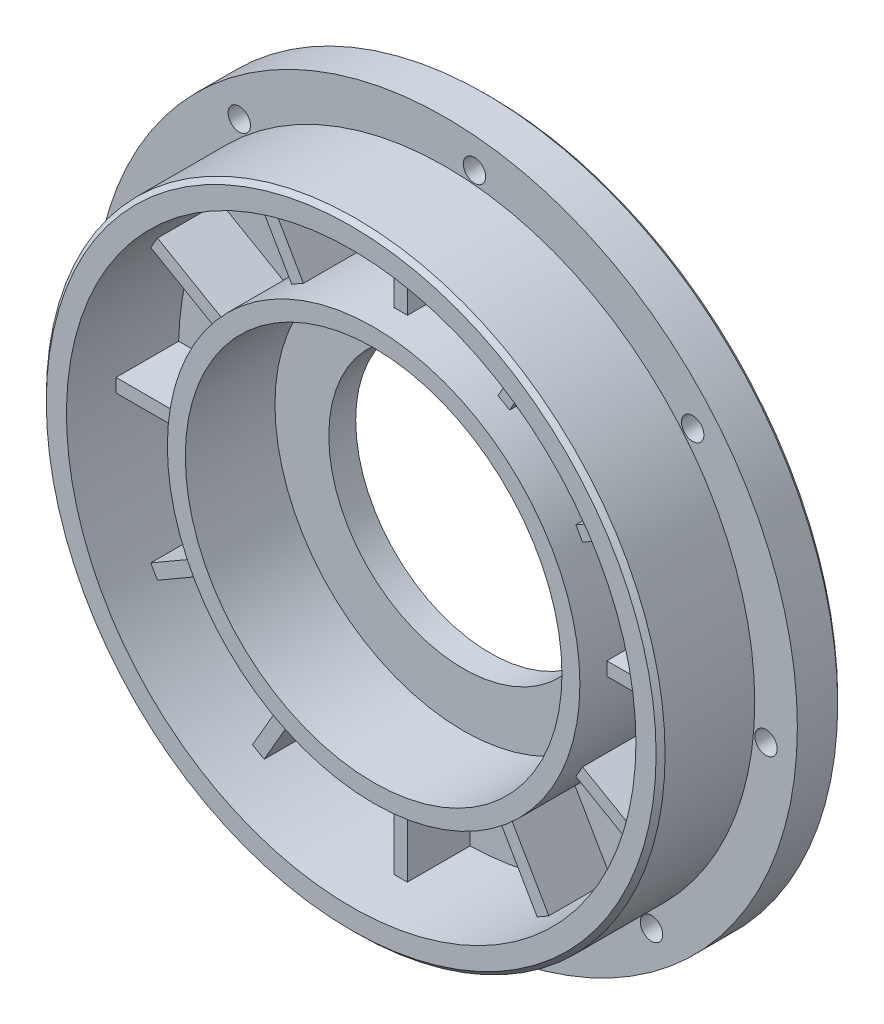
ISO-10303-21;
HEADER;
FILE_DESCRIPTION(('STEP AP214'),'2;1');
FILE_NAME('part.step','',(''),(''),'','','');
FILE_SCHEMA(('AUTOMOTIVE_DESIGN { 1 0 10303 214 1 1 1 1 }'));
ENDSEC;
DATA;
#1=APPLICATION_CONTEXT('core data for automotive mechanical design processes');
#2=APPLICATION_PROTOCOL_DEFINITION('international standard','automotive_design',2000,#1);
#3=PRODUCT_CONTEXT('',#1,'mechanical');
#4=PRODUCT('Part','Part','',(#3));
#5=PRODUCT_RELATED_PRODUCT_CATEGORY('part','',(#4));
#6=PRODUCT_DEFINITION_FORMATION('','',#4);
#7=PRODUCT_DEFINITION_CONTEXT('part definition',#1,'design');
#8=PRODUCT_DEFINITION('design','',#6,#7);
#9=PRODUCT_DEFINITION_SHAPE('','',#8);
#10=(LENGTH_UNIT() NAMED_UNIT(*) SI_UNIT(.MILLI.,.METRE.));
#11=(NAMED_UNIT(*) PLANE_ANGLE_UNIT() SI_UNIT($,.RADIAN.));
#12=(NAMED_UNIT(*) SI_UNIT($,.STERADIAN.) SOLID_ANGLE_UNIT());
#13=UNCERTAINTY_MEASURE_WITH_UNIT(LENGTH_MEASURE(1.E-05),#10,'distance_accuracy_value','');
#14=(GEOMETRIC_REPRESENTATION_CONTEXT(3) GLOBAL_UNCERTAINTY_ASSIGNED_CONTEXT((#13)) GLOBAL_UNIT_ASSIGNED_CONTEXT((#10,
#11,#12)) REPRESENTATION_CONTEXT('',''));
#15=CARTESIAN_POINT('',(0.,0.,0.));
#16=DIRECTION('',(0.,0.,1.));
#17=DIRECTION('',(1.,0.,0.));
#18=AXIS2_PLACEMENT_3D('',#15,#16,#17);
#19=CARTESIAN_POINT('',(0.,0.,0.5));
#20=DIRECTION('',(0.,0.,-1.));
#21=DIRECTION('',(-1.,0.,0.));
#22=AXIS2_PLACEMENT_3D('',#19,#20,#21);
#23=PLANE('',#22);
#24=DIRECTION('',(-0.741384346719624,-0.671080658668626,0.));
#25=VECTOR('',#24,1.);
#26=CARTESIAN_POINT('',(20.8498884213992,21.5703999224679,0.5));
#27=LINE('',#26,#25);
#28=CARTESIAN_POINT('',(20.8498884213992,21.5703999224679,0.5));
#29=VERTEX_POINT('',#28);
#30=CARTESIAN_POINT('',(17.5049020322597,18.5426105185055,0.5));
#31=VERTEX_POINT('',#30);
#32=EDGE_CURVE('E499',#29,#31,#27,.T.);
#33=ORIENTED_EDGE('',*,*,#32,.F.);
#34=CARTESIAN_POINT('',(0.,0.,0.5));
#35=DIRECTION('',(0.,0.,-1.));
#36=DIRECTION('',(-1.,0.,0.));
#37=AXIS2_PLACEMENT_3D('',#34,#35,#36);
#38=CIRCLE('',#37,30.);
#39=CARTESIAN_POINT('',(8.79123947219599,28.6829933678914,0.5));
#40=VERTEX_POINT('',#39);
#41=EDGE_CURVE('E470',#40,#29,#38,.T.);
#42=ORIENTED_EDGE('',*,*,#41,.F.);
#43=DIRECTION('',(0.0497122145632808,0.998763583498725,0.));
#44=VECTOR('',#43,1.);
#45=CARTESIAN_POINT('',(8.79123947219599,28.6829933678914,0.5));
#46=LINE('',#45,#44);
#47=CARTESIAN_POINT('',(8.55917597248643,24.0206266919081,0.5));
#48=VERTEX_POINT('',#47);
#49=EDGE_CURVE('E503',#48,#40,#46,.T.);
#50=ORIENTED_EDGE('',*,*,#49,.F.);
#51=CARTESIAN_POINT('',(0.,0.,0.5));
#52=DIRECTION('',(0.,0.,1.));
#53=DIRECTION('',(-1.,0.,0.));
#54=AXIS2_PLACEMENT_3D('',#51,#52,#53);
#55=CIRCLE('',#54,25.5);
#56=EDGE_CURVE('E501',#31,#48,#55,.T.);
#57=ORIENTED_EDGE('',*,*,#56,.F.);
#58=EDGE_LOOP('',(#33,#42,#50,#57));
#59=FACE_BOUND('',#58,.T.);
#60=CARTESIAN_POINT('',(0.,0.,0.5));
#61=DIRECTION('',(0.,0.,-1.));
#62=DIRECTION('',(-1.,0.,0.));
#63=AXIS2_PLACEMENT_3D('',#60,#61,#62);
#64=CIRCLE('',#63,19.5);
#65=CARTESIAN_POINT('',(-19.5,0.,0.499999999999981));
#66=VERTEX_POINT('',#65);
#67=EDGE_CURVE('E526',#66,#66,#64,.T.);
#68=ORIENTED_EDGE('',*,*,#67,.F.);
#69=EDGE_LOOP('',(#68));
#70=FACE_BOUND('',#69,.T.);
#71=CARTESIAN_POINT('',(0.,0.,0.5));
#72=DIRECTION('',(0.,0.,-1.));
#73=DIRECTION('',(-1.,0.,0.));
#74=AXIS2_PLACEMENT_3D('',#71,#72,#73);
#75=CIRCLE('',#74,31.);
#76=CARTESIAN_POINT('',(-16.4965072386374,26.2462425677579,0.5));
#77=VERTEX_POINT('',#76);
#78=CARTESIAN_POINT('',(22.9829147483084,20.8035004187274,0.5));
#79=VERTEX_POINT('',#78);
#80=EDGE_CURVE('E540',#77,#79,#75,.T.);
#81=ORIENTED_EDGE('',*,*,#80,.T.);
#82=DIRECTION('',(-0.741384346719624,-0.671080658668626,0.));
#83=VECTOR('',#82,1.);
#84=CARTESIAN_POINT('',(17.793224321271,16.105935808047,0.5));
#85=LINE('',#84,#83);
#86=CARTESIAN_POINT('',(17.793224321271,16.105935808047,0.5));
#87=VERTEX_POINT('',#86);
#88=EDGE_CURVE('E543',#79,#87,#85,.T.);
#89=ORIENTED_EDGE('',*,*,#88,.T.);
#90=CARTESIAN_POINT('',(0.,0.,0.5));
#91=DIRECTION('',(0.,0.,-1.));
#92=DIRECTION('',(-1.,0.,0.));
#93=AXIS2_PLACEMENT_3D('',#90,#91,#92);
#94=CIRCLE('',#93,24.);
#95=CARTESIAN_POINT('',(-12.7714894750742,20.3196716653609,0.5));
#96=VERTEX_POINT('',#95);
#97=EDGE_CURVE('E546',#87,#96,#94,.T.);
#98=ORIENTED_EDGE('',*,*,#97,.T.);
#99=DIRECTION('',(-0.532145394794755,0.846652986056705,0.));
#100=VECTOR('',#99,1.);
#101=CARTESIAN_POINT('',(-12.7714894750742,20.3196716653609,0.5));
#102=LINE('',#101,#100);
#103=EDGE_CURVE('E549',#96,#77,#102,.T.);
#104=ORIENTED_EDGE('',*,*,#103,.T.);
#105=EDGE_LOOP('',(#81,#89,#98,#104));
#106=FACE_BOUND('',#105,.T.);
#107=DIRECTION('',(0.0497122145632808,0.998763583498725,0.));
#108=VECTOR('',#107,1.);
#109=CARTESIAN_POINT('',(8.50716108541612,22.9756003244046,0.5));
#110=LINE('',#109,#108);
#111=CARTESIAN_POINT('',(8.29664225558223,18.7460856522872,0.5));
#112=VERTEX_POINT('',#111);
#113=CARTESIAN_POINT('',(8.50716108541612,22.9756003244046,0.5));
#114=VERTEX_POINT('',#113);
#115=EDGE_CURVE('E480',#112,#114,#110,.T.);
#116=ORIENTED_EDGE('',*,*,#115,.F.);
#117=CARTESIAN_POINT('',(0.,0.,0.5));
#118=DIRECTION('',(0.,0.,1.));
#119=DIRECTION('',(-1.,0.,0.));
#120=AXIS2_PLACEMENT_3D('',#117,#118,#119);
#121=CIRCLE('',#120,20.5);
#122=CARTESIAN_POINT('',(13.7837146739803,15.1742943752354,0.5));
#123=VERTEX_POINT('',#122);
#124=EDGE_CURVE('E481',#123,#112,#121,.T.);
#125=ORIENTED_EDGE('',*,*,#124,.F.);
#126=DIRECTION('',(-0.741384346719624,-0.671080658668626,0.));
#127=VECTOR('',#126,1.);
#128=CARTESIAN_POINT('',(16.7611328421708,17.8693711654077,0.5));
#129=LINE('',#128,#127);
#130=CARTESIAN_POINT('',(16.7611328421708,17.8693711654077,0.5));
#131=VERTEX_POINT('',#130);
#132=EDGE_CURVE('E476',#131,#123,#129,.T.);
#133=ORIENTED_EDGE('',*,*,#132,.F.);
#134=CARTESIAN_POINT('',(0.,0.,0.5));
#135=DIRECTION('',(0.,0.,-1.));
#136=DIRECTION('',(-1.,0.,0.));
#137=AXIS2_PLACEMENT_3D('',#134,#135,#136);
#138=CIRCLE('',#137,24.5);
#139=EDGE_CURVE('E493',#114,#131,#138,.T.);
#140=ORIENTED_EDGE('',*,*,#139,.F.);
#141=EDGE_LOOP('',(#116,#125,#133,#140));
#142=FACE_BOUND('',#141,.T.);
#143=ADVANCED_FACE('F36',(#59,#70,#106,#142),#23,.T.);
#144=CARTESIAN_POINT('',(0.,0.,0.));
#145=DIRECTION('',(0.,0.,1.));
#146=DIRECTION('',(1.,0.,0.));
#147=AXIS2_PLACEMENT_3D('',#144,#145,#146);
#148=PLANE('',#147);
#149=CARTESIAN_POINT('',(0.,0.,0.));
#150=DIRECTION('',(0.,0.,1.));
#151=DIRECTION('',(1.,0.,0.));
#152=AXIS2_PLACEMENT_3D('',#149,#150,#151);
#153=CIRCLE('',#152,15.);
#154=CARTESIAN_POINT('',(15.,0.,0.));
#155=VERTEX_POINT('',#154);
#156=EDGE_CURVE('E959',#155,#155,#153,.T.);
#157=ORIENTED_EDGE('',*,*,#156,.T.);
#158=EDGE_LOOP('',(#157));
#159=FACE_BOUND('',#158,.T.);
#160=CARTESIAN_POINT('',(0.,0.,0.));
#161=DIRECTION('',(0.,0.,-1.));
#162=DIRECTION('',(-1.,0.,0.));
#163=AXIS2_PLACEMENT_3D('',#160,#161,#162);
#164=CIRCLE('',#163,19.5);
#165=CARTESIAN_POINT('',(-19.5,0.,0.));
#166=VERTEX_POINT('',#165);
#167=EDGE_CURVE('E523',#166,#166,#164,.T.);
#168=ORIENTED_EDGE('',*,*,#167,.T.);
#169=EDGE_LOOP('',(#168));
#170=FACE_BOUND('',#169,.T.);
#171=ADVANCED_FACE('F1183',(#159,#170),#148,.F.);
#172=CARTESIAN_POINT('',(0.,0.,3.));
#173=DIRECTION('',(0.,0.,1.));
#174=DIRECTION('',(1.,0.,0.));
#175=AXIS2_PLACEMENT_3D('',#172,#173,#174);
#176=PLANE('',#175);
#177=CARTESIAN_POINT('',(0.,0.,3.));
#178=DIRECTION('',(0.,0.,1.));
#179=DIRECTION('',(1.,0.,0.));
#180=AXIS2_PLACEMENT_3D('',#177,#178,#179);
#181=CIRCLE('',#180,23.);
#182=CARTESIAN_POINT('',(10.8443651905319,20.2829914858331,3.));
#183=VERTEX_POINT('',#182);
#184=CARTESIAN_POINT('',(0.749999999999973,22.9877684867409,3.));
#185=VERTEX_POINT('',#184);
#186=EDGE_CURVE('E982',#183,#185,#181,.T.);
#187=ORIENTED_EDGE('',*,*,#186,.F.);
#188=DIRECTION('',(0.499999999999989,0.866025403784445,0.));
#189=VECTOR('',#188,1.);
#190=CARTESIAN_POINT('',(-0.649519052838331,0.374999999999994,3.));
#191=LINE('',#190,#189);
#192=CARTESIAN_POINT('',(15.2210511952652,27.8636340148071,3.));
#193=VERTEX_POINT('',#192);
#194=EDGE_CURVE('E658',#183,#193,#191,.T.);
#195=ORIENTED_EDGE('',*,*,#194,.T.);
#196=CARTESIAN_POINT('',(0.,0.,3.));
#197=DIRECTION('',(0.,0.,1.));
#198=DIRECTION('',(1.,0.,0.));
#199=AXIS2_PLACEMENT_3D('',#196,#197,#198);
#200=CIRCLE('',#199,31.75);
#201=CARTESIAN_POINT('',(0.749999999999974,31.7411404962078,3.));
#202=VERTEX_POINT('',#201);
#203=EDGE_CURVE('E950',#193,#202,#200,.T.);
#204=ORIENTED_EDGE('',*,*,#203,.T.);
#205=DIRECTION('',(0.,1.,0.));
#206=VECTOR('',#205,1.);
#207=CARTESIAN_POINT('',(0.750000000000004,0.,3.));
#208=LINE('',#207,#206);
#209=EDGE_CURVE('E930',#185,#202,#208,.T.);
#210=ORIENTED_EDGE('',*,*,#209,.F.);
#211=EDGE_LOOP('',(#187,#195,#204,#210));
#212=FACE_BOUND('',#211,.T.);
#213=ADVANCED_FACE('F1171',(#212),#176,.T.);
#214=DIRECTION('',(0.499999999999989,0.866025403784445,0.));
#215=VECTOR('',#214,1.);
#216=CARTESIAN_POINT('',(0.64951905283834,-0.374999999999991,3.));
#217=LINE('',#216,#215);
#218=CARTESIAN_POINT('',(12.1434032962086,19.5329914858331,3.));
#219=VERTEX_POINT('',#218);
#220=CARTESIAN_POINT('',(16.5200893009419,27.1136340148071,3.));
#221=VERTEX_POINT('',#220);
#222=EDGE_CURVE('E647',#219,#221,#217,.T.);
#223=ORIENTED_EDGE('',*,*,#222,.F.);
#224=CARTESIAN_POINT('',(19.5329914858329,12.143403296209,3.));
#225=VERTEX_POINT('',#224);
#226=EDGE_CURVE('E1510',#225,#219,#181,.T.);
#227=ORIENTED_EDGE('',*,*,#226,.F.);
#228=DIRECTION('',(0.866025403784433,0.50000000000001,0.));
#229=VECTOR('',#228,1.);
#230=CARTESIAN_POINT('',(-0.375000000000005,0.649519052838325,3.));
#231=LINE('',#230,#229);
#232=CARTESIAN_POINT('',(27.1136340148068,16.5200893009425,3.));
#233=VERTEX_POINT('',#232);
#234=EDGE_CURVE('E683',#225,#233,#231,.T.);
#235=ORIENTED_EDGE('',*,*,#234,.T.);
#236=EDGE_CURVE('E1441',#233,#221,#200,.T.);
#237=ORIENTED_EDGE('',*,*,#236,.T.);
#238=EDGE_LOOP('',(#223,#227,#235,#237));
#239=FACE_BOUND('',#238,.T.);
#240=ADVANCED_FACE('F1445',(#239),#176,.T.);
#241=DIRECTION('',(0.866025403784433,0.50000000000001,0.));
#242=VECTOR('',#241,1.);
#243=CARTESIAN_POINT('',(0.375000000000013,-0.649519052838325,3.));
#244=LINE('',#243,#242);
#245=CARTESIAN_POINT('',(20.2829914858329,10.8443651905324,3.));
#246=VERTEX_POINT('',#245);
#247=CARTESIAN_POINT('',(27.8636340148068,15.2210511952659,3.00000000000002));
#248=VERTEX_POINT('',#247);
#249=EDGE_CURVE('E672',#246,#248,#244,.T.);
#250=ORIENTED_EDGE('',*,*,#249,.F.);
#251=CARTESIAN_POINT('',(22.987768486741,0.750000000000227,3.));
#252=VERTEX_POINT('',#251);
#253=EDGE_CURVE('E1506',#252,#246,#181,.T.);
#254=ORIENTED_EDGE('',*,*,#253,.F.);
#255=DIRECTION('',(1.,0.,0.));
#256=VECTOR('',#255,1.);
#257=CARTESIAN_POINT('',(0.,0.750000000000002,3.));
#258=LINE('',#257,#256);
#259=CARTESIAN_POINT('',(31.7411404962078,0.750000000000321,3.00000000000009));
#260=VERTEX_POINT('',#259);
#261=EDGE_CURVE('E708',#252,#260,#258,.T.);
#262=ORIENTED_EDGE('',*,*,#261,.T.);
#263=EDGE_CURVE('E1448',#260,#248,#200,.T.);
#264=ORIENTED_EDGE('',*,*,#263,.T.);
#265=EDGE_LOOP('',(#250,#254,#262,#264));
#266=FACE_BOUND('',#265,.T.);
#267=ADVANCED_FACE('F1523',(#266),#176,.T.);
#268=DIRECTION('',(1.,0.,0.));
#269=VECTOR('',#268,1.);
#270=CARTESIAN_POINT('',(0.,-0.749999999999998,3.));
#271=LINE('',#270,#269);
#272=CARTESIAN_POINT('',(22.987768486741,-0.749999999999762,3.));
#273=VERTEX_POINT('',#272);
#274=CARTESIAN_POINT('',(31.7411404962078,-0.749999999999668,3.00000000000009));
#275=VERTEX_POINT('',#274);
#276=EDGE_CURVE('E697',#273,#275,#271,.T.);
#277=ORIENTED_EDGE('',*,*,#276,.F.);
#278=CARTESIAN_POINT('',(20.2829914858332,-10.844365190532,3.));
#279=VERTEX_POINT('',#278);
#280=EDGE_CURVE('E1502',#279,#273,#181,.T.);
#281=ORIENTED_EDGE('',*,*,#280,.F.);
#282=DIRECTION('',(0.866025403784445,-0.499999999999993,0.));
#283=VECTOR('',#282,1.);
#284=CARTESIAN_POINT('',(0.374999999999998,0.649519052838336,3.));
#285=LINE('',#284,#283);
#286=CARTESIAN_POINT('',(27.8636340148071,-15.2210511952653,3.00000000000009));
#287=VERTEX_POINT('',#286);
#288=EDGE_CURVE('E723',#279,#287,#285,.T.);
#289=ORIENTED_EDGE('',*,*,#288,.T.);
#290=EDGE_CURVE('E1450',#287,#275,#200,.T.);
#291=ORIENTED_EDGE('',*,*,#290,.T.);
#292=EDGE_LOOP('',(#277,#281,#289,#291));
#293=FACE_BOUND('',#292,.T.);
#294=ADVANCED_FACE('F1533',(#293),#176,.T.);
#295=DIRECTION('',(0.866025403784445,-0.499999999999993,0.));
#296=VECTOR('',#295,1.);
#297=CARTESIAN_POINT('',(-0.374999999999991,-0.649519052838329,3.));
#298=LINE('',#297,#296);
#299=CARTESIAN_POINT('',(19.5329914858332,-12.1434032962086,3.));
#300=VERTEX_POINT('',#299);
#301=CARTESIAN_POINT('',(27.1136340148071,-16.520089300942,3.00000000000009));
#302=VERTEX_POINT('',#301);
#303=EDGE_CURVE('E731',#300,#302,#298,.T.);
#304=ORIENTED_EDGE('',*,*,#303,.F.);
#305=CARTESIAN_POINT('',(12.143403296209,-19.5329914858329,3.));
#306=VERTEX_POINT('',#305);
#307=EDGE_CURVE('E1498',#306,#300,#181,.T.);
#308=ORIENTED_EDGE('',*,*,#307,.F.);
#309=DIRECTION('',(0.500000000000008,-0.866025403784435,0.));
#310=VECTOR('',#309,1.);
#311=CARTESIAN_POINT('',(0.649519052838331,0.375000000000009,3.));
#312=LINE('',#311,#310);
#313=CARTESIAN_POINT('',(16.5200893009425,-27.1136340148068,3.));
#314=VERTEX_POINT('',#313);
#315=EDGE_CURVE('E748',#306,#314,#312,.T.);
#316=ORIENTED_EDGE('',*,*,#315,.T.);
#317=EDGE_CURVE('E1534',#314,#302,#200,.T.);
#318=ORIENTED_EDGE('',*,*,#317,.T.);
#319=EDGE_LOOP('',(#304,#308,#316,#318));
#320=FACE_BOUND('',#319,.T.);
#321=ADVANCED_FACE('F1599',(#320),#176,.T.);
#322=DIRECTION('',(0.500000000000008,-0.866025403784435,0.));
#323=VECTOR('',#322,1.);
#324=CARTESIAN_POINT('',(-0.649519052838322,-0.375000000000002,3.));
#325=LINE('',#324,#323);
#326=CARTESIAN_POINT('',(10.8443651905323,-20.282991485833,3.));
#327=VERTEX_POINT('',#326);
#328=CARTESIAN_POINT('',(15.2210511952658,-27.8636340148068,3.));
#329=VERTEX_POINT('',#328);
#330=EDGE_CURVE('E756',#327,#329,#325,.T.);
#331=ORIENTED_EDGE('',*,*,#330,.F.);
#332=CARTESIAN_POINT('',(0.750000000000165,-22.9877684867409,3.));
#333=VERTEX_POINT('',#332);
#334=EDGE_CURVE('E1494',#333,#327,#181,.T.);
#335=ORIENTED_EDGE('',*,*,#334,.F.);
#336=DIRECTION('',(0.,-1.,0.));
#337=VECTOR('',#336,1.);
#338=CARTESIAN_POINT('',(0.750000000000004,0.,3.));
#339=LINE('',#338,#337);
#340=CARTESIAN_POINT('',(0.750000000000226,-31.7411404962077,3.));
#341=VERTEX_POINT('',#340);
#342=EDGE_CURVE('E773',#333,#341,#339,.T.);
#343=ORIENTED_EDGE('',*,*,#342,.T.);
#344=EDGE_CURVE('E1536',#341,#329,#200,.T.);
#345=ORIENTED_EDGE('',*,*,#344,.T.);
#346=EDGE_LOOP('',(#331,#335,#343,#345));
#347=FACE_BOUND('',#346,.T.);
#348=ADVANCED_FACE('F1593',(#347),#176,.T.);
#349=DIRECTION('',(0.,-1.,0.));
#350=VECTOR('',#349,1.);
#351=CARTESIAN_POINT('',(-0.749999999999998,0.,3.));
#352=LINE('',#351,#350);
#353=CARTESIAN_POINT('',(-0.749999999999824,-22.987768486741,3.));
#354=VERTEX_POINT('',#353);
#355=CARTESIAN_POINT('',(-0.749999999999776,-31.7411404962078,3.));
#356=VERTEX_POINT('',#355);
#357=EDGE_CURVE('E781',#354,#356,#352,.T.);
#358=ORIENTED_EDGE('',*,*,#357,.F.);
#359=CARTESIAN_POINT('',(-10.844365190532,-20.2829914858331,3.));
#360=VERTEX_POINT('',#359);
#361=EDGE_CURVE('E1490',#360,#354,#181,.T.);
#362=ORIENTED_EDGE('',*,*,#361,.F.);
#363=DIRECTION('',(-0.499999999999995,-0.866025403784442,0.));
#364=VECTOR('',#363,1.);
#365=CARTESIAN_POINT('',(0.649519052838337,-0.374999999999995,3.));
#366=LINE('',#365,#364);
#367=CARTESIAN_POINT('',(-15.2210511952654,-27.863634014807,3.));
#368=VERTEX_POINT('',#367);
#369=EDGE_CURVE('E796',#360,#368,#366,.T.);
#370=ORIENTED_EDGE('',*,*,#369,.T.);
#371=EDGE_CURVE('E1541',#368,#356,#200,.T.);
#372=ORIENTED_EDGE('',*,*,#371,.T.);
#373=EDGE_LOOP('',(#358,#362,#370,#372));
#374=FACE_BOUND('',#373,.T.);
#375=ADVANCED_FACE('F1587',(#374),#176,.T.);
#376=DIRECTION('',(-0.499999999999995,-0.866025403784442,0.));
#377=VECTOR('',#376,1.);
#378=CARTESIAN_POINT('',(-0.649519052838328,0.374999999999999,3.));
#379=LINE('',#378,#377);
#380=CARTESIAN_POINT('',(-12.1434032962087,-19.5329914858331,3.));
#381=VERTEX_POINT('',#380);
#382=CARTESIAN_POINT('',(-16.520089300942,-27.113634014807,3.));
#383=VERTEX_POINT('',#382);
#384=EDGE_CURVE('E805',#381,#383,#379,.T.);
#385=ORIENTED_EDGE('',*,*,#384,.F.);
#386=CARTESIAN_POINT('',(-19.532991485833,-12.1434032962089,2.99999999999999));
#387=VERTEX_POINT('',#386);
#388=EDGE_CURVE('E1486',#387,#381,#181,.T.);
#389=ORIENTED_EDGE('',*,*,#388,.F.);
#390=DIRECTION('',(-0.866025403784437,-0.500000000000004,0.));
#391=VECTOR('',#390,1.);
#392=CARTESIAN_POINT('',(0.375000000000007,-0.649519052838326,3.));
#393=LINE('',#392,#391);
#394=CARTESIAN_POINT('',(-27.1136340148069,-16.5200893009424,2.99999999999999));
#395=VERTEX_POINT('',#394);
#396=EDGE_CURVE('E821',#387,#395,#393,.T.);
#397=ORIENTED_EDGE('',*,*,#396,.T.);
#398=EDGE_CURVE('E1546',#395,#383,#200,.T.);
#399=ORIENTED_EDGE('',*,*,#398,.T.);
#400=EDGE_LOOP('',(#385,#389,#397,#399));
#401=FACE_BOUND('',#400,.T.);
#402=ADVANCED_FACE('F1581',(#401),#176,.T.);
#403=DIRECTION('',(-0.866025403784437,-0.500000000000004,0.));
#404=VECTOR('',#403,1.);
#405=CARTESIAN_POINT('',(-0.375000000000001,0.64951905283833,3.));
#406=LINE('',#405,#404);
#407=CARTESIAN_POINT('',(-20.282991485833,-10.8443651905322,2.99999999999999));
#408=VERTEX_POINT('',#407);
#409=CARTESIAN_POINT('',(-27.8636340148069,-15.2210511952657,2.99999999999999));
#410=VERTEX_POINT('',#409);
#411=EDGE_CURVE('E830',#408,#410,#406,.T.);
#412=ORIENTED_EDGE('',*,*,#411,.F.);
#413=CARTESIAN_POINT('',(-22.9877684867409,-0.750000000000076,2.99999999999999));
#414=VERTEX_POINT('',#413);
#415=EDGE_CURVE('E1482',#414,#408,#181,.T.);
#416=ORIENTED_EDGE('',*,*,#415,.F.);
#417=DIRECTION('',(-1.,0.,0.));
#418=VECTOR('',#417,1.);
#419=CARTESIAN_POINT('',(0.,-0.749999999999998,3.));
#420=LINE('',#419,#418);
#421=CARTESIAN_POINT('',(-31.7411404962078,-0.750000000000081,2.99999999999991));
#422=VERTEX_POINT('',#421);
#423=EDGE_CURVE('E846',#414,#422,#420,.T.);
#424=ORIENTED_EDGE('',*,*,#423,.T.);
#425=EDGE_CURVE('E1551',#422,#410,#200,.T.);
#426=ORIENTED_EDGE('',*,*,#425,.T.);
#427=EDGE_LOOP('',(#412,#416,#424,#426));
#428=FACE_BOUND('',#427,.T.);
#429=ADVANCED_FACE('F1575',(#428),#176,.T.);
#430=DIRECTION('',(-1.,0.,0.));
#431=VECTOR('',#430,1.);
#432=CARTESIAN_POINT('',(0.,0.750000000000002,3.));
#433=LINE('',#432,#431);
#434=CARTESIAN_POINT('',(-22.987768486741,0.749999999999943,2.99999999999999));
#435=VERTEX_POINT('',#434);
#436=CARTESIAN_POINT('',(-31.7411404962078,0.749999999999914,2.99999999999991));
#437=VERTEX_POINT('',#436);
#438=EDGE_CURVE('E855',#435,#437,#433,.T.);
#439=ORIENTED_EDGE('',*,*,#438,.F.);
#440=CARTESIAN_POINT('',(-20.2829914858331,10.8443651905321,2.99999999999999));
#441=VERTEX_POINT('',#440);
#442=EDGE_CURVE('E1480',#441,#435,#181,.T.);
#443=ORIENTED_EDGE('',*,*,#442,.F.);
#444=DIRECTION('',(-0.866025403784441,0.499999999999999,0.));
#445=VECTOR('',#444,1.);
#446=CARTESIAN_POINT('',(-0.374999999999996,-0.649519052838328,3.));
#447=LINE('',#446,#445);
#448=CARTESIAN_POINT('',(-27.863634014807,15.2210511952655,2.99999999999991));
#449=VERTEX_POINT('',#448);
#450=EDGE_CURVE('E871',#441,#449,#447,.T.);
#451=ORIENTED_EDGE('',*,*,#450,.T.);
#452=EDGE_CURVE('E1556',#449,#437,#200,.T.);
#453=ORIENTED_EDGE('',*,*,#452,.T.);
#454=EDGE_LOOP('',(#439,#443,#451,#453));
#455=FACE_BOUND('',#454,.T.);
#456=ADVANCED_FACE('F1569',(#455),#176,.T.);
#457=DIRECTION('',(-0.866025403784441,0.499999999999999,0.));
#458=VECTOR('',#457,1.);
#459=CARTESIAN_POINT('',(0.375000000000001,0.649519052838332,3.));
#460=LINE('',#459,#458);
#461=CARTESIAN_POINT('',(-19.5329914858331,12.1434032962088,2.99999999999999));
#462=VERTEX_POINT('',#461);
#463=CARTESIAN_POINT('',(-27.113634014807,16.5200893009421,2.99999999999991));
#464=VERTEX_POINT('',#463);
#465=EDGE_CURVE('E880',#462,#464,#460,.T.);
#466=ORIENTED_EDGE('',*,*,#465,.F.);
#467=CARTESIAN_POINT('',(-12.1434032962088,19.532991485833,3.));
#468=VERTEX_POINT('',#467);
#469=EDGE_CURVE('E989',#468,#462,#181,.T.);
#470=ORIENTED_EDGE('',*,*,#469,.F.);
#471=DIRECTION('',(-0.500000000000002,0.866025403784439,0.));
#472=VECTOR('',#471,1.);
#473=CARTESIAN_POINT('',(-0.649519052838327,-0.374999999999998,3.));
#474=LINE('',#473,#472);
#475=CARTESIAN_POINT('',(-16.5200893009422,27.1136340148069,2.99999999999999));
#476=VERTEX_POINT('',#475);
#477=EDGE_CURVE('E896',#468,#476,#474,.T.);
#478=ORIENTED_EDGE('',*,*,#477,.T.);
#479=EDGE_CURVE('E955',#476,#464,#200,.T.);
#480=ORIENTED_EDGE('',*,*,#479,.T.);
#481=EDGE_LOOP('',(#466,#470,#478,#480));
#482=FACE_BOUND('',#481,.T.);
#483=ADVANCED_FACE('F1478',(#482),#176,.T.);
#484=CARTESIAN_POINT('',(0.,0.,3.));
#485=DIRECTION('',(0.,0.,1.));
#486=DIRECTION('',(1.,0.,0.));
#487=AXIS2_PLACEMENT_3D('',#484,#485,#486);
#488=CIRCLE('',#487,15.);
#489=CARTESIAN_POINT('',(15.,0.,3.00000000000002));
#490=VERTEX_POINT('',#489);
#491=EDGE_CURVE('E954',#490,#490,#488,.T.);
#492=ORIENTED_EDGE('',*,*,#491,.F.);
#493=EDGE_LOOP('',(#492));
#494=FACE_BOUND('',#493,.T.);
#495=CARTESIAN_POINT('',(0.,0.,3.));
#496=DIRECTION('',(0.,0.,1.));
#497=DIRECTION('',(1.,0.,0.));
#498=AXIS2_PLACEMENT_3D('',#495,#496,#497);
#499=CIRCLE('',#498,21.);
#500=CARTESIAN_POINT('',(21.,0.,3.00000000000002));
#501=VERTEX_POINT('',#500);
#502=EDGE_CURVE('E947',#501,#501,#499,.T.);
#503=ORIENTED_EDGE('',*,*,#502,.T.);
#504=EDGE_LOOP('',(#503));
#505=FACE_BOUND('',#504,.T.);
#506=ADVANCED_FACE('F1172',(#494,#505),#176,.T.);
#507=CARTESIAN_POINT('',(0.,0.,5.));
#508=DIRECTION('',(0.,0.,-1.));
#509=DIRECTION('',(-1.,0.,0.));
#510=AXIS2_PLACEMENT_3D('',#507,#508,#509);
#511=CYLINDRICAL_SURFACE('',#510,15.);
#512=ORIENTED_EDGE('',*,*,#156,.F.);
#513=EDGE_LOOP('',(#512));
#514=FACE_BOUND('',#513,.T.);
#515=ORIENTED_EDGE('',*,*,#491,.T.);
#516=EDGE_LOOP('',(#515));
#517=FACE_BOUND('',#516,.T.);
#518=ADVANCED_FACE('F1392',(#514,#517),#511,.F.);
#519=CARTESIAN_POINT('',(0.,0.,5.));
#520=DIRECTION('',(0.,0.,1.));
#521=DIRECTION('',(1.,0.,0.));
#522=AXIS2_PLACEMENT_3D('',#519,#520,#521);
#523=PLANE('',#522);
#524=CARTESIAN_POINT('',(27.5759093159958,22.9822255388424,5.));
#525=DIRECTION('',(0.,0.,1.));
#526=DIRECTION('',(1.,0.,0.));
#527=AXIS2_PLACEMENT_3D('',#524,#525,#526);
#528=CIRCLE('',#527,1.25);
#529=CARTESIAN_POINT('',(28.8259093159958,22.9822255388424,5.00000000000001));
#530=VERTEX_POINT('',#529);
#531=EDGE_CURVE('E40',#530,#530,#528,.T.);
#532=ORIENTED_EDGE('',*,*,#531,.F.);
#533=EDGE_LOOP('',(#532));
#534=FACE_BOUND('',#533,.T.);
#535=CARTESIAN_POINT('',(35.75,-3.24822494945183,5.00000000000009));
#536=DIRECTION('',(0.,0.,1.));
#537=DIRECTION('',(1.,0.,0.));
#538=AXIS2_PLACEMENT_3D('',#535,#536,#537);
#539=CIRCLE('',#538,1.25);
#540=CARTESIAN_POINT('',(37.,-3.24822494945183,5.00000000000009));
#541=VERTEX_POINT('',#540);
#542=EDGE_CURVE('E578',#541,#541,#539,.T.);
#543=ORIENTED_EDGE('',*,*,#542,.F.);
#544=EDGE_LOOP('',(#543));
#545=FACE_BOUND('',#544,.T.);
#546=CARTESIAN_POINT('',(22.9822255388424,-27.5759093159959,5.00000000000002));
#547=DIRECTION('',(0.,0.,1.));
#548=DIRECTION('',(1.,0.,0.));
#549=AXIS2_PLACEMENT_3D('',#546,#547,#548);
#550=CIRCLE('',#549,1.25);
#551=CARTESIAN_POINT('',(24.2322255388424,-27.5759093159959,5.00000000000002));
#552=VERTEX_POINT('',#551);
#553=EDGE_CURVE('E588',#552,#552,#550,.T.);
#554=ORIENTED_EDGE('',*,*,#553,.F.);
#555=EDGE_LOOP('',(#554));
#556=FACE_BOUND('',#555,.T.);
#557=CARTESIAN_POINT('',(-3.24822494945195,-35.75,5.));
#558=DIRECTION('',(0.,0.,1.));
#559=DIRECTION('',(1.,0.,0.));
#560=AXIS2_PLACEMENT_3D('',#557,#558,#559);
#561=CIRCLE('',#560,1.25);
#562=CARTESIAN_POINT('',(-1.99822494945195,-35.75,5.00000000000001));
#563=VERTEX_POINT('',#562);
#564=EDGE_CURVE('E598',#563,#563,#561,.T.);
#565=ORIENTED_EDGE('',*,*,#564,.F.);
#566=EDGE_LOOP('',(#565));
#567=FACE_BOUND('',#566,.T.);
#568=CARTESIAN_POINT('',(-27.5759093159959,-22.9822255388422,4.99999999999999));
#569=DIRECTION('',(0.,0.,1.));
#570=DIRECTION('',(1.,0.,0.));
#571=AXIS2_PLACEMENT_3D('',#568,#569,#570);
#572=CIRCLE('',#571,1.25);
#573=CARTESIAN_POINT('',(-26.3259093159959,-22.9822255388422,4.99999999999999));
#574=VERTEX_POINT('',#573);
#575=EDGE_CURVE('E608',#574,#574,#572,.T.);
#576=ORIENTED_EDGE('',*,*,#575,.F.);
#577=EDGE_LOOP('',(#576));
#578=FACE_BOUND('',#577,.T.);
#579=CARTESIAN_POINT('',(-35.7500000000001,3.24822494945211,4.99999999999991));
#580=DIRECTION('',(0.,0.,1.));
#581=DIRECTION('',(1.,0.,0.));
#582=AXIS2_PLACEMENT_3D('',#579,#580,#581);
#583=CIRCLE('',#582,1.25);
#584=CARTESIAN_POINT('',(-34.5000000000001,3.24822494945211,4.99999999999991));
#585=VERTEX_POINT('',#584);
#586=EDGE_CURVE('E618',#585,#585,#583,.T.);
#587=ORIENTED_EDGE('',*,*,#586,.F.);
#588=EDGE_LOOP('',(#587));
#589=FACE_BOUND('',#588,.T.);
#590=CARTESIAN_POINT('',(-22.9822255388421,27.575909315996,4.99999999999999));
#591=DIRECTION('',(0.,0.,1.));
#592=DIRECTION('',(1.,0.,0.));
#593=AXIS2_PLACEMENT_3D('',#590,#591,#592);
#594=CIRCLE('',#593,1.25);
#595=CARTESIAN_POINT('',(-21.7322255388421,27.575909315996,4.99999999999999));
#596=VERTEX_POINT('',#595);
#597=EDGE_CURVE('E628',#596,#596,#594,.T.);
#598=ORIENTED_EDGE('',*,*,#597,.F.);
#599=EDGE_LOOP('',(#598));
#600=FACE_BOUND('',#599,.T.);
#601=CARTESIAN_POINT('',(3.24822494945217,35.75,5.));
#602=DIRECTION('',(0.,0.,1.));
#603=DIRECTION('',(1.,0.,0.));
#604=AXIS2_PLACEMENT_3D('',#601,#602,#603);
#605=CIRCLE('',#604,1.25);
#606=CARTESIAN_POINT('',(4.49822494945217,35.75,5.00000000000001));
#607=VERTEX_POINT('',#606);
#608=EDGE_CURVE('E638',#607,#607,#605,.T.);
#609=ORIENTED_EDGE('',*,*,#608,.F.);
#610=EDGE_LOOP('',(#609));
#611=FACE_BOUND('',#610,.T.);
#612=CARTESIAN_POINT('',(0.,0.,5.));
#613=DIRECTION('',(0.,0.,1.));
#614=DIRECTION('',(1.,0.,0.));
#615=AXIS2_PLACEMENT_3D('',#612,#613,#614);
#616=CIRCLE('',#615,34.5);
#617=CARTESIAN_POINT('',(-34.5,0.,5.00000000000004));
#618=VERTEX_POINT('',#617);
#619=EDGE_CURVE('E960',#618,#618,#616,.T.);
#620=ORIENTED_EDGE('',*,*,#619,.F.);
#621=EDGE_LOOP('',(#620));
#622=FACE_BOUND('',#621,.T.);
#623=CARTESIAN_POINT('',(0.,0.,5.));
#624=DIRECTION('',(0.,0.,1.));
#625=DIRECTION('',(1.,0.,0.));
#626=AXIS2_PLACEMENT_3D('',#623,#624,#625);
#627=CIRCLE('',#626,39.25);
#628=CARTESIAN_POINT('',(39.25,0.,5.00000000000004));
#629=VERTEX_POINT('',#628);
#630=EDGE_CURVE('E964',#629,#629,#627,.T.);
#631=ORIENTED_EDGE('',*,*,#630,.T.);
#632=EDGE_LOOP('',(#631));
#633=FACE_BOUND('',#632,.T.);
#634=ADVANCED_FACE('F1389',(#534,#545,#556,#567,#578,#589,#600,#611,#622,#633),#523,.T.);
#635=DIRECTION('',(-0.741384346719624,-0.671080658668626,0.));
#636=VECTOR('',#635,1.);
#637=CARTESIAN_POINT('',(17.793224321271,16.105935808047,0.));
#638=LINE('',#637,#636);
#639=CARTESIAN_POINT('',(22.9829147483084,20.8035004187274,0.));
#640=VERTEX_POINT('',#639);
#641=CARTESIAN_POINT('',(17.793224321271,16.105935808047,0.));
#642=VERTEX_POINT('',#641);
#643=EDGE_CURVE('E531',#640,#642,#638,.T.);
#644=ORIENTED_EDGE('',*,*,#643,.F.);
#645=CARTESIAN_POINT('',(0.,0.,0.));
#646=DIRECTION('',(0.,0.,-1.));
#647=DIRECTION('',(-1.,0.,0.));
#648=AXIS2_PLACEMENT_3D('',#645,#646,#647);
#649=CIRCLE('',#648,31.);
#650=CARTESIAN_POINT('',(-16.4965072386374,26.2462425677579,0.));
#651=VERTEX_POINT('',#650);
#652=EDGE_CURVE('E529',#651,#640,#649,.T.);
#653=ORIENTED_EDGE('',*,*,#652,.F.);
#654=DIRECTION('',(-0.532145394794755,0.846652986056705,0.));
#655=VECTOR('',#654,1.);
#656=CARTESIAN_POINT('',(-12.7714894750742,20.3196716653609,0.));
#657=LINE('',#656,#655);
#658=CARTESIAN_POINT('',(-12.7714894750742,20.3196716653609,0.));
#659=VERTEX_POINT('',#658);
#660=EDGE_CURVE('E537',#659,#651,#657,.T.);
#661=ORIENTED_EDGE('',*,*,#660,.F.);
#662=CARTESIAN_POINT('',(0.,0.,0.));
#663=DIRECTION('',(0.,0.,-1.));
#664=DIRECTION('',(-1.,0.,0.));
#665=AXIS2_PLACEMENT_3D('',#662,#663,#664);
#666=CIRCLE('',#665,24.);
#667=EDGE_CURVE('E534',#642,#659,#666,.T.);
#668=ORIENTED_EDGE('',*,*,#667,.F.);
#669=EDGE_LOOP('',(#644,#653,#661,#668));
#670=FACE_BOUND('',#669,.T.);
#671=CARTESIAN_POINT('',(0.,0.,0.));
#672=DIRECTION('',(0.,0.,1.));
#673=DIRECTION('',(1.,0.,0.));
#674=AXIS2_PLACEMENT_3D('',#671,#672,#673);
#675=CIRCLE('',#674,38.75);
#676=CARTESIAN_POINT('',(4.46580598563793,38.4918053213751,0.));
#677=VERTEX_POINT('',#676);
#678=CARTESIAN_POINT('',(29.1406434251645,25.5418362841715,0.));
#679=VERTEX_POINT('',#678);
#680=EDGE_CURVE('E972',#677,#679,#675,.F.);
#681=ORIENTED_EDGE('',*,*,#680,.T.);
#682=CARTESIAN_POINT('',(27.5759093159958,22.9822255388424,0.));
#683=DIRECTION('',(0.,0.,-1.));
#684=DIRECTION('',(-1.,0.,0.));
#685=AXIS2_PLACEMENT_3D('',#682,#683,#684);
#686=CIRCLE('',#685,3.);
#687=CARTESIAN_POINT('',(30.3756182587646,24.060014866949,0.));
#688=VERTEX_POINT('',#687);
#689=EDGE_CURVE('E567',#688,#679,#686,.T.);
#690=ORIENTED_EDGE('',*,*,#689,.F.);
#691=CARTESIAN_POINT('',(38.6663522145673,-2.54474093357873,0.));
#692=VERTEX_POINT('',#691);
#693=EDGE_CURVE('E976',#688,#692,#675,.F.);
#694=ORIENTED_EDGE('',*,*,#693,.T.);
#695=CARTESIAN_POINT('',(35.75,-3.24822494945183,0.));
#696=DIRECTION('',(0.,0.,-1.));
#697=DIRECTION('',(-1.,0.,0.));
#698=AXIS2_PLACEMENT_3D('',#695,#696,#697);
#699=CIRCLE('',#698,3.);
#700=CARTESIAN_POINT('',(38.4918053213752,-4.46580598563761,0.));
#701=VERTEX_POINT('',#700);
#702=EDGE_CURVE('E575',#701,#692,#699,.T.);
#703=ORIENTED_EDGE('',*,*,#702,.F.);
#704=CARTESIAN_POINT('',(25.5418362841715,-29.1406434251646,0.));
#705=VERTEX_POINT('',#704);
#706=EDGE_CURVE('E1359',#701,#705,#675,.F.);
#707=ORIENTED_EDGE('',*,*,#706,.T.);
#708=CARTESIAN_POINT('',(22.9822255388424,-27.5759093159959,0.));
#709=DIRECTION('',(0.,0.,-1.));
#710=DIRECTION('',(-1.,0.,0.));
#711=AXIS2_PLACEMENT_3D('',#708,#709,#710);
#712=CIRCLE('',#711,3.);
#713=CARTESIAN_POINT('',(24.060014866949,-30.3756182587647,0.));
#714=VERTEX_POINT('',#713);
#715=EDGE_CURVE('E585',#714,#705,#712,.T.);
#716=ORIENTED_EDGE('',*,*,#715,.F.);
#717=CARTESIAN_POINT('',(-2.54474093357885,-38.6663522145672,0.));
#718=VERTEX_POINT('',#717);
#719=EDGE_CURVE('E1356',#714,#718,#675,.F.);
#720=ORIENTED_EDGE('',*,*,#719,.T.);
#721=CARTESIAN_POINT('',(-3.24822494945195,-35.75,0.));
#722=DIRECTION('',(0.,0.,-1.));
#723=DIRECTION('',(-1.,0.,0.));
#724=AXIS2_PLACEMENT_3D('',#721,#722,#723);
#725=CIRCLE('',#724,3.);
#726=CARTESIAN_POINT('',(-4.46580598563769,-38.4918053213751,0.));
#727=VERTEX_POINT('',#726);
#728=EDGE_CURVE('E595',#727,#718,#725,.T.);
#729=ORIENTED_EDGE('',*,*,#728,.F.);
#730=CARTESIAN_POINT('',(-29.1406434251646,-25.5418362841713,0.));
#731=VERTEX_POINT('',#730);
#732=EDGE_CURVE('E1353',#727,#731,#675,.F.);
#733=ORIENTED_EDGE('',*,*,#732,.T.);
#734=CARTESIAN_POINT('',(-27.5759093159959,-22.9822255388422,0.));
#735=DIRECTION('',(0.,0.,-1.));
#736=DIRECTION('',(-1.,0.,0.));
#737=AXIS2_PLACEMENT_3D('',#734,#735,#736);
#738=CIRCLE('',#737,3.);
#739=CARTESIAN_POINT('',(-30.3756182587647,-24.0600148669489,0.));
#740=VERTEX_POINT('',#739);
#741=EDGE_CURVE('E605',#740,#731,#738,.T.);
#742=ORIENTED_EDGE('',*,*,#741,.F.);
#743=CARTESIAN_POINT('',(-38.6663522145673,2.54474093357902,0.));
#744=VERTEX_POINT('',#743);
#745=EDGE_CURVE('E1352',#740,#744,#675,.F.);
#746=ORIENTED_EDGE('',*,*,#745,.T.);
#747=CARTESIAN_POINT('',(-35.7500000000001,3.2482249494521,0.));
#748=DIRECTION('',(0.,0.,-1.));
#749=DIRECTION('',(-1.,0.,0.));
#750=AXIS2_PLACEMENT_3D('',#747,#748,#749);
#751=CIRCLE('',#750,3.);
#752=CARTESIAN_POINT('',(-38.4918053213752,4.46580598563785,0.));
#753=VERTEX_POINT('',#752);
#754=EDGE_CURVE('E615',#753,#744,#751,.T.);
#755=ORIENTED_EDGE('',*,*,#754,.F.);
#756=CARTESIAN_POINT('',(-25.5418362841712,29.1406434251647,0.));
#757=VERTEX_POINT('',#756);
#758=EDGE_CURVE('E1347',#753,#757,#675,.F.);
#759=ORIENTED_EDGE('',*,*,#758,.T.);
#760=CARTESIAN_POINT('',(-22.9822255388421,27.575909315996,0.));
#761=DIRECTION('',(0.,0.,-1.));
#762=DIRECTION('',(-1.,0.,0.));
#763=AXIS2_PLACEMENT_3D('',#760,#761,#762);
#764=CIRCLE('',#763,3.);
#765=CARTESIAN_POINT('',(-24.0600148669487,30.3756182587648,0.));
#766=VERTEX_POINT('',#765);
#767=EDGE_CURVE('E625',#766,#757,#764,.T.);
#768=ORIENTED_EDGE('',*,*,#767,.F.);
#769=CARTESIAN_POINT('',(2.5447409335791,38.6663522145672,0.));
#770=VERTEX_POINT('',#769);
#771=EDGE_CURVE('E971',#766,#770,#675,.F.);
#772=ORIENTED_EDGE('',*,*,#771,.T.);
#773=CARTESIAN_POINT('',(3.24822494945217,35.75,0.));
#774=DIRECTION('',(0.,0.,-1.));
#775=DIRECTION('',(-1.,0.,0.));
#776=AXIS2_PLACEMENT_3D('',#773,#774,#775);
#777=CIRCLE('',#776,3.);
#778=EDGE_CURVE('E635',#677,#770,#777,.T.);
#779=ORIENTED_EDGE('',*,*,#778,.F.);
#780=EDGE_LOOP('',(#681,#690,#694,#703,#707,#716,#720,#729,#733,#742,#746,#755,#759,#768,#772,#779));
#781=FACE_BOUND('',#780,.T.);
#782=ADVANCED_FACE('F1191',(#670,#781),#148,.F.);
#783=CARTESIAN_POINT('',(0.,0.,5.));
#784=DIRECTION('',(0.,0.,-1.));
#785=DIRECTION('',(-1.,0.,0.));
#786=AXIS2_PLACEMENT_3D('',#783,#784,#785);
#787=CYLINDRICAL_SURFACE('',#786,39.25);
#788=CARTESIAN_POINT('',(0.,0.,0.500000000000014));
#789=DIRECTION('',(0.,0.,1.));
#790=DIRECTION('',(1.,0.,0.));
#791=AXIS2_PLACEMENT_3D('',#788,#789,#790);
#792=CIRCLE('',#791,39.25);
#793=CARTESIAN_POINT('',(39.25,0.,0.500000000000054));
#794=VERTEX_POINT('',#793);
#795=EDGE_CURVE('E963',#794,#794,#792,.T.);
#796=ORIENTED_EDGE('',*,*,#795,.T.);
#797=EDGE_LOOP('',(#796));
#798=FACE_BOUND('',#797,.T.);
#799=ORIENTED_EDGE('',*,*,#630,.F.);
#800=EDGE_LOOP('',(#799));
#801=FACE_BOUND('',#800,.T.);
#802=ADVANCED_FACE('F38',(#798,#801),#787,.T.);
#803=CARTESIAN_POINT('',(0.,0.,15.5));
#804=DIRECTION('',(0.,0.,1.));
#805=DIRECTION('',(1.,0.,0.));
#806=AXIS2_PLACEMENT_3D('',#803,#804,#805);
#807=PLANE('',#806);
#808=CARTESIAN_POINT('',(0.,0.,15.5));
#809=DIRECTION('',(0.,0.,1.));
#810=DIRECTION('',(1.,0.,0.));
#811=AXIS2_PLACEMENT_3D('',#808,#809,#810);
#812=CIRCLE('',#811,34.);
#813=CARTESIAN_POINT('',(34.,0.,15.5));
#814=VERTEX_POINT('',#813);
#815=EDGE_CURVE('E975',#814,#814,#812,.T.);
#816=ORIENTED_EDGE('',*,*,#815,.T.);
#817=EDGE_LOOP('',(#816));
#818=FACE_BOUND('',#817,.T.);
#819=CARTESIAN_POINT('',(0.,0.,15.5));
#820=DIRECTION('',(0.,0.,1.));
#821=DIRECTION('',(1.,0.,0.));
#822=AXIS2_PLACEMENT_3D('',#819,#820,#821);
#823=CIRCLE('',#822,31.75);
#824=CARTESIAN_POINT('',(31.75,0.,15.5));
#825=VERTEX_POINT('',#824);
#826=EDGE_CURVE('E956',#825,#825,#823,.T.);
#827=ORIENTED_EDGE('',*,*,#826,.F.);
#828=EDGE_LOOP('',(#827));
#829=FACE_BOUND('',#828,.T.);
#830=ADVANCED_FACE('F1410',(#818,#829),#807,.T.);
#831=CARTESIAN_POINT('',(0.,0.,15.5));
#832=DIRECTION('',(0.,0.,-1.));
#833=DIRECTION('',(-1.,0.,0.));
#834=AXIS2_PLACEMENT_3D('',#831,#832,#833);
#835=CYLINDRICAL_SURFACE('',#834,34.5);
#836=CARTESIAN_POINT('',(0.,0.,15.));
#837=DIRECTION('',(0.,0.,1.));
#838=DIRECTION('',(1.,0.,0.));
#839=AXIS2_PLACEMENT_3D('',#836,#837,#838);
#840=CIRCLE('',#839,34.5);
#841=CARTESIAN_POINT('',(-34.5,0.,15.));
#842=VERTEX_POINT('',#841);
#843=EDGE_CURVE('E979',#842,#842,#840,.F.);
#844=CARTESIAN_POINT('',(-34.5,0.,5.00000000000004));
#845=CARTESIAN_POINT('',(-34.5,0.,5.1041666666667));
#846=CARTESIAN_POINT('',(-34.5,0.,5.20833333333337));
#847=CARTESIAN_POINT('',(-34.5,0.,5.4166666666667));
#848=CARTESIAN_POINT('',(-34.5,0.,5.52083333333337));
#849=CARTESIAN_POINT('',(-34.5,0.,5.7291666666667));
#850=CARTESIAN_POINT('',(-34.5,0.,5.83333333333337));
#851=CARTESIAN_POINT('',(-34.5,0.,6.0416666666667));
#852=CARTESIAN_POINT('',(-34.5,0.,6.14583333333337));
#853=CARTESIAN_POINT('',(-34.5,0.,6.3541666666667));
#854=CARTESIAN_POINT('',(-34.5,0.,6.45833333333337));
#855=CARTESIAN_POINT('',(-34.5,0.,6.6666666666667));
#856=CARTESIAN_POINT('',(-34.5,0.,6.77083333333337));
#857=CARTESIAN_POINT('',(-34.5,0.,6.9791666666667));
#858=CARTESIAN_POINT('',(-34.5,0.,7.08333333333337));
#859=CARTESIAN_POINT('',(-34.5,0.,7.2916666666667));
#860=CARTESIAN_POINT('',(-34.5,0.,7.39583333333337));
#861=CARTESIAN_POINT('',(-34.5,0.,7.6041666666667));
#862=CARTESIAN_POINT('',(-34.5,0.,7.70833333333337));
#863=CARTESIAN_POINT('',(-34.5,0.,7.9166666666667));
#864=CARTESIAN_POINT('',(-34.5,0.,8.02083333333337));
#865=CARTESIAN_POINT('',(-34.5,0.,8.2291666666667));
#866=CARTESIAN_POINT('',(-34.5,0.,8.33333333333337));
#867=CARTESIAN_POINT('',(-34.5,0.,8.5416666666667));
#868=CARTESIAN_POINT('',(-34.5,0.,8.64583333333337));
#869=CARTESIAN_POINT('',(-34.5,0.,8.8541666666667));
#870=CARTESIAN_POINT('',(-34.5,0.,8.95833333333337));
#871=CARTESIAN_POINT('',(-34.5,0.,9.1666666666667));
#872=CARTESIAN_POINT('',(-34.5,0.,9.27083333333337));
#873=CARTESIAN_POINT('',(-34.5,0.,9.4791666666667));
#874=CARTESIAN_POINT('',(-34.5,0.,9.58333333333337));
#875=CARTESIAN_POINT('',(-34.5,0.,9.7916666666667));
#876=CARTESIAN_POINT('',(-34.5,0.,9.89583333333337));
#877=CARTESIAN_POINT('',(-34.5,0.,10.1041666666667));
#878=CARTESIAN_POINT('',(-34.5,0.,10.2083333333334));
#879=CARTESIAN_POINT('',(-34.5,0.,10.4166666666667));
#880=CARTESIAN_POINT('',(-34.5,0.,10.5208333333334));
#881=CARTESIAN_POINT('',(-34.5,0.,10.7291666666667));
#882=CARTESIAN_POINT('',(-34.5,0.,10.8333333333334));
#883=CARTESIAN_POINT('',(-34.5,0.,11.0416666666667));
#884=CARTESIAN_POINT('',(-34.5,0.,11.1458333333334));
#885=CARTESIAN_POINT('',(-34.5,0.,11.3541666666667));
#886=CARTESIAN_POINT('',(-34.5,0.,11.4583333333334));
#887=CARTESIAN_POINT('',(-34.5,0.,11.6666666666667));
#888=CARTESIAN_POINT('',(-34.5,0.,11.7708333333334));
#889=CARTESIAN_POINT('',(-34.5,0.,11.9791666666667));
#890=CARTESIAN_POINT('',(-34.5,0.,12.0833333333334));
#891=CARTESIAN_POINT('',(-34.5,0.,12.2916666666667));
#892=CARTESIAN_POINT('',(-34.5,0.,12.3958333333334));
#893=CARTESIAN_POINT('',(-34.5,0.,12.6041666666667));
#894=CARTESIAN_POINT('',(-34.5,0.,12.7083333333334));
#895=CARTESIAN_POINT('',(-34.5,0.,12.9166666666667));
#896=CARTESIAN_POINT('',(-34.5,0.,13.0208333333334));
#897=CARTESIAN_POINT('',(-34.5,0.,13.2291666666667));
#898=CARTESIAN_POINT('',(-34.5,0.,13.3333333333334));
#899=CARTESIAN_POINT('',(-34.5,0.,13.5416666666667));
#900=CARTESIAN_POINT('',(-34.5,0.,13.6458333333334));
#901=CARTESIAN_POINT('',(-34.5,0.,13.8541666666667));
#902=CARTESIAN_POINT('',(-34.5,0.,13.9583333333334));
#903=CARTESIAN_POINT('',(-34.5,0.,14.1666666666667));
#904=CARTESIAN_POINT('',(-34.5,0.,14.2708333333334));
#905=CARTESIAN_POINT('',(-34.5,0.,14.4791666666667));
#906=CARTESIAN_POINT('',(-34.5,0.,14.5833333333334));
#907=CARTESIAN_POINT('',(-34.5,0.,14.7916666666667));
#908=CARTESIAN_POINT('',(-34.5,0.,14.8958333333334));
#909=CARTESIAN_POINT('',(-34.5,0.,15.));
#910=B_SPLINE_CURVE_WITH_KNOTS('',3,(#844,#845,#846,#847,#848,#849,#850,#851,#852,#853,#854,
#855,#856,#857,#858,#859,#860,#861,#862,#863,#864,#865,#866,#867,#868,#869,#870,#871,#872,#873,
#874,#875,#876,#877,#878,#879,#880,#881,#882,#883,#884,#885,#886,#887,#888,#889,#890,#891,#892,
#893,#894,#895,#896,#897,#898,#899,#900,#901,#902,#903,#904,#905,#906,#907,#908,#909),
.UNSPECIFIED.,.F.,.F.,(4,2,2,2,2,2,2,2,2,2,2,2,2,2,2,2,2,2,2,2,2,2,2,2,2,2,2,2,2,2,2,2,4),(0.,
0.3125,0.625000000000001,0.937499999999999,1.25,1.5625,1.875,2.1875,2.5,2.8125,3.125,3.4375,
3.75,4.0625,4.375,4.6875,5.,5.3125,5.625,5.9375,6.25,6.5625,6.875,7.1875,7.5,7.8125,
8.12499999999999,8.43749999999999,8.75,9.0625,9.37499999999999,9.68749999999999,
9.99999999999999),.UNSPECIFIED.);
#911=EDGE_CURVE('BSEAM1416',#618,#842,#910,.T.);
#912=ORIENTED_EDGE('',*,*,#619,.T.);
#913=ORIENTED_EDGE('',*,*,#843,.T.);
#914=ORIENTED_EDGE('',*,*,#911,.T.);
#915=ORIENTED_EDGE('',*,*,#911,.F.);
#916=EDGE_LOOP('',(#912,#914,#913,#915));
#917=FACE_BOUND('',#916,.T.);
#918=ADVANCED_FACE('F1416',(#917),#835,.T.);
#919=CARTESIAN_POINT('',(0.,0.,15.5));
#920=DIRECTION('',(0.,0.,-1.));
#921=DIRECTION('',(-1.,0.,0.));
#922=AXIS2_PLACEMENT_3D('',#919,#920,#921);
#923=CYLINDRICAL_SURFACE('',#922,31.75);
#924=DIRECTION('',(0.,0.,-1.));
#925=VECTOR('',#924,1.);
#926=CARTESIAN_POINT('',(16.5200893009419,27.1136340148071,15.5));
#927=LINE('',#926,#925);
#928=CARTESIAN_POINT('',(16.5200893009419,27.1136340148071,9.98315465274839));
#929=VERTEX_POINT('',#928);
#930=EDGE_CURVE('E649',#221,#929,#927,.F.);
#931=ORIENTED_EDGE('',*,*,#930,.F.);
#932=ORIENTED_EDGE('',*,*,#236,.F.);
#933=DIRECTION('',(0.,0.,-1.));
#934=VECTOR('',#933,1.);
#935=CARTESIAN_POINT('',(27.1136340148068,16.5200893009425,15.5));
#936=LINE('',#935,#934);
#937=CARTESIAN_POINT('',(27.1136340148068,16.5200893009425,9.98315465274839));
#938=VERTEX_POINT('',#937);
#939=EDGE_CURVE('E686',#233,#938,#936,.F.);
#940=ORIENTED_EDGE('',*,*,#939,.T.);
#941=CARTESIAN_POINT('',(0.,0.,9.98315465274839));
#942=DIRECTION('',(0.,0.,1.));
#943=DIRECTION('',(1.,0.,0.));
#944=AXIS2_PLACEMENT_3D('',#941,#942,#943);
#945=CIRCLE('',#944,31.75);
#946=CARTESIAN_POINT('',(27.8636340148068,15.2210511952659,9.98315465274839));
#947=VERTEX_POINT('',#946);
#948=EDGE_CURVE('E678',#947,#938,#945,.T.);
#949=ORIENTED_EDGE('',*,*,#948,.F.);
#950=DIRECTION('',(0.,0.,-1.));
#951=VECTOR('',#950,1.);
#952=CARTESIAN_POINT('',(27.8636340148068,15.2210511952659,15.5));
#953=LINE('',#952,#951);
#954=EDGE_CURVE('E674',#248,#947,#953,.F.);
#955=ORIENTED_EDGE('',*,*,#954,.F.);
#956=ORIENTED_EDGE('',*,*,#263,.F.);
#957=DIRECTION('',(0.,0.,-1.));
#958=VECTOR('',#957,1.);
#959=CARTESIAN_POINT('',(31.7411404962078,0.750000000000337,15.5));
#960=LINE('',#959,#958);
#961=CARTESIAN_POINT('',(31.7411404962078,0.750000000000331,9.98315465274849));
#962=VERTEX_POINT('',#961);
#963=EDGE_CURVE('E711',#260,#962,#960,.F.);
#964=ORIENTED_EDGE('',*,*,#963,.T.);
#965=CARTESIAN_POINT('',(0.,0.,9.98315465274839));
#966=DIRECTION('',(0.,0.,1.));
#967=DIRECTION('',(1.,0.,0.));
#968=AXIS2_PLACEMENT_3D('',#965,#966,#967);
#969=CIRCLE('',#968,31.75);
#970=CARTESIAN_POINT('',(31.7411404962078,-0.74999999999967,9.98315465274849));
#971=VERTEX_POINT('',#970);
#972=EDGE_CURVE('E703',#971,#962,#969,.T.);
#973=ORIENTED_EDGE('',*,*,#972,.F.);
#974=DIRECTION('',(0.,0.,-1.));
#975=VECTOR('',#974,1.);
#976=CARTESIAN_POINT('',(31.7411404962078,-0.749999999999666,15.5));
#977=LINE('',#976,#975);
#978=EDGE_CURVE('E699',#275,#971,#977,.F.);
#979=ORIENTED_EDGE('',*,*,#978,.F.);
#980=ORIENTED_EDGE('',*,*,#290,.F.);
#981=DIRECTION('',(0.,0.,-1.));
#982=VECTOR('',#981,1.);
#983=CARTESIAN_POINT('',(27.8636340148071,-15.2210511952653,15.5));
#984=LINE('',#983,#982);
#985=CARTESIAN_POINT('',(27.8636340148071,-15.2210511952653,9.98315465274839));
#986=VERTEX_POINT('',#985);
#987=EDGE_CURVE('E726',#287,#986,#984,.F.);
#988=ORIENTED_EDGE('',*,*,#987,.T.);
#989=CARTESIAN_POINT('',(0.,0.,9.98315465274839));
#990=DIRECTION('',(0.,0.,1.));
#991=DIRECTION('',(1.,0.,0.));
#992=AXIS2_PLACEMENT_3D('',#989,#990,#991);
#993=CIRCLE('',#992,31.75);
#994=CARTESIAN_POINT('',(27.1136340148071,-16.520089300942,9.98315465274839));
#995=VERTEX_POINT('',#994);
#996=EDGE_CURVE('E737',#995,#986,#993,.T.);
#997=ORIENTED_EDGE('',*,*,#996,.F.);
#998=DIRECTION('',(0.,0.,-1.));
#999=VECTOR('',#998,1.);
#1000=CARTESIAN_POINT('',(27.1136340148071,-16.520089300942,15.5));
#1001=LINE('',#1000,#999);
#1002=EDGE_CURVE('E733',#302,#995,#1001,.F.);
#1003=ORIENTED_EDGE('',*,*,#1002,.F.);
#1004=ORIENTED_EDGE('',*,*,#317,.F.);
#1005=DIRECTION('',(0.,0.,-1.));
#1006=VECTOR('',#1005,1.);
#1007=CARTESIAN_POINT('',(16.5200893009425,-27.1136340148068,15.5));
#1008=LINE('',#1007,#1006);
#1009=CARTESIAN_POINT('',(16.5200893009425,-27.1136340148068,9.98315465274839));
#1010=VERTEX_POINT('',#1009);
#1011=EDGE_CURVE('E751',#314,#1010,#1008,.F.);
#1012=ORIENTED_EDGE('',*,*,#1011,.T.);
#1013=CARTESIAN_POINT('',(0.,0.,9.98315465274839));
#1014=DIRECTION('',(0.,0.,1.));
#1015=DIRECTION('',(1.,0.,0.));
#1016=AXIS2_PLACEMENT_3D('',#1013,#1014,#1015);
#1017=CIRCLE('',#1016,31.75);
#1018=CARTESIAN_POINT('',(15.2210511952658,-27.8636340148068,9.98315465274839));
#1019=VERTEX_POINT('',#1018);
#1020=EDGE_CURVE('E762',#1019,#1010,#1017,.T.);
#1021=ORIENTED_EDGE('',*,*,#1020,.F.);
#1022=DIRECTION('',(0.,0.,-1.));
#1023=VECTOR('',#1022,1.);
#1024=CARTESIAN_POINT('',(15.2210511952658,-27.8636340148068,15.5));
#1025=LINE('',#1024,#1023);
#1026=EDGE_CURVE('E758',#329,#1019,#1025,.F.);
#1027=ORIENTED_EDGE('',*,*,#1026,.F.);
#1028=ORIENTED_EDGE('',*,*,#344,.F.);
#1029=DIRECTION('',(0.,0.,-1.));
#1030=VECTOR('',#1029,1.);
#1031=CARTESIAN_POINT('',(0.750000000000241,-31.7411404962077,15.5));
#1032=LINE('',#1031,#1030);
#1033=CARTESIAN_POINT('',(0.750000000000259,-31.7411404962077,9.98315465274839));
#1034=VERTEX_POINT('',#1033);
#1035=EDGE_CURVE('E776',#341,#1034,#1032,.F.);
#1036=ORIENTED_EDGE('',*,*,#1035,.T.);
#1037=CARTESIAN_POINT('',(0.,0.,9.98315465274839));
#1038=DIRECTION('',(0.,0.,1.));
#1039=DIRECTION('',(1.,0.,0.));
#1040=AXIS2_PLACEMENT_3D('',#1037,#1038,#1039);
#1041=CIRCLE('',#1040,31.75);
#1042=CARTESIAN_POINT('',(-0.749999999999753,-31.7411404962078,9.98315465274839));
#1043=VERTEX_POINT('',#1042);
#1044=EDGE_CURVE('E787',#1043,#1034,#1041,.T.);
#1045=ORIENTED_EDGE('',*,*,#1044,.F.);
#1046=DIRECTION('',(0.,0.,-1.));
#1047=VECTOR('',#1046,1.);
#1048=CARTESIAN_POINT('',(-0.749999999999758,-31.7411404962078,15.5));
#1049=LINE('',#1048,#1047);
#1050=EDGE_CURVE('E783',#356,#1043,#1049,.F.);
#1051=ORIENTED_EDGE('',*,*,#1050,.F.);
#1052=ORIENTED_EDGE('',*,*,#371,.F.);
#1053=DIRECTION('',(0.,0.,-1.));
#1054=VECTOR('',#1053,1.);
#1055=CARTESIAN_POINT('',(-15.2210511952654,-27.863634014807,15.5));
#1056=LINE('',#1055,#1054);
#1057=CARTESIAN_POINT('',(-15.2210511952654,-27.863634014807,9.98315465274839));
#1058=VERTEX_POINT('',#1057);
#1059=EDGE_CURVE('E799',#368,#1058,#1056,.F.);
#1060=ORIENTED_EDGE('',*,*,#1059,.T.);
#1061=CARTESIAN_POINT('',(0.,0.,9.98315465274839));
#1062=DIRECTION('',(0.,0.,1.));
#1063=DIRECTION('',(1.,0.,0.));
#1064=AXIS2_PLACEMENT_3D('',#1061,#1062,#1063);
#1065=CIRCLE('',#1064,31.75);
#1066=CARTESIAN_POINT('',(-16.520089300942,-27.113634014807,9.98315465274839));
#1067=VERTEX_POINT('',#1066);
#1068=EDGE_CURVE('E812',#1067,#1058,#1065,.T.);
#1069=ORIENTED_EDGE('',*,*,#1068,.F.);
#1070=DIRECTION('',(0.,0.,-1.));
#1071=VECTOR('',#1070,1.);
#1072=CARTESIAN_POINT('',(-16.520089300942,-27.113634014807,15.5));
#1073=LINE('',#1072,#1071);
#1074=EDGE_CURVE('E807',#383,#1067,#1073,.F.);
#1075=ORIENTED_EDGE('',*,*,#1074,.F.);
#1076=ORIENTED_EDGE('',*,*,#398,.F.);
#1077=DIRECTION('',(0.,0.,-1.));
#1078=VECTOR('',#1077,1.);
#1079=CARTESIAN_POINT('',(-27.1136340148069,-16.5200893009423,15.5));
#1080=LINE('',#1079,#1078);
#1081=CARTESIAN_POINT('',(-27.1136340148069,-16.5200893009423,9.98315465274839));
#1082=VERTEX_POINT('',#1081);
#1083=EDGE_CURVE('E824',#395,#1082,#1080,.F.);
#1084=ORIENTED_EDGE('',*,*,#1083,.T.);
#1085=CARTESIAN_POINT('',(0.,0.,9.98315465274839));
#1086=DIRECTION('',(0.,0.,1.));
#1087=DIRECTION('',(1.,0.,0.));
#1088=AXIS2_PLACEMENT_3D('',#1085,#1086,#1087);
#1089=CIRCLE('',#1088,31.75);
#1090=CARTESIAN_POINT('',(-27.8636340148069,-15.2210511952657,9.98315465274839));
#1091=VERTEX_POINT('',#1090);
#1092=EDGE_CURVE('E837',#1091,#1082,#1089,.T.);
#1093=ORIENTED_EDGE('',*,*,#1092,.F.);
#1094=DIRECTION('',(0.,0.,-1.));
#1095=VECTOR('',#1094,1.);
#1096=CARTESIAN_POINT('',(-27.8636340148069,-15.2210511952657,15.5));
#1097=LINE('',#1096,#1095);
#1098=EDGE_CURVE('E832',#410,#1091,#1097,.F.);
#1099=ORIENTED_EDGE('',*,*,#1098,.F.);
#1100=ORIENTED_EDGE('',*,*,#425,.F.);
#1101=DIRECTION('',(0.,0.,-1.));
#1102=VECTOR('',#1101,1.);
#1103=CARTESIAN_POINT('',(-31.7411404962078,-0.750000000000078,15.5));
#1104=LINE('',#1103,#1102);
#1105=CARTESIAN_POINT('',(-31.7411404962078,-0.750000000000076,9.98315465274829));
#1106=VERTEX_POINT('',#1105);
#1107=EDGE_CURVE('E849',#422,#1106,#1104,.F.);
#1108=ORIENTED_EDGE('',*,*,#1107,.T.);
#1109=CARTESIAN_POINT('',(0.,0.,9.98315465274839));
#1110=DIRECTION('',(0.,0.,1.));
#1111=DIRECTION('',(1.,0.,0.));
#1112=AXIS2_PLACEMENT_3D('',#1109,#1110,#1111);
#1113=CIRCLE('',#1112,31.75);
#1114=CARTESIAN_POINT('',(-31.7411404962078,0.749999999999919,9.98315465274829));
#1115=VERTEX_POINT('',#1114);
#1116=EDGE_CURVE('E862',#1115,#1106,#1113,.T.);
#1117=ORIENTED_EDGE('',*,*,#1116,.F.);
#1118=DIRECTION('',(0.,0.,-1.));
#1119=VECTOR('',#1118,1.);
#1120=CARTESIAN_POINT('',(-31.7411404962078,0.749999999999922,15.5));
#1121=LINE('',#1120,#1119);
#1122=EDGE_CURVE('E857',#437,#1115,#1121,.F.);
#1123=ORIENTED_EDGE('',*,*,#1122,.F.);
#1124=ORIENTED_EDGE('',*,*,#452,.F.);
#1125=DIRECTION('',(0.,0.,-1.));
#1126=VECTOR('',#1125,1.);
#1127=CARTESIAN_POINT('',(-27.863634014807,15.2210511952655,15.5));
#1128=LINE('',#1127,#1126);
#1129=CARTESIAN_POINT('',(-27.863634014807,15.2210511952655,9.98315465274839));
#1130=VERTEX_POINT('',#1129);
#1131=EDGE_CURVE('E874',#449,#1130,#1128,.F.);
#1132=ORIENTED_EDGE('',*,*,#1131,.T.);
#1133=CARTESIAN_POINT('',(0.,0.,9.98315465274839));
#1134=DIRECTION('',(0.,0.,1.));
#1135=DIRECTION('',(1.,0.,0.));
#1136=AXIS2_PLACEMENT_3D('',#1133,#1134,#1135);
#1137=CIRCLE('',#1136,31.75);
#1138=CARTESIAN_POINT('',(-27.113634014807,16.5200893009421,9.98315465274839));
#1139=VERTEX_POINT('',#1138);
#1140=EDGE_CURVE('E887',#1139,#1130,#1137,.T.);
#1141=ORIENTED_EDGE('',*,*,#1140,.F.);
#1142=DIRECTION('',(0.,0.,-1.));
#1143=VECTOR('',#1142,1.);
#1144=CARTESIAN_POINT('',(-27.113634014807,16.5200893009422,15.5));
#1145=LINE('',#1144,#1143);
#1146=EDGE_CURVE('E882',#464,#1139,#1145,.F.);
#1147=ORIENTED_EDGE('',*,*,#1146,.F.);
#1148=ORIENTED_EDGE('',*,*,#479,.F.);
#1149=DIRECTION('',(0.,0.,-1.));
#1150=VECTOR('',#1149,1.);
#1151=CARTESIAN_POINT('',(-16.5200893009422,27.1136340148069,15.5));
#1152=LINE('',#1151,#1150);
#1153=CARTESIAN_POINT('',(-16.5200893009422,27.1136340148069,9.98315465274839));
#1154=VERTEX_POINT('',#1153);
#1155=EDGE_CURVE('E899',#476,#1154,#1152,.F.);
#1156=ORIENTED_EDGE('',*,*,#1155,.T.);
#1157=CARTESIAN_POINT('',(0.,0.,9.98315465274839));
#1158=DIRECTION('',(0.,0.,1.));
#1159=DIRECTION('',(1.,0.,0.));
#1160=AXIS2_PLACEMENT_3D('',#1157,#1158,#1159);
#1161=CIRCLE('',#1160,31.75);
#1162=CARTESIAN_POINT('',(-15.2210511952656,27.8636340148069,9.98315465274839));
#1163=VERTEX_POINT('',#1162);
#1164=EDGE_CURVE('E912',#1163,#1154,#1161,.T.);
#1165=ORIENTED_EDGE('',*,*,#1164,.F.);
#1166=DIRECTION('',(0.,0.,-1.));
#1167=VECTOR('',#1166,1.);
#1168=CARTESIAN_POINT('',(-15.2210511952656,27.8636340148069,15.5));
#1169=LINE('',#1168,#1167);
#1170=CARTESIAN_POINT('',(-15.2210511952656,27.8636340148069,2.99999999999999));
#1171=VERTEX_POINT('',#1170);
#1172=EDGE_CURVE('E907',#1171,#1163,#1169,.F.);
#1173=ORIENTED_EDGE('',*,*,#1172,.F.);
#1174=CARTESIAN_POINT('',(-0.750000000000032,31.7411404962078,3.));
#1175=VERTEX_POINT('',#1174);
#1176=EDGE_CURVE('E951',#1175,#1171,#200,.T.);
#1177=ORIENTED_EDGE('',*,*,#1176,.F.);
#1178=DIRECTION('',(0.,0.,-1.));
#1179=VECTOR('',#1178,1.);
#1180=CARTESIAN_POINT('',(-0.750000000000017,31.7411404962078,15.5));
#1181=LINE('',#1180,#1179);
#1182=CARTESIAN_POINT('',(-0.75000000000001,31.7411404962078,9.98315465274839));
#1183=VERTEX_POINT('',#1182);
#1184=EDGE_CURVE('E924',#1175,#1183,#1181,.F.);
#1185=ORIENTED_EDGE('',*,*,#1184,.T.);
#1186=CARTESIAN_POINT('',(0.,0.,9.98315465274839));
#1187=DIRECTION('',(0.,0.,1.));
#1188=DIRECTION('',(1.,0.,0.));
#1189=AXIS2_PLACEMENT_3D('',#1186,#1187,#1188);
#1190=CIRCLE('',#1189,31.75);
#1191=CARTESIAN_POINT('',(0.74999999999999,31.7411404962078,9.98315465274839));
#1192=VERTEX_POINT('',#1191);
#1193=EDGE_CURVE('E939',#1192,#1183,#1190,.T.);
#1194=ORIENTED_EDGE('',*,*,#1193,.F.);
#1195=DIRECTION('',(0.,0.,-1.));
#1196=VECTOR('',#1195,1.);
#1197=CARTESIAN_POINT('',(0.749999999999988,31.7411404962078,15.5));
#1198=LINE('',#1197,#1196);
#1199=EDGE_CURVE('E933',#202,#1192,#1198,.F.);
#1200=ORIENTED_EDGE('',*,*,#1199,.F.);
#1201=ORIENTED_EDGE('',*,*,#203,.F.);
#1202=DIRECTION('',(0.,0.,-1.));
#1203=VECTOR('',#1202,1.);
#1204=CARTESIAN_POINT('',(15.2210511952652,27.8636340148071,15.5));
#1205=LINE('',#1204,#1203);
#1206=CARTESIAN_POINT('',(15.2210511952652,27.8636340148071,9.98315465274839));
#1207=VERTEX_POINT('',#1206);
#1208=EDGE_CURVE('E661',#193,#1207,#1205,.F.);
#1209=ORIENTED_EDGE('',*,*,#1208,.T.);
#1210=CARTESIAN_POINT('',(0.,0.,9.98315465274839));
#1211=DIRECTION('',(0.,0.,1.));
#1212=DIRECTION('',(1.,0.,0.));
#1213=AXIS2_PLACEMENT_3D('',#1210,#1211,#1212);
#1214=CIRCLE('',#1213,31.75);
#1215=EDGE_CURVE('E653',#929,#1207,#1214,.T.);
#1216=ORIENTED_EDGE('',*,*,#1215,.F.);
#1217=EDGE_LOOP('',(#931,#932,#940,#949,#955,#956,#964,#973,#979,#980,#988,#997,#1003,#1004,
#1012,#1021,#1027,#1028,#1036,#1045,#1051,#1052,#1060,#1069,#1075,#1076,#1084,#1093,#1099,#1100,
#1108,#1117,#1123,#1124,#1132,#1141,#1147,#1148,#1156,#1165,#1173,#1177,#1185,#1194,#1200,#1201,
#1209,#1216));
#1218=FACE_BOUND('',#1217,.T.);
#1219=ORIENTED_EDGE('',*,*,#826,.T.);
#1220=EDGE_LOOP('',(#1219));
#1221=FACE_BOUND('',#1220,.T.);
#1222=ADVANCED_FACE('F1178',(#1218,#1221),#923,.F.);
#1223=CARTESIAN_POINT('',(0.,0.,0.500000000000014));
#1224=DIRECTION('',(0.,0.,1.));
#1225=DIRECTION('',(1.,0.,0.));
#1226=AXIS2_PLACEMENT_3D('',#1223,#1224,#1225);
#1227=CONICAL_SURFACE('',#1226,39.25,0.78539816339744);
#1228=CARTESIAN_POINT('',(29.1400706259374,25.5421863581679,-0.000200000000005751));
#1229=CARTESIAN_POINT('',(29.1924292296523,25.5102041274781,0.0180917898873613));
#1230=CARTESIAN_POINT('',(29.2442010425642,25.4763558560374,0.0348468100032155));
#1231=CARTESIAN_POINT('',(29.3462032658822,25.4050178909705,0.065086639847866));
#1232=CARTESIAN_POINT('',(29.3964329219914,25.3675264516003,0.0785698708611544));
#1233=CARTESIAN_POINT('',(29.4948734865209,25.2890703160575,0.102037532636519));
#1234=CARTESIAN_POINT('',(29.543086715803,25.2481097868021,0.112026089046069));
#1235=CARTESIAN_POINT('',(29.6371354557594,25.162909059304,0.128372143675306));
#1236=CARTESIAN_POINT('',(29.6829714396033,25.1186695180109,0.134730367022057));
#1237=CARTESIAN_POINT('',(29.8166486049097,24.9810786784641,0.148208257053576));
#1238=CARTESIAN_POINT('',(29.9004049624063,24.8830567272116,0.149670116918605));
#1239=CARTESIAN_POINT('',(30.0541240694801,24.6777776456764,0.137358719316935));
#1240=CARTESIAN_POINT('',(30.1240977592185,24.5705279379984,0.1235976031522));
#1241=CARTESIAN_POINT('',(30.2234331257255,24.3951213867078,0.0903442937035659));
#1242=CARTESIAN_POINT('',(30.2577387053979,24.3288021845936,0.0754580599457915));
#1243=CARTESIAN_POINT('',(30.3208854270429,24.1949030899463,0.0410329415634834));
#1244=CARTESIAN_POINT('',(30.3497344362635,24.1273251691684,0.0215008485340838));
#1245=CARTESIAN_POINT('',(30.3758593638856,24.059388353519,-0.000199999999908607));
#1246=B_SPLINE_CURVE_WITH_KNOTS('',3,(#1228,#1229,#1230,#1231,#1232,#1233,#1234,#1235,#1236,
#1237,#1238,#1239,#1240,#1241,#1242,#1243,#1244,#1245),.UNSPECIFIED.,.F.,.F.,(4,2,2,2,2,2,2,2,
4),(0.,0.192038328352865,0.384169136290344,0.576072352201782,0.767937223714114,1.15264373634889,
1.53704364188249,1.76513139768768,1.99288774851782),.UNSPECIFIED.);
#1247=EDGE_CURVE('E11',#679,#688,#1246,.T.);
#1248=ORIENTED_EDGE('',*,*,#1247,.F.);
#1249=ORIENTED_EDGE('',*,*,#680,.F.);
#1250=CARTESIAN_POINT('',(0.700234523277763,37.3335860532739,-1.40984767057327));
#1251=CARTESIAN_POINT('',(0.751218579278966,37.4155895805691,-1.32689796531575));
#1252=CARTESIAN_POINT('',(0.806763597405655,37.4961538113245,-1.24521236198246));
#1253=CARTESIAN_POINT('',(0.927464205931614,37.6536737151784,-1.08495244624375));
#1254=CARTESIAN_POINT('',(0.992647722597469,37.7306180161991,-1.00638804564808));
#1255=CARTESIAN_POINT('',(1.13350949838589,37.8804089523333,-0.852697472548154));
#1256=CARTESIAN_POINT('',(1.20928518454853,37.9532075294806,-0.777612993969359));
#1257=CARTESIAN_POINT('',(1.37095850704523,38.0924859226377,-0.632932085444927));
#1258=CARTESIAN_POINT('',(1.45684231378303,38.1589741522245,-0.563328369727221));
#1259=CARTESIAN_POINT('',(1.65796873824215,38.2973404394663,-0.41693730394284));
#1260=CARTESIAN_POINT('',(1.77559464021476,38.3674365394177,-0.341693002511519));
#1261=CARTESIAN_POINT('',(2.02508499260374,38.4928641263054,-0.204093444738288));
#1262=CARTESIAN_POINT('',(2.15690416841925,38.5482407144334,-0.141698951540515));
#1263=CARTESIAN_POINT('',(2.36467158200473,38.617886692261,-0.0598440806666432));
#1264=CARTESIAN_POINT('',(2.43606389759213,38.6389514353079,-0.0343976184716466));
#1265=CARTESIAN_POINT('',(2.58158251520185,38.6759552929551,0.0119529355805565));
#1266=CARTESIAN_POINT('',(2.65570733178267,38.6918971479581,0.0328594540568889));
#1267=CARTESIAN_POINT('',(2.80614344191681,38.718230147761,0.0697153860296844));
#1268=CARTESIAN_POINT('',(2.88245436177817,38.7286222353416,0.0856656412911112));
#1269=CARTESIAN_POINT('',(3.03653128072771,38.7435243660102,0.112261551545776));
#1270=CARTESIAN_POINT('',(3.11429700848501,38.7480354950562,0.122908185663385));
#1271=CARTESIAN_POINT('',(3.32753737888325,38.75198086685,0.144351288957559));
#1272=CARTESIAN_POINT('',(3.46378421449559,38.7453230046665,0.149607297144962));
#1273=CARTESIAN_POINT('',(3.73358972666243,38.713595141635,0.142977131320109));
#1274=CARTESIAN_POINT('',(3.86714903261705,38.688529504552,0.131095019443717));
#1275=CARTESIAN_POINT('',(4.11666745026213,38.6242028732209,0.0927739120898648));
#1276=CARTESIAN_POINT('',(4.23317262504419,38.5862705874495,0.0676050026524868));
#1277=CARTESIAN_POINT('',(4.45777941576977,38.4980073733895,0.005061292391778));
#1278=CARTESIAN_POINT('',(4.56588399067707,38.4476808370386,-0.0323091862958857));
#1279=CARTESIAN_POINT('',(4.78121831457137,38.3318918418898,-0.12125581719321));
#1280=CARTESIAN_POINT('',(4.88754068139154,38.2654892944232,-0.173790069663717));
#1281=CARTESIAN_POINT('',(5.08775136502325,38.1230337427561,-0.289122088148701));
#1282=CARTESIAN_POINT('',(5.18160477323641,38.0469547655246,-0.351947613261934));
#1283=CARTESIAN_POINT('',(5.4044108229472,37.8439104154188,-0.522442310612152));
#1284=CARTESIAN_POINT('',(5.52437939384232,37.7119223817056,-0.635807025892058));
#1285=CARTESIAN_POINT('',(5.73409974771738,37.4381570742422,-0.875458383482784));
#1286=CARTESIAN_POINT('',(5.8240573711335,37.2964548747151,-1.0016489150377));
#1287=CARTESIAN_POINT('',(5.90013850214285,37.152624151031,-1.13179808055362));
#1288=B_SPLINE_CURVE_WITH_KNOTS('',3,(#1250,#1251,#1252,#1253,#1254,#1255,#1256,#1257,#1258,
#1259,#1260,#1261,#1262,#1263,#1264,#1265,#1266,#1267,#1268,#1269,#1270,#1271,#1272,#1273,#1274,
#1275,#1276,#1277,#1278,#1279,#1280,#1281,#1282,#1283,#1284,#1285,#1286,#1287),.UNSPECIFIED.,
.F.,.F.,(4,2,2,2,2,2,2,2,2,2,2,2,2,2,2,2,2,2,4),(0.,0.381908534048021,0.764946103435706,
1.15177232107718,1.53807531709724,2.00518732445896,2.47085113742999,2.70655506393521,
2.94213269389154,3.17767029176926,3.4131643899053,3.82020546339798,4.22715007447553,
4.60081088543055,4.97433947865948,5.38061139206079,5.78799777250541,6.41883552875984,
7.04525296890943),.UNSPECIFIED.);
#1289=EDGE_CURVE('E988',#770,#677,#1288,.T.);
#1290=ORIENTED_EDGE('',*,*,#1289,.F.);
#1291=ORIENTED_EDGE('',*,*,#771,.F.);
#1292=CARTESIAN_POINT('',(-25.5421863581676,29.1400706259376,-0.000200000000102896));
#1293=CARTESIAN_POINT('',(-25.5102041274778,29.1924292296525,0.0180917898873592));
#1294=CARTESIAN_POINT('',(-25.4763558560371,29.2442010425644,0.0348468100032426));
#1295=CARTESIAN_POINT('',(-25.4050178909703,29.3462032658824,0.0650866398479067));
#1296=CARTESIAN_POINT('',(-25.3675264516,29.3964329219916,0.0785698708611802));
#1297=CARTESIAN_POINT('',(-25.2890703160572,29.4948734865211,0.102037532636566));
#1298=CARTESIAN_POINT('',(-25.2481097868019,29.5430867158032,0.112026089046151));
#1299=CARTESIAN_POINT('',(-25.1629090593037,29.6371354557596,0.128372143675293));
#1300=CARTESIAN_POINT('',(-25.1186695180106,29.6829714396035,0.134730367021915));
#1301=CARTESIAN_POINT('',(-24.9810786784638,29.8166486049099,0.148208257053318));
#1302=CARTESIAN_POINT('',(-24.8830567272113,29.9004049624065,0.149670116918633));
#1303=CARTESIAN_POINT('',(-24.6777776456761,30.0541240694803,0.137358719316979));
#1304=CARTESIAN_POINT('',(-24.5705279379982,30.1240977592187,0.123597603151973));
#1305=CARTESIAN_POINT('',(-24.3951213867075,30.2234331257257,0.0903442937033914));
#1306=CARTESIAN_POINT('',(-24.3288021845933,30.2577387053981,0.0754580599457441));
#1307=CARTESIAN_POINT('',(-24.194903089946,30.3208854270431,0.0410329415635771));
#1308=CARTESIAN_POINT('',(-24.1273251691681,30.3497344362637,0.0215008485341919));
#1309=CARTESIAN_POINT('',(-24.0593883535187,30.3758593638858,-0.000200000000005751));
#1310=B_SPLINE_CURVE_WITH_KNOTS('',3,(#1292,#1293,#1294,#1295,#1296,#1297,#1298,#1299,#1300,
#1301,#1302,#1303,#1304,#1305,#1306,#1307,#1308,#1309),.UNSPECIFIED.,.F.,.F.,(4,2,2,2,2,2,2,2,
4),(0.,0.192038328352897,0.384169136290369,0.576072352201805,0.767937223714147,1.15264373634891,
1.53704364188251,1.7651313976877,1.99288774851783),.UNSPECIFIED.);
#1311=EDGE_CURVE('E997',#757,#766,#1310,.T.);
#1312=ORIENTED_EDGE('',*,*,#1311,.F.);
#1313=ORIENTED_EDGE('',*,*,#758,.F.);
#1314=CARTESIAN_POINT('',(-37.333586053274,0.700234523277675,-1.40984767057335));
#1315=CARTESIAN_POINT('',(-37.4155895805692,0.75121857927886,-1.32689796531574));
#1316=CARTESIAN_POINT('',(-37.4961538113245,0.806763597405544,-1.24521236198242));
#1317=CARTESIAN_POINT('',(-37.6536737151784,0.927464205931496,-1.0849524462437));
#1318=CARTESIAN_POINT('',(-37.7306180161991,0.992647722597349,-1.00638804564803));
#1319=CARTESIAN_POINT('',(-37.8804089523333,1.13350949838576,-0.852697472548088));
#1320=CARTESIAN_POINT('',(-37.9532075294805,1.20928518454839,-0.777612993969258));
#1321=CARTESIAN_POINT('',(-38.0924859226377,1.37095850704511,-0.632932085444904));
#1322=CARTESIAN_POINT('',(-38.1589741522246,1.45684231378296,-0.563328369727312));
#1323=CARTESIAN_POINT('',(-38.2973404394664,1.65796873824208,-0.416937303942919));
#1324=CARTESIAN_POINT('',(-38.3674365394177,1.77559464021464,-0.341693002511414));
#1325=CARTESIAN_POINT('',(-38.4928641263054,2.02508499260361,-0.204093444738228));
#1326=CARTESIAN_POINT('',(-38.5482407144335,2.15690416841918,-0.141698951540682));
#1327=CARTESIAN_POINT('',(-38.6178866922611,2.36467158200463,-0.0598440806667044));
#1328=CARTESIAN_POINT('',(-38.638951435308,2.43606389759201,-0.0343976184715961));
#1329=CARTESIAN_POINT('',(-38.6759552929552,2.5815825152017,0.011952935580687));
#1330=CARTESIAN_POINT('',(-38.6918971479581,2.65570733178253,0.032859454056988));
#1331=CARTESIAN_POINT('',(-38.7182301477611,2.80614344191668,0.0697153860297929));
#1332=CARTESIAN_POINT('',(-38.7286222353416,2.88245436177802,0.0856656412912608));
#1333=CARTESIAN_POINT('',(-38.7435243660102,3.03653128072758,0.112261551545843));
#1334=CARTESIAN_POINT('',(-38.7480354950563,3.1142970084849,0.122908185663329));
#1335=CARTESIAN_POINT('',(-38.7519808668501,3.32753737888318,0.144351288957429));
#1336=CARTESIAN_POINT('',(-38.7453230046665,3.46378421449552,0.149607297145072));
#1337=CARTESIAN_POINT('',(-38.7135951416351,3.73358972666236,0.142977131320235));
#1338=CARTESIAN_POINT('',(-38.6885295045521,3.86714903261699,0.131095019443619));
#1339=CARTESIAN_POINT('',(-38.624202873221,4.11666745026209,0.0927739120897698));
#1340=CARTESIAN_POINT('',(-38.5862705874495,4.23317262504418,0.0676050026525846));
#1341=CARTESIAN_POINT('',(-38.4980073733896,4.45777941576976,0.00506129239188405));
#1342=CARTESIAN_POINT('',(-38.4476808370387,4.56588399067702,-0.0323091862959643));
#1343=CARTESIAN_POINT('',(-38.3318918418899,4.78121831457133,-0.121255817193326));
#1344=CARTESIAN_POINT('',(-38.2654892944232,4.88754068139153,-0.173790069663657));
#1345=CARTESIAN_POINT('',(-38.1230337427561,5.08775136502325,-0.289122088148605));
#1346=CARTESIAN_POINT('',(-38.0469547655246,5.18160477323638,-0.351947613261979));
#1347=CARTESIAN_POINT('',(-37.8439104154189,5.40441082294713,-0.522442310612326));
#1348=CARTESIAN_POINT('',(-37.7119223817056,5.52437939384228,-0.635807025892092));
#1349=CARTESIAN_POINT('',(-37.4381570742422,5.73409974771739,-0.875458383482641));
#1350=CARTESIAN_POINT('',(-37.2964548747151,5.82405737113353,-1.00164891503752));
#1351=CARTESIAN_POINT('',(-37.1526241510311,5.9001385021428,-1.13179808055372));
#1352=B_SPLINE_CURVE_WITH_KNOTS('',3,(#1314,#1315,#1316,#1317,#1318,#1319,#1320,#1321,#1322,
#1323,#1324,#1325,#1326,#1327,#1328,#1329,#1330,#1331,#1332,#1333,#1334,#1335,#1336,#1337,#1338,
#1339,#1340,#1341,#1342,#1343,#1344,#1345,#1346,#1347,#1348,#1349,#1350,#1351),.UNSPECIFIED.,
.F.,.F.,(4,2,2,2,2,2,2,2,2,2,2,2,2,2,2,2,2,2,4),(0.,0.381908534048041,0.764946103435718,
1.15177232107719,1.53807531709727,2.005187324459,2.47085113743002,2.70655506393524,
2.94213269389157,3.17767029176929,3.41316438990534,3.82020546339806,4.22715007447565,
4.60081088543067,4.97433947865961,5.38061139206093,5.78799777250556,6.41883552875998,
7.04525296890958),.UNSPECIFIED.);
#1353=EDGE_CURVE('E1307',#744,#753,#1352,.T.);
#1354=ORIENTED_EDGE('',*,*,#1353,.F.);
#1355=ORIENTED_EDGE('',*,*,#745,.F.);
#1356=CARTESIAN_POINT('',(-29.1400706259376,-25.5421863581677,-0.000200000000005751));
#1357=CARTESIAN_POINT('',(-29.1924292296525,-25.5102041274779,0.0180917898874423));
#1358=CARTESIAN_POINT('',(-29.2442010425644,-25.4763558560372,0.0348468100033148));
#1359=CARTESIAN_POINT('',(-29.3462032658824,-25.4050178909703,0.0650866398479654));
#1360=CARTESIAN_POINT('',(-29.3964329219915,-25.3675264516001,0.0785698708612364));
#1361=CARTESIAN_POINT('',(-29.494873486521,-25.2890703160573,0.102037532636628));
#1362=CARTESIAN_POINT('',(-29.5430867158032,-25.248109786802,0.112026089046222));
#1363=CARTESIAN_POINT('',(-29.6371354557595,-25.1629090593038,0.128372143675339));
#1364=CARTESIAN_POINT('',(-29.6829714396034,-25.1186695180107,0.134730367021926));
#1365=CARTESIAN_POINT('',(-29.8166486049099,-24.9810786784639,0.148208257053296));
#1366=CARTESIAN_POINT('',(-29.9004049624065,-24.8830567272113,0.149670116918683));
#1367=CARTESIAN_POINT('',(-30.0541240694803,-24.6777776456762,0.137358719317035));
#1368=CARTESIAN_POINT('',(-30.1240977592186,-24.5705279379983,0.123597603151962));
#1369=CARTESIAN_POINT('',(-30.2234331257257,-24.3951213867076,0.0903442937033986));
#1370=CARTESIAN_POINT('',(-30.2577387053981,-24.3288021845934,0.0754580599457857));
#1371=CARTESIAN_POINT('',(-30.3208854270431,-24.1949030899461,0.0410329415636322));
#1372=CARTESIAN_POINT('',(-30.3497344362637,-24.1273251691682,0.0215008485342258));
#1373=CARTESIAN_POINT('',(-30.3758593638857,-24.0593883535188,-0.00020000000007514));
#1374=B_SPLINE_CURVE_WITH_KNOTS('',3,(#1356,#1357,#1358,#1359,#1360,#1361,#1362,#1363,#1364,
#1365,#1366,#1367,#1368,#1369,#1370,#1371,#1372,#1373),.UNSPECIFIED.,.F.,.F.,(4,2,2,2,2,2,2,2,
4),(0.,0.192038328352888,0.384169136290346,0.576072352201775,0.767937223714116,1.1526437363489,
1.53704364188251,1.76513139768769,1.99288774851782),.UNSPECIFIED.);
#1375=EDGE_CURVE('E1279',#731,#740,#1374,.T.);
#1376=ORIENTED_EDGE('',*,*,#1375,.F.);
#1377=ORIENTED_EDGE('',*,*,#732,.F.);
#1378=CARTESIAN_POINT('',(-5.81662260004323,-37.3002688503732,-0.99893173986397));
#1379=CARTESIAN_POINT('',(-5.7306007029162,-37.4428578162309,-0.871270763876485));
#1380=CARTESIAN_POINT('',(-5.62992653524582,-37.5826661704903,-0.748216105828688));
#1381=CARTESIAN_POINT('',(-5.39748003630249,-37.8505811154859,-0.51676254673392));
#1382=CARTESIAN_POINT('',(-5.26544652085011,-37.9785761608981,-0.408499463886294));
#1383=CARTESIAN_POINT('',(-5.01832790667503,-38.1754576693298,-0.2462670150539));
#1384=CARTESIAN_POINT('',(-4.9118512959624,-38.2499747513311,-0.186127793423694));
#1385=CARTESIAN_POINT('',(-4.68562370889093,-38.3865263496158,-0.0787453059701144));
#1386=CARTESIAN_POINT('',(-4.56591472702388,-38.4485986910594,-0.0314628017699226));
#1387=CARTESIAN_POINT('',(-4.3137498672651,-38.5577874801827,0.0481187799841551));
#1388=CARTESIAN_POINT('',(-4.18119337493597,-38.6047709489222,0.080285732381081));
#1389=CARTESIAN_POINT('',(-3.90775641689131,-38.6800319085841,0.126675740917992));
#1390=CARTESIAN_POINT('',(-3.76687586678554,-38.7083092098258,0.140898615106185));
#1391=CARTESIAN_POINT('',(-3.49556805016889,-38.7426097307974,0.149767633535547));
#1392=CARTESIAN_POINT('',(-3.36542938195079,-38.7505023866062,0.146155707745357));
#1393=CARTESIAN_POINT('',(-3.10668142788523,-38.7494482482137,0.123572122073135));
#1394=CARTESIAN_POINT('',(-2.97807110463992,-38.7405136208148,0.104611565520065));
#1395=CARTESIAN_POINT('',(-2.73012176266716,-38.7074832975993,0.0534574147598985));
#1396=CARTESIAN_POINT('',(-2.61061673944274,-38.6838998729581,0.0217232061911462));
#1397=CARTESIAN_POINT('',(-2.37851721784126,-38.62368128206,-0.0533195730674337));
#1398=CARTESIAN_POINT('',(-2.26594074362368,-38.5870136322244,-0.0966568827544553));
#1399=CARTESIAN_POINT('',(-2.0070912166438,-38.4859980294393,-0.211982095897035));
#1400=CARTESIAN_POINT('',(-1.86486097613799,-38.4164330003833,-0.288546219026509));
#1401=CARTESIAN_POINT('',(-1.66615719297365,-38.3000890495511,-0.413740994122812));
#1402=CARTESIAN_POINT('',(-1.60248138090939,-38.259406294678,-0.457095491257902));
#1403=CARTESIAN_POINT('',(-1.47991159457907,-38.1745794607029,-0.546791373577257));
#1404=CARTESIAN_POINT('',(-1.42100969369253,-38.1304413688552,-0.593127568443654));
#1405=CARTESIAN_POINT('',(-1.36440370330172,-38.0847842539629,-0.640783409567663));
#1406=B_SPLINE_CURVE_WITH_KNOTS('',3,(#1378,#1379,#1380,#1381,#1382,#1383,#1384,#1385,#1386,
#1387,#1388,#1389,#1390,#1391,#1392,#1393,#1394,#1395,#1396,#1397,#1398,#1399,#1400,#1401,#1402,
#1403,#1404,#1405),.UNSPECIFIED.,.F.,.F.,(4,2,2,2,2,2,2,2,2,2,2,2,2,4),(0.,0.63106634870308,
1.26758535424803,1.69566567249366,2.12242444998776,2.55284715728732,2.98327422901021,
3.37254270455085,3.76152983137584,4.13762541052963,4.51466127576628,5.03916929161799,
5.30032828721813,5.56104436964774),.UNSPECIFIED.);
#1407=EDGE_CURVE('E1270',#718,#727,#1406,.F.);
#1408=ORIENTED_EDGE('',*,*,#1407,.F.);
#1409=ORIENTED_EDGE('',*,*,#719,.F.);
#1410=CARTESIAN_POINT('',(25.5421863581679,-29.1400706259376,-0.000199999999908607));
#1411=CARTESIAN_POINT('',(25.5102041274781,-29.1924292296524,0.0180917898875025));
#1412=CARTESIAN_POINT('',(25.4763558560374,-29.2442010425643,0.0348468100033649));
#1413=CARTESIAN_POINT('',(25.4050178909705,-29.3462032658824,0.0650866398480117));
#1414=CARTESIAN_POINT('',(25.3675264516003,-29.3964329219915,0.0785698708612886));
#1415=CARTESIAN_POINT('',(25.2890703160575,-29.494873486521,0.102037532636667));
#1416=CARTESIAN_POINT('',(25.2481097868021,-29.5430867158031,0.112026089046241));
#1417=CARTESIAN_POINT('',(25.162909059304,-29.6371354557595,0.128372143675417));
#1418=CARTESIAN_POINT('',(25.1186695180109,-29.6829714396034,0.134730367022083));
#1419=CARTESIAN_POINT('',(24.9810786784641,-29.8166486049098,0.148208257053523));
#1420=CARTESIAN_POINT('',(24.8830567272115,-29.9004049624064,0.149670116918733));
#1421=CARTESIAN_POINT('',(24.6777776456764,-30.0541240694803,0.137358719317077));
#1422=CARTESIAN_POINT('',(24.5705279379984,-30.1240977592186,0.123597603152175));
#1423=CARTESIAN_POINT('',(24.3951213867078,-30.2234331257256,0.0903442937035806));
#1424=CARTESIAN_POINT('',(24.3288021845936,-30.2577387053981,0.0754580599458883));
#1425=CARTESIAN_POINT('',(24.1949030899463,-30.320885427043,0.0410329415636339));
#1426=CARTESIAN_POINT('',(24.1273251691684,-30.3497344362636,0.0215008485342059));
#1427=CARTESIAN_POINT('',(24.059388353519,-30.3758593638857,-0.000199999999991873));
#1428=B_SPLINE_CURVE_WITH_KNOTS('',3,(#1410,#1411,#1412,#1413,#1414,#1415,#1416,#1417,#1418,
#1419,#1420,#1421,#1422,#1423,#1424,#1425,#1426,#1427),.UNSPECIFIED.,.F.,.F.,(4,2,2,2,2,2,2,2,
4),(0.,0.192038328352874,0.384169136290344,0.576072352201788,0.767937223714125,1.1526437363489,
1.5370436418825,1.7651313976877,1.99288774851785),.UNSPECIFIED.);
#1429=EDGE_CURVE('E1242',#705,#714,#1428,.T.);
#1430=ORIENTED_EDGE('',*,*,#1429,.F.);
#1431=ORIENTED_EDGE('',*,*,#706,.F.);
#1432=CARTESIAN_POINT('',(37.3002688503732,-5.8166226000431,-0.998931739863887));
#1433=CARTESIAN_POINT('',(37.4428578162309,-5.73060070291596,-0.871270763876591));
#1434=CARTESIAN_POINT('',(37.5826661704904,-5.6299265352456,-0.748216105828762));
#1435=CARTESIAN_POINT('',(37.850581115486,-5.39748003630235,-0.516762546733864));
#1436=CARTESIAN_POINT('',(37.9785761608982,-5.26544652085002,-0.408499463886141));
#1437=CARTESIAN_POINT('',(38.1754576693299,-5.01832790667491,-0.246267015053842));
#1438=CARTESIAN_POINT('',(38.2499747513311,-4.91185129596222,-0.186127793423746));
#1439=CARTESIAN_POINT('',(38.3865263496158,-4.68562370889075,-0.0787453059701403));
#1440=CARTESIAN_POINT('',(38.4485986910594,-4.56591472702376,-0.0314628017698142));
#1441=CARTESIAN_POINT('',(38.5577874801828,-4.313749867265,0.0481187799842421));
#1442=CARTESIAN_POINT('',(38.6047709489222,-4.18119337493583,0.0802857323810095));
#1443=CARTESIAN_POINT('',(38.6800319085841,-3.90775641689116,0.126675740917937));
#1444=CARTESIAN_POINT('',(38.7083092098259,-3.76687586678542,0.140898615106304));
#1445=CARTESIAN_POINT('',(38.7426097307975,-3.4955680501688,0.149767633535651));
#1446=CARTESIAN_POINT('',(38.7505023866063,-3.3654293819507,0.146155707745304));
#1447=CARTESIAN_POINT('',(38.7494482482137,-3.10668142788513,0.123572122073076));
#1448=CARTESIAN_POINT('',(38.7405136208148,-2.9780711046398,0.104611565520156));
#1449=CARTESIAN_POINT('',(38.7074832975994,-2.73012176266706,0.0534574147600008));
#1450=CARTESIAN_POINT('',(38.6838998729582,-2.61061673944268,0.0217232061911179));
#1451=CARTESIAN_POINT('',(38.62368128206,-2.3785172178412,-0.0533195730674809));
#1452=CARTESIAN_POINT('',(38.5870136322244,-2.26594074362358,-0.0966568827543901));
#1453=CARTESIAN_POINT('',(38.4859980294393,-2.00709121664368,-0.211982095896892));
#1454=CARTESIAN_POINT('',(38.4164330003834,-1.86486097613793,-0.288546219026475));
#1455=CARTESIAN_POINT('',(38.3000890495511,-1.66615719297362,-0.41374099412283));
#1456=CARTESIAN_POINT('',(38.259406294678,-1.60248138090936,-0.457095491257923));
#1457=CARTESIAN_POINT('',(38.1745794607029,-1.47991159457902,-0.546791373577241));
#1458=CARTESIAN_POINT('',(38.1304413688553,-1.42100969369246,-0.593127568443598));
#1459=CARTESIAN_POINT('',(38.084784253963,-1.36440370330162,-0.640783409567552));
#1460=B_SPLINE_CURVE_WITH_KNOTS('',3,(#1432,#1433,#1434,#1435,#1436,#1437,#1438,#1439,#1440,
#1441,#1442,#1443,#1444,#1445,#1446,#1447,#1448,#1449,#1450,#1451,#1452,#1453,#1454,#1455,#1456,
#1457,#1458,#1459),.UNSPECIFIED.,.F.,.F.,(4,2,2,2,2,2,2,2,2,2,2,2,2,4),(0.,0.631066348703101,
1.26758535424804,1.69566567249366,2.12242444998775,2.55284715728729,2.98327422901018,
3.3725427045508,3.76152983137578,4.13762541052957,4.51466127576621,5.0391692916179,
5.30032828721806,5.56104436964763),.UNSPECIFIED.);
#1461=EDGE_CURVE('E45',#692,#701,#1460,.F.);
#1462=ORIENTED_EDGE('',*,*,#1461,.F.);
#1463=ORIENTED_EDGE('',*,*,#693,.F.);
#1464=EDGE_LOOP('',(#1248,#1249,#1290,#1291,#1312,#1313,#1354,#1355,#1376,#1377,#1408,#1409,
#1430,#1431,#1462,#1463));
#1465=FACE_BOUND('',#1464,.T.);
#1466=ORIENTED_EDGE('',*,*,#795,.F.);
#1467=EDGE_LOOP('',(#1466));
#1468=FACE_BOUND('',#1467,.T.);
#1469=ADVANCED_FACE('F999',(#1465,#1468),#1227,.T.);
#1470=CARTESIAN_POINT('',(0.,0.,15.5));
#1471=DIRECTION('',(0.,0.,-1.));
#1472=DIRECTION('',(-1.,0.,0.));
#1473=AXIS2_PLACEMENT_3D('',#1470,#1471,#1472);
#1474=CONICAL_SURFACE('',#1473,34.,0.785398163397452);
#1475=ORIENTED_EDGE('',*,*,#843,.F.);
#1476=EDGE_LOOP('',(#1475));
#1477=FACE_BOUND('',#1476,.T.);
#1478=ORIENTED_EDGE('',*,*,#815,.F.);
#1479=EDGE_LOOP('',(#1478));
#1480=FACE_BOUND('',#1479,.T.);
#1481=ADVANCED_FACE('F1169',(#1477,#1480),#1474,.T.);
#1482=DIRECTION('',(-0.500000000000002,0.866025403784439,0.));
#1483=VECTOR('',#1482,1.);
#1484=CARTESIAN_POINT('',(0.649519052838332,0.375000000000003,3.));
#1485=LINE('',#1484,#1483);
#1486=CARTESIAN_POINT('',(-10.8443651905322,20.282991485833,3.));
#1487=VERTEX_POINT('',#1486);
#1488=EDGE_CURVE('E905',#1487,#1171,#1485,.T.);
#1489=ORIENTED_EDGE('',*,*,#1488,.F.);
#1490=CARTESIAN_POINT('',(-0.750000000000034,22.9877684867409,3.));
#1491=VERTEX_POINT('',#1490);
#1492=EDGE_CURVE('E985',#1491,#1487,#181,.T.);
#1493=ORIENTED_EDGE('',*,*,#1492,.F.);
#1494=DIRECTION('',(0.,1.,0.));
#1495=VECTOR('',#1494,1.);
#1496=CARTESIAN_POINT('',(-0.749999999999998,0.,3.));
#1497=LINE('',#1496,#1495);
#1498=EDGE_CURVE('E921',#1491,#1175,#1497,.T.);
#1499=ORIENTED_EDGE('',*,*,#1498,.T.);
#1500=ORIENTED_EDGE('',*,*,#1176,.T.);
#1501=EDGE_LOOP('',(#1489,#1493,#1499,#1500));
#1502=FACE_BOUND('',#1501,.T.);
#1503=ADVANCED_FACE('F1166',(#1502),#176,.T.);
#1504=CARTESIAN_POINT('',(0.,0.,3.));
#1505=DIRECTION('',(0.,0.,1.));
#1506=DIRECTION('',(1.,0.,0.));
#1507=AXIS2_PLACEMENT_3D('',#1504,#1505,#1506);
#1508=CYLINDRICAL_SURFACE('',#1507,23.);
#1509=DIRECTION('',(0.,0.,1.));
#1510=VECTOR('',#1509,1.);
#1511=CARTESIAN_POINT('',(12.1434032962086,19.5329914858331,3.));
#1512=LINE('',#1511,#1510);
#1513=CARTESIAN_POINT('',(12.1434032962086,19.5329914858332,9.98315465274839));
#1514=VERTEX_POINT('',#1513);
#1515=EDGE_CURVE('E645',#1514,#219,#1512,.F.);
#1516=ORIENTED_EDGE('',*,*,#1515,.F.);
#1517=CARTESIAN_POINT('',(0.,0.,9.98315465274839));
#1518=DIRECTION('',(0.,0.,1.));
#1519=DIRECTION('',(1.,0.,0.));
#1520=AXIS2_PLACEMENT_3D('',#1517,#1518,#1519);
#1521=CIRCLE('',#1520,23.);
#1522=CARTESIAN_POINT('',(10.8443651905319,20.2829914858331,9.98315465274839));
#1523=VERTEX_POINT('',#1522);
#1524=EDGE_CURVE('E651',#1523,#1514,#1521,.F.);
#1525=ORIENTED_EDGE('',*,*,#1524,.F.);
#1526=DIRECTION('',(0.,0.,1.));
#1527=VECTOR('',#1526,1.);
#1528=CARTESIAN_POINT('',(10.8443651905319,20.2829914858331,3.));
#1529=LINE('',#1528,#1527);
#1530=EDGE_CURVE('E655',#1523,#183,#1529,.F.);
#1531=ORIENTED_EDGE('',*,*,#1530,.T.);
#1532=ORIENTED_EDGE('',*,*,#186,.T.);
#1533=DIRECTION('',(0.,0.,1.));
#1534=VECTOR('',#1533,1.);
#1535=CARTESIAN_POINT('',(0.749999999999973,22.9877684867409,3.));
#1536=LINE('',#1535,#1534);
#1537=CARTESIAN_POINT('',(0.749999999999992,22.9877684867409,9.98315465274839));
#1538=VERTEX_POINT('',#1537);
#1539=EDGE_CURVE('E929',#1538,#185,#1536,.F.);
#1540=ORIENTED_EDGE('',*,*,#1539,.F.);
#1541=CARTESIAN_POINT('',(0.,0.,9.98315465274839));
#1542=DIRECTION('',(0.,0.,1.));
#1543=DIRECTION('',(1.,0.,0.));
#1544=AXIS2_PLACEMENT_3D('',#1541,#1542,#1543);
#1545=CIRCLE('',#1544,23.);
#1546=CARTESIAN_POINT('',(-0.750000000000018,22.9877684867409,9.98315465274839));
#1547=VERTEX_POINT('',#1546);
#1548=EDGE_CURVE('E937',#1547,#1538,#1545,.F.);
#1549=ORIENTED_EDGE('',*,*,#1548,.F.);
#1550=DIRECTION('',(0.,0.,1.));
#1551=VECTOR('',#1550,1.);
#1552=CARTESIAN_POINT('',(-0.750000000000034,22.9877684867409,3.));
#1553=LINE('',#1552,#1551);
#1554=EDGE_CURVE('E920',#1547,#1491,#1553,.F.);
#1555=ORIENTED_EDGE('',*,*,#1554,.T.);
#1556=ORIENTED_EDGE('',*,*,#1492,.T.);
#1557=DIRECTION('',(0.,0.,1.));
#1558=VECTOR('',#1557,1.);
#1559=CARTESIAN_POINT('',(-10.8443651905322,20.282991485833,3.));
#1560=LINE('',#1559,#1558);
#1561=CARTESIAN_POINT('',(-10.8443651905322,20.282991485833,9.98315465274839));
#1562=VERTEX_POINT('',#1561);
#1563=EDGE_CURVE('E904',#1562,#1487,#1560,.F.);
#1564=ORIENTED_EDGE('',*,*,#1563,.F.);
#1565=CARTESIAN_POINT('',(0.,0.,9.98315465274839));
#1566=DIRECTION('',(0.,0.,1.));
#1567=DIRECTION('',(1.,0.,0.));
#1568=AXIS2_PLACEMENT_3D('',#1565,#1566,#1567);
#1569=CIRCLE('',#1568,23.);
#1570=CARTESIAN_POINT('',(-12.1434032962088,19.532991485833,9.98315465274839));
#1571=VERTEX_POINT('',#1570);
#1572=EDGE_CURVE('E910',#1571,#1562,#1569,.F.);
#1573=ORIENTED_EDGE('',*,*,#1572,.F.);
#1574=DIRECTION('',(0.,0.,1.));
#1575=VECTOR('',#1574,1.);
#1576=CARTESIAN_POINT('',(-12.1434032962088,19.532991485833,3.));
#1577=LINE('',#1576,#1575);
#1578=EDGE_CURVE('E895',#1571,#468,#1577,.F.);
#1579=ORIENTED_EDGE('',*,*,#1578,.T.);
#1580=ORIENTED_EDGE('',*,*,#469,.T.);
#1581=DIRECTION('',(0.,0.,1.));
#1582=VECTOR('',#1581,1.);
#1583=CARTESIAN_POINT('',(-19.5329914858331,12.1434032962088,2.99999999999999));
#1584=LINE('',#1583,#1582);
#1585=CARTESIAN_POINT('',(-19.5329914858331,12.1434032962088,9.98315465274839));
#1586=VERTEX_POINT('',#1585);
#1587=EDGE_CURVE('E879',#1586,#462,#1584,.F.);
#1588=ORIENTED_EDGE('',*,*,#1587,.F.);
#1589=CARTESIAN_POINT('',(0.,0.,9.98315465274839));
#1590=DIRECTION('',(0.,0.,1.));
#1591=DIRECTION('',(1.,0.,0.));
#1592=AXIS2_PLACEMENT_3D('',#1589,#1590,#1591);
#1593=CIRCLE('',#1592,23.);
#1594=CARTESIAN_POINT('',(-20.2829914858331,10.8443651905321,9.98315465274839));
#1595=VERTEX_POINT('',#1594);
#1596=EDGE_CURVE('E885',#1595,#1586,#1593,.F.);
#1597=ORIENTED_EDGE('',*,*,#1596,.F.);
#1598=DIRECTION('',(0.,0.,1.));
#1599=VECTOR('',#1598,1.);
#1600=CARTESIAN_POINT('',(-20.2829914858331,10.8443651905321,2.99999999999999));
#1601=LINE('',#1600,#1599);
#1602=EDGE_CURVE('E870',#1595,#441,#1601,.F.);
#1603=ORIENTED_EDGE('',*,*,#1602,.T.);
#1604=ORIENTED_EDGE('',*,*,#442,.T.);
#1605=DIRECTION('',(0.,0.,1.));
#1606=VECTOR('',#1605,1.);
#1607=CARTESIAN_POINT('',(-22.987768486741,0.749999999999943,2.99999999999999));
#1608=LINE('',#1607,#1606);
#1609=CARTESIAN_POINT('',(-22.987768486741,0.749999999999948,9.98315465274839));
#1610=VERTEX_POINT('',#1609);
#1611=EDGE_CURVE('E854',#1610,#435,#1608,.F.);
#1612=ORIENTED_EDGE('',*,*,#1611,.F.);
#1613=CARTESIAN_POINT('',(0.,0.,9.98315465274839));
#1614=DIRECTION('',(0.,0.,1.));
#1615=DIRECTION('',(1.,0.,0.));
#1616=AXIS2_PLACEMENT_3D('',#1613,#1614,#1615);
#1617=CIRCLE('',#1616,23.);
#1618=CARTESIAN_POINT('',(-22.987768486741,-0.750000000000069,9.98315465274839));
#1619=VERTEX_POINT('',#1618);
#1620=EDGE_CURVE('E860',#1619,#1610,#1617,.F.);
#1621=ORIENTED_EDGE('',*,*,#1620,.F.);
#1622=DIRECTION('',(0.,0.,1.));
#1623=VECTOR('',#1622,1.);
#1624=CARTESIAN_POINT('',(-22.9877684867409,-0.750000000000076,2.99999999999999));
#1625=LINE('',#1624,#1623);
#1626=EDGE_CURVE('E845',#1619,#414,#1625,.F.);
#1627=ORIENTED_EDGE('',*,*,#1626,.T.);
#1628=ORIENTED_EDGE('',*,*,#415,.T.);
#1629=DIRECTION('',(0.,0.,1.));
#1630=VECTOR('',#1629,1.);
#1631=CARTESIAN_POINT('',(-20.282991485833,-10.8443651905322,2.99999999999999));
#1632=LINE('',#1631,#1630);
#1633=CARTESIAN_POINT('',(-20.282991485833,-10.8443651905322,9.98315465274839));
#1634=VERTEX_POINT('',#1633);
#1635=EDGE_CURVE('E829',#1634,#408,#1632,.F.);
#1636=ORIENTED_EDGE('',*,*,#1635,.F.);
#1637=CARTESIAN_POINT('',(0.,0.,9.98315465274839));
#1638=DIRECTION('',(0.,0.,1.));
#1639=DIRECTION('',(1.,0.,0.));
#1640=AXIS2_PLACEMENT_3D('',#1637,#1638,#1639);
#1641=CIRCLE('',#1640,23.);
#1642=CARTESIAN_POINT('',(-19.532991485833,-12.1434032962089,9.98315465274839));
#1643=VERTEX_POINT('',#1642);
#1644=EDGE_CURVE('E835',#1643,#1634,#1641,.F.);
#1645=ORIENTED_EDGE('',*,*,#1644,.F.);
#1646=DIRECTION('',(0.,0.,1.));
#1647=VECTOR('',#1646,1.);
#1648=CARTESIAN_POINT('',(-19.532991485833,-12.1434032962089,2.99999999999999));
#1649=LINE('',#1648,#1647);
#1650=EDGE_CURVE('E820',#1643,#387,#1649,.F.);
#1651=ORIENTED_EDGE('',*,*,#1650,.T.);
#1652=ORIENTED_EDGE('',*,*,#388,.T.);
#1653=DIRECTION('',(0.,0.,1.));
#1654=VECTOR('',#1653,1.);
#1655=CARTESIAN_POINT('',(-12.1434032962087,-19.5329914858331,3.));
#1656=LINE('',#1655,#1654);
#1657=CARTESIAN_POINT('',(-12.1434032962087,-19.5329914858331,9.98315465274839));
#1658=VERTEX_POINT('',#1657);
#1659=EDGE_CURVE('E804',#1658,#381,#1656,.F.);
#1660=ORIENTED_EDGE('',*,*,#1659,.F.);
#1661=CARTESIAN_POINT('',(0.,0.,9.98315465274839));
#1662=DIRECTION('',(0.,0.,1.));
#1663=DIRECTION('',(1.,0.,0.));
#1664=AXIS2_PLACEMENT_3D('',#1661,#1662,#1663);
#1665=CIRCLE('',#1664,23.);
#1666=CARTESIAN_POINT('',(-10.844365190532,-20.2829914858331,9.98315465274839));
#1667=VERTEX_POINT('',#1666);
#1668=EDGE_CURVE('E810',#1667,#1658,#1665,.F.);
#1669=ORIENTED_EDGE('',*,*,#1668,.F.);
#1670=DIRECTION('',(0.,0.,1.));
#1671=VECTOR('',#1670,1.);
#1672=CARTESIAN_POINT('',(-10.844365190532,-20.2829914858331,3.));
#1673=LINE('',#1672,#1671);
#1674=EDGE_CURVE('E795',#1667,#360,#1673,.F.);
#1675=ORIENTED_EDGE('',*,*,#1674,.T.);
#1676=ORIENTED_EDGE('',*,*,#361,.T.);
#1677=DIRECTION('',(0.,0.,1.));
#1678=VECTOR('',#1677,1.);
#1679=CARTESIAN_POINT('',(-0.749999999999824,-22.987768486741,3.));
#1680=LINE('',#1679,#1678);
#1681=CARTESIAN_POINT('',(-0.749999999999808,-22.987768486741,9.98315465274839));
#1682=VERTEX_POINT('',#1681);
#1683=EDGE_CURVE('E779',#1682,#354,#1680,.F.);
#1684=ORIENTED_EDGE('',*,*,#1683,.F.);
#1685=CARTESIAN_POINT('',(0.,0.,9.98315465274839));
#1686=DIRECTION('',(0.,0.,1.));
#1687=DIRECTION('',(1.,0.,0.));
#1688=AXIS2_PLACEMENT_3D('',#1685,#1686,#1687);
#1689=CIRCLE('',#1688,23.);
#1690=CARTESIAN_POINT('',(0.750000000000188,-22.987768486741,9.98315465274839));
#1691=VERTEX_POINT('',#1690);
#1692=EDGE_CURVE('E785',#1691,#1682,#1689,.F.);
#1693=ORIENTED_EDGE('',*,*,#1692,.F.);
#1694=DIRECTION('',(0.,0.,1.));
#1695=VECTOR('',#1694,1.);
#1696=CARTESIAN_POINT('',(0.750000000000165,-22.9877684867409,3.));
#1697=LINE('',#1696,#1695);
#1698=EDGE_CURVE('E770',#1691,#333,#1697,.F.);
#1699=ORIENTED_EDGE('',*,*,#1698,.T.);
#1700=ORIENTED_EDGE('',*,*,#334,.T.);
#1701=DIRECTION('',(0.,0.,1.));
#1702=VECTOR('',#1701,1.);
#1703=CARTESIAN_POINT('',(10.8443651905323,-20.282991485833,3.));
#1704=LINE('',#1703,#1702);
#1705=CARTESIAN_POINT('',(10.8443651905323,-20.282991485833,9.98315465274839));
#1706=VERTEX_POINT('',#1705);
#1707=EDGE_CURVE('E754',#1706,#327,#1704,.F.);
#1708=ORIENTED_EDGE('',*,*,#1707,.F.);
#1709=CARTESIAN_POINT('',(0.,0.,9.98315465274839));
#1710=DIRECTION('',(0.,0.,1.));
#1711=DIRECTION('',(1.,0.,0.));
#1712=AXIS2_PLACEMENT_3D('',#1709,#1710,#1711);
#1713=CIRCLE('',#1712,23.);
#1714=CARTESIAN_POINT('',(12.143403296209,-19.5329914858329,9.98315465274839));
#1715=VERTEX_POINT('',#1714);
#1716=EDGE_CURVE('E760',#1715,#1706,#1713,.F.);
#1717=ORIENTED_EDGE('',*,*,#1716,.F.);
#1718=DIRECTION('',(0.,0.,1.));
#1719=VECTOR('',#1718,1.);
#1720=CARTESIAN_POINT('',(12.143403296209,-19.5329914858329,3.));
#1721=LINE('',#1720,#1719);
#1722=EDGE_CURVE('E745',#1715,#306,#1721,.F.);
#1723=ORIENTED_EDGE('',*,*,#1722,.T.);
#1724=ORIENTED_EDGE('',*,*,#307,.T.);
#1725=DIRECTION('',(0.,0.,1.));
#1726=VECTOR('',#1725,1.);
#1727=CARTESIAN_POINT('',(19.5329914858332,-12.1434032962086,3.));
#1728=LINE('',#1727,#1726);
#1729=CARTESIAN_POINT('',(19.5329914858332,-12.1434032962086,9.98315465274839));
#1730=VERTEX_POINT('',#1729);
#1731=EDGE_CURVE('E729',#1730,#300,#1728,.F.);
#1732=ORIENTED_EDGE('',*,*,#1731,.F.);
#1733=CARTESIAN_POINT('',(0.,0.,9.98315465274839));
#1734=DIRECTION('',(0.,0.,1.));
#1735=DIRECTION('',(1.,0.,0.));
#1736=AXIS2_PLACEMENT_3D('',#1733,#1734,#1735);
#1737=CIRCLE('',#1736,23.);
#1738=CARTESIAN_POINT('',(20.2829914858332,-10.8443651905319,9.98315465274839));
#1739=VERTEX_POINT('',#1738);
#1740=EDGE_CURVE('E735',#1739,#1730,#1737,.F.);
#1741=ORIENTED_EDGE('',*,*,#1740,.F.);
#1742=DIRECTION('',(0.,0.,1.));
#1743=VECTOR('',#1742,1.);
#1744=CARTESIAN_POINT('',(20.2829914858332,-10.844365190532,3.));
#1745=LINE('',#1744,#1743);
#1746=EDGE_CURVE('E720',#1739,#279,#1745,.F.);
#1747=ORIENTED_EDGE('',*,*,#1746,.T.);
#1748=ORIENTED_EDGE('',*,*,#280,.T.);
#1749=DIRECTION('',(0.,0.,1.));
#1750=VECTOR('',#1749,1.);
#1751=CARTESIAN_POINT('',(22.987768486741,-0.749999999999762,3.));
#1752=LINE('',#1751,#1750);
#1753=CARTESIAN_POINT('',(22.9877684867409,-0.749999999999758,9.98315465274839));
#1754=VERTEX_POINT('',#1753);
#1755=EDGE_CURVE('E695',#1754,#273,#1752,.F.);
#1756=ORIENTED_EDGE('',*,*,#1755,.F.);
#1757=CARTESIAN_POINT('',(0.,0.,9.98315465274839));
#1758=DIRECTION('',(0.,0.,1.));
#1759=DIRECTION('',(1.,0.,0.));
#1760=AXIS2_PLACEMENT_3D('',#1757,#1758,#1759);
#1761=CIRCLE('',#1760,23.);
#1762=CARTESIAN_POINT('',(22.987768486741,0.750000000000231,9.98315465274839));
#1763=VERTEX_POINT('',#1762);
#1764=EDGE_CURVE('E701',#1763,#1754,#1761,.F.);
#1765=ORIENTED_EDGE('',*,*,#1764,.F.);
#1766=DIRECTION('',(0.,0.,1.));
#1767=VECTOR('',#1766,1.);
#1768=CARTESIAN_POINT('',(22.987768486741,0.750000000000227,3.));
#1769=LINE('',#1768,#1767);
#1770=EDGE_CURVE('E705',#1763,#252,#1769,.F.);
#1771=ORIENTED_EDGE('',*,*,#1770,.T.);
#1772=ORIENTED_EDGE('',*,*,#253,.T.);
#1773=DIRECTION('',(0.,0.,1.));
#1774=VECTOR('',#1773,1.);
#1775=CARTESIAN_POINT('',(20.2829914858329,10.8443651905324,3.));
#1776=LINE('',#1775,#1774);
#1777=CARTESIAN_POINT('',(20.2829914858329,10.8443651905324,9.98315465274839));
#1778=VERTEX_POINT('',#1777);
#1779=EDGE_CURVE('E670',#1778,#246,#1776,.F.);
#1780=ORIENTED_EDGE('',*,*,#1779,.F.);
#1781=CARTESIAN_POINT('',(0.,0.,9.98315465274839));
#1782=DIRECTION('',(0.,0.,1.));
#1783=DIRECTION('',(1.,0.,0.));
#1784=AXIS2_PLACEMENT_3D('',#1781,#1782,#1783);
#1785=CIRCLE('',#1784,23.);
#1786=CARTESIAN_POINT('',(19.5329914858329,12.143403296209,9.98315465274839));
#1787=VERTEX_POINT('',#1786);
#1788=EDGE_CURVE('E676',#1787,#1778,#1785,.F.);
#1789=ORIENTED_EDGE('',*,*,#1788,.F.);
#1790=DIRECTION('',(0.,0.,1.));
#1791=VECTOR('',#1790,1.);
#1792=CARTESIAN_POINT('',(19.5329914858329,12.143403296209,3.));
#1793=LINE('',#1792,#1791);
#1794=EDGE_CURVE('E680',#1787,#225,#1793,.F.);
#1795=ORIENTED_EDGE('',*,*,#1794,.T.);
#1796=ORIENTED_EDGE('',*,*,#226,.T.);
#1797=EDGE_LOOP('',(#1516,#1525,#1531,#1532,#1540,#1549,#1555,#1556,#1564,#1573,#1579,#1580,
#1588,#1597,#1603,#1604,#1612,#1621,#1627,#1628,#1636,#1645,#1651,#1652,#1660,#1669,#1675,#1676,
#1684,#1693,#1699,#1700,#1708,#1717,#1723,#1724,#1732,#1741,#1747,#1748,#1756,#1765,#1771,#1772,
#1780,#1789,#1795,#1796));
#1798=FACE_BOUND('',#1797,.T.);
#1799=CARTESIAN_POINT('',(0.,0.,13.));
#1800=DIRECTION('',(0.,0.,1.));
#1801=DIRECTION('',(1.,0.,0.));
#1802=AXIS2_PLACEMENT_3D('',#1799,#1800,#1801);
#1803=CIRCLE('',#1802,23.);
#1804=CARTESIAN_POINT('',(23.,0.,13.));
#1805=VERTEX_POINT('',#1804);
#1806=EDGE_CURVE('E944',#1805,#1805,#1803,.T.);
#1807=ORIENTED_EDGE('',*,*,#1806,.F.);
#1808=EDGE_LOOP('',(#1807));
#1809=FACE_BOUND('',#1808,.T.);
#1810=ADVANCED_FACE('F1162',(#1798,#1809),#1508,.T.);
#1811=CARTESIAN_POINT('',(0.,0.,3.));
#1812=DIRECTION('',(0.,0.,1.));
#1813=DIRECTION('',(1.,0.,0.));
#1814=AXIS2_PLACEMENT_3D('',#1811,#1812,#1813);
#1815=CYLINDRICAL_SURFACE('',#1814,21.);
#1816=ORIENTED_EDGE('',*,*,#502,.F.);
#1817=EDGE_LOOP('',(#1816));
#1818=FACE_BOUND('',#1817,.T.);
#1819=CARTESIAN_POINT('',(0.,0.,13.));
#1820=DIRECTION('',(0.,0.,1.));
#1821=DIRECTION('',(1.,0.,0.));
#1822=AXIS2_PLACEMENT_3D('',#1819,#1820,#1821);
#1823=CIRCLE('',#1822,21.);
#1824=CARTESIAN_POINT('',(21.,0.,13.));
#1825=VERTEX_POINT('',#1824);
#1826=EDGE_CURVE('E941',#1825,#1825,#1823,.T.);
#1827=ORIENTED_EDGE('',*,*,#1826,.T.);
#1828=EDGE_LOOP('',(#1827));
#1829=FACE_BOUND('',#1828,.T.);
#1830=ADVANCED_FACE('F1158',(#1818,#1829),#1815,.F.);
#1831=CARTESIAN_POINT('',(0.,0.,13.));
#1832=DIRECTION('',(0.,0.,1.));
#1833=DIRECTION('',(1.,0.,0.));
#1834=AXIS2_PLACEMENT_3D('',#1831,#1832,#1833);
#1835=PLANE('',#1834);
#1836=ORIENTED_EDGE('',*,*,#1806,.T.);
#1837=EDGE_LOOP('',(#1836));
#1838=FACE_BOUND('',#1837,.T.);
#1839=ORIENTED_EDGE('',*,*,#1826,.F.);
#1840=EDGE_LOOP('',(#1839));
#1841=FACE_BOUND('',#1840,.T.);
#1842=ADVANCED_FACE('F1151',(#1838,#1841),#1835,.T.);
#1843=CARTESIAN_POINT('',(0.750000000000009,0.,7.74999999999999));
#1844=DIRECTION('',(1.,0.,0.));
#1845=DIRECTION('',(0.,0.,-1.));
#1846=AXIS2_PLACEMENT_3D('',#1843,#1844,#1845);
#1847=PLANE('',#1846);
#1848=ORIENTED_EDGE('',*,*,#209,.T.);
#1849=ORIENTED_EDGE('',*,*,#1199,.T.);
#1850=DIRECTION('',(0.,1.,0.));
#1851=VECTOR('',#1850,1.);
#1852=CARTESIAN_POINT('',(0.750000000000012,0.,9.98315465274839));
#1853=LINE('',#1852,#1851);
#1854=EDGE_CURVE('E917',#1192,#1538,#1853,.F.);
#1855=ORIENTED_EDGE('',*,*,#1854,.T.);
#1856=ORIENTED_EDGE('',*,*,#1539,.T.);
#1857=EDGE_LOOP('',(#1848,#1849,#1855,#1856));
#1858=FACE_BOUND('',#1857,.T.);
#1859=ADVANCED_FACE('F1147',(#1858),#1847,.T.);
#1860=CARTESIAN_POINT('',(-0.749999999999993,0.,7.74999999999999));
#1861=DIRECTION('',(1.,0.,0.));
#1862=DIRECTION('',(0.,0.,-1.));
#1863=AXIS2_PLACEMENT_3D('',#1860,#1861,#1862);
#1864=PLANE('',#1863);
#1865=ORIENTED_EDGE('',*,*,#1184,.F.);
#1866=ORIENTED_EDGE('',*,*,#1498,.F.);
#1867=ORIENTED_EDGE('',*,*,#1554,.F.);
#1868=DIRECTION('',(0.,1.,0.));
#1869=VECTOR('',#1868,1.);
#1870=CARTESIAN_POINT('',(-0.749999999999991,0.,9.98315465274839));
#1871=LINE('',#1870,#1869);
#1872=EDGE_CURVE('E914',#1183,#1547,#1871,.F.);
#1873=ORIENTED_EDGE('',*,*,#1872,.F.);
#1874=EDGE_LOOP('',(#1865,#1866,#1867,#1873));
#1875=FACE_BOUND('',#1874,.T.);
#1876=ADVANCED_FACE('F1144',(#1875),#1864,.F.);
#1877=CARTESIAN_POINT('',(0.,33.0912916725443,9.98315465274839));
#1878=DIRECTION('',(0.,0.,1.));
#1879=DIRECTION('',(0.,-1.,0.));
#1880=AXIS2_PLACEMENT_3D('',#1877,#1878,#1879);
#1881=PLANE('',#1880);
#1882=ORIENTED_EDGE('',*,*,#1854,.F.);
#1883=ORIENTED_EDGE('',*,*,#1193,.T.);
#1884=ORIENTED_EDGE('',*,*,#1872,.T.);
#1885=ORIENTED_EDGE('',*,*,#1548,.T.);
#1886=EDGE_LOOP('',(#1882,#1883,#1884,#1885));
#1887=FACE_BOUND('',#1886,.T.);
#1888=ADVANCED_FACE('F1139',(#1887),#1881,.T.);
#1889=CARTESIAN_POINT('',(0.649519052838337,0.375000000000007,7.74999999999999));
#1890=DIRECTION('',(0.866025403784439,0.500000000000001,0.));
#1891=DIRECTION('',(-0.500000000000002,0.866025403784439,0.));
#1892=AXIS2_PLACEMENT_3D('',#1889,#1890,#1891);
#1893=PLANE('',#1892);
#1894=ORIENTED_EDGE('',*,*,#1488,.T.);
#1895=ORIENTED_EDGE('',*,*,#1172,.T.);
#1896=DIRECTION('',(-0.500000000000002,0.866025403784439,0.));
#1897=VECTOR('',#1896,1.);
#1898=CARTESIAN_POINT('',(0.64951905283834,0.375000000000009,9.98315465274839));
#1899=LINE('',#1898,#1897);
#1900=EDGE_CURVE('E892',#1163,#1562,#1899,.F.);
#1901=ORIENTED_EDGE('',*,*,#1900,.T.);
#1902=ORIENTED_EDGE('',*,*,#1563,.T.);
#1903=EDGE_LOOP('',(#1894,#1895,#1901,#1902));
#1904=FACE_BOUND('',#1903,.T.);
#1905=ADVANCED_FACE('F1135',(#1904),#1893,.T.);
#1906=CARTESIAN_POINT('',(-0.649519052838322,-0.374999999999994,7.74999999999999));
#1907=DIRECTION('',(0.866025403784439,0.500000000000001,0.));
#1908=DIRECTION('',(-0.500000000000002,0.866025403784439,0.));
#1909=AXIS2_PLACEMENT_3D('',#1906,#1907,#1908);
#1910=PLANE('',#1909);
#1911=ORIENTED_EDGE('',*,*,#1155,.F.);
#1912=ORIENTED_EDGE('',*,*,#477,.F.);
#1913=ORIENTED_EDGE('',*,*,#1578,.F.);
#1914=DIRECTION('',(-0.500000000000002,0.866025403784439,0.));
#1915=VECTOR('',#1914,1.);
#1916=CARTESIAN_POINT('',(-0.649519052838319,-0.374999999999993,9.98315465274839));
#1917=LINE('',#1916,#1915);
#1918=EDGE_CURVE('E889',#1154,#1571,#1917,.F.);
#1919=ORIENTED_EDGE('',*,*,#1918,.F.);
#1920=EDGE_LOOP('',(#1911,#1912,#1913,#1919));
#1921=FACE_BOUND('',#1920,.T.);
#1922=ADVANCED_FACE('F1132',(#1921),#1910,.F.);
#1923=CARTESIAN_POINT('',(-16.5456458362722,28.6578992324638,9.98315465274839));
#1924=DIRECTION('',(0.,0.,1.));
#1925=DIRECTION('',(0.500000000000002,-0.866025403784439,0.));
#1926=AXIS2_PLACEMENT_3D('',#1923,#1924,#1925);
#1927=PLANE('',#1926);
#1928=ORIENTED_EDGE('',*,*,#1900,.F.);
#1929=ORIENTED_EDGE('',*,*,#1164,.T.);
#1930=ORIENTED_EDGE('',*,*,#1918,.T.);
#1931=ORIENTED_EDGE('',*,*,#1572,.T.);
#1932=EDGE_LOOP('',(#1928,#1929,#1930,#1931));
#1933=FACE_BOUND('',#1932,.T.);
#1934=ADVANCED_FACE('F1127',(#1933),#1927,.T.);
#1935=CARTESIAN_POINT('',(0.375000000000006,0.649519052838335,7.74999999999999));
#1936=DIRECTION('',(0.499999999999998,0.86602540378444,0.));
#1937=DIRECTION('',(-0.866025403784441,0.499999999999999,0.));
#1938=AXIS2_PLACEMENT_3D('',#1935,#1936,#1937);
#1939=PLANE('',#1938);
#1940=ORIENTED_EDGE('',*,*,#465,.T.);
#1941=ORIENTED_EDGE('',*,*,#1146,.T.);
#1942=DIRECTION('',(-0.866025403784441,0.499999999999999,0.));
#1943=VECTOR('',#1942,1.);
#1944=CARTESIAN_POINT('',(0.375000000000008,0.649519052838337,9.98315465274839));
#1945=LINE('',#1944,#1943);
#1946=EDGE_CURVE('E867',#1139,#1586,#1945,.F.);
#1947=ORIENTED_EDGE('',*,*,#1946,.T.);
#1948=ORIENTED_EDGE('',*,*,#1587,.T.);
#1949=EDGE_LOOP('',(#1940,#1941,#1947,#1948));
#1950=FACE_BOUND('',#1949,.T.);
#1951=ADVANCED_FACE('F1123',(#1950),#1939,.T.);
#1952=CARTESIAN_POINT('',(-0.374999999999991,-0.649519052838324,7.74999999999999));
#1953=DIRECTION('',(0.499999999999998,0.86602540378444,0.));
#1954=DIRECTION('',(-0.866025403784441,0.499999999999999,0.));
#1955=AXIS2_PLACEMENT_3D('',#1952,#1953,#1954);
#1956=PLANE('',#1955);
#1957=ORIENTED_EDGE('',*,*,#1131,.F.);
#1958=ORIENTED_EDGE('',*,*,#450,.F.);
#1959=ORIENTED_EDGE('',*,*,#1602,.F.);
#1960=DIRECTION('',(-0.866025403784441,0.499999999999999,0.));
#1961=VECTOR('',#1960,1.);
#1962=CARTESIAN_POINT('',(-0.374999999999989,-0.649519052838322,9.98315465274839));
#1963=LINE('',#1962,#1961);
#1964=EDGE_CURVE('E864',#1130,#1595,#1963,.F.);
#1965=ORIENTED_EDGE('',*,*,#1964,.F.);
#1966=EDGE_LOOP('',(#1957,#1958,#1959,#1965));
#1967=FACE_BOUND('',#1966,.T.);
#1968=ADVANCED_FACE('F1120',(#1967),#1956,.F.);
#1969=CARTESIAN_POINT('',(-28.6578992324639,16.5456458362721,9.98315465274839));
#1970=DIRECTION('',(0.,0.,1.));
#1971=DIRECTION('',(0.866025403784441,-0.499999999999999,0.));
#1972=AXIS2_PLACEMENT_3D('',#1969,#1970,#1971);
#1973=PLANE('',#1972);
#1974=ORIENTED_EDGE('',*,*,#1946,.F.);
#1975=ORIENTED_EDGE('',*,*,#1140,.T.);
#1976=ORIENTED_EDGE('',*,*,#1964,.T.);
#1977=ORIENTED_EDGE('',*,*,#1596,.T.);
#1978=EDGE_LOOP('',(#1974,#1975,#1976,#1977));
#1979=FACE_BOUND('',#1978,.T.);
#1980=ADVANCED_FACE('F1118',(#1979),#1973,.T.);
#1981=CARTESIAN_POINT('',(-33.0912916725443,0.,9.98315465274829));
#1982=DIRECTION('',(0.,0.,1.));
#1983=DIRECTION('',(1.,0.,0.));
#1984=AXIS2_PLACEMENT_3D('',#1981,#1982,#1983);
#1985=PLANE('',#1984);
#1986=DIRECTION('',(-1.,0.,0.));
#1987=VECTOR('',#1986,1.);
#1988=CARTESIAN_POINT('',(0.,0.750000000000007,9.98315465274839));
#1989=LINE('',#1988,#1987);
#1990=EDGE_CURVE('E842',#1115,#1610,#1989,.F.);
#1991=ORIENTED_EDGE('',*,*,#1990,.F.);
#1992=ORIENTED_EDGE('',*,*,#1116,.T.);
#1993=DIRECTION('',(-1.,0.,0.));
#1994=VECTOR('',#1993,1.);
#1995=CARTESIAN_POINT('',(0.,-0.749999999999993,9.98315465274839));
#1996=LINE('',#1995,#1994);
#1997=EDGE_CURVE('E839',#1106,#1619,#1996,.F.);
#1998=ORIENTED_EDGE('',*,*,#1997,.T.);
#1999=ORIENTED_EDGE('',*,*,#1620,.T.);
#2000=EDGE_LOOP('',(#1991,#1992,#1998,#1999));
#2001=FACE_BOUND('',#2000,.T.);
#2002=ADVANCED_FACE('F1114',(#2001),#1985,.T.);
#2003=CARTESIAN_POINT('',(0.,0.750000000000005,7.74999999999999));
#2004=DIRECTION('',(0.,1.,0.));
#2005=DIRECTION('',(-1.,0.,0.));
#2006=AXIS2_PLACEMENT_3D('',#2003,#2004,#2005);
#2007=PLANE('',#2006);
#2008=ORIENTED_EDGE('',*,*,#438,.T.);
#2009=ORIENTED_EDGE('',*,*,#1122,.T.);
#2010=ORIENTED_EDGE('',*,*,#1990,.T.);
#2011=ORIENTED_EDGE('',*,*,#1611,.T.);
#2012=EDGE_LOOP('',(#2008,#2009,#2010,#2011));
#2013=FACE_BOUND('',#2012,.T.);
#2014=ADVANCED_FACE('F1110',(#2013),#2007,.T.);
#2015=CARTESIAN_POINT('',(0.,-0.749999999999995,7.74999999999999));
#2016=DIRECTION('',(0.,1.,0.));
#2017=DIRECTION('',(-1.,0.,0.));
#2018=AXIS2_PLACEMENT_3D('',#2015,#2016,#2017);
#2019=PLANE('',#2018);
#2020=ORIENTED_EDGE('',*,*,#1107,.F.);
#2021=ORIENTED_EDGE('',*,*,#423,.F.);
#2022=ORIENTED_EDGE('',*,*,#1626,.F.);
#2023=ORIENTED_EDGE('',*,*,#1997,.F.);
#2024=EDGE_LOOP('',(#2020,#2021,#2022,#2023));
#2025=FACE_BOUND('',#2024,.T.);
#2026=ADVANCED_FACE('F1106',(#2025),#2019,.F.);
#2027=CARTESIAN_POINT('',(-28.6578992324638,-16.5456458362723,9.98315465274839));
#2028=DIRECTION('',(0.,0.,1.));
#2029=DIRECTION('',(0.866025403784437,0.500000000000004,0.));
#2030=AXIS2_PLACEMENT_3D('',#2027,#2028,#2029);
#2031=PLANE('',#2030);
#2032=DIRECTION('',(-0.866025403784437,-0.500000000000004,0.));
#2033=VECTOR('',#2032,1.);
#2034=CARTESIAN_POINT('',(-0.374999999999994,0.649519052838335,9.98315465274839));
#2035=LINE('',#2034,#2033);
#2036=EDGE_CURVE('E817',#1091,#1634,#2035,.F.);
#2037=ORIENTED_EDGE('',*,*,#2036,.F.);
#2038=ORIENTED_EDGE('',*,*,#1092,.T.);
#2039=DIRECTION('',(-0.866025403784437,-0.500000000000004,0.));
#2040=VECTOR('',#2039,1.);
#2041=CARTESIAN_POINT('',(0.375000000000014,-0.649519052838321,9.98315465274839));
#2042=LINE('',#2041,#2040);
#2043=EDGE_CURVE('E814',#1082,#1643,#2042,.F.);
#2044=ORIENTED_EDGE('',*,*,#2043,.T.);
#2045=ORIENTED_EDGE('',*,*,#1644,.T.);
#2046=EDGE_LOOP('',(#2037,#2038,#2044,#2045));
#2047=FACE_BOUND('',#2046,.T.);
#2048=ADVANCED_FACE('F1102',(#2047),#2031,.T.);
#2049=CARTESIAN_POINT('',(-0.374999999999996,0.649519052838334,7.74999999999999));
#2050=DIRECTION('',(-0.500000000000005,0.866025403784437,0.));
#2051=DIRECTION('',(-0.866025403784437,-0.500000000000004,0.));
#2052=AXIS2_PLACEMENT_3D('',#2049,#2050,#2051);
#2053=PLANE('',#2052);
#2054=ORIENTED_EDGE('',*,*,#411,.T.);
#2055=ORIENTED_EDGE('',*,*,#1098,.T.);
#2056=ORIENTED_EDGE('',*,*,#2036,.T.);
#2057=ORIENTED_EDGE('',*,*,#1635,.T.);
#2058=EDGE_LOOP('',(#2054,#2055,#2056,#2057));
#2059=FACE_BOUND('',#2058,.T.);
#2060=ADVANCED_FACE('F1098',(#2059),#2053,.T.);
#2061=CARTESIAN_POINT('',(0.375000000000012,-0.649519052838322,7.74999999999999));
#2062=DIRECTION('',(-0.500000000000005,0.866025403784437,0.));
#2063=DIRECTION('',(-0.866025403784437,-0.500000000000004,0.));
#2064=AXIS2_PLACEMENT_3D('',#2061,#2062,#2063);
#2065=PLANE('',#2064);
#2066=ORIENTED_EDGE('',*,*,#1083,.F.);
#2067=ORIENTED_EDGE('',*,*,#396,.F.);
#2068=ORIENTED_EDGE('',*,*,#1650,.F.);
#2069=ORIENTED_EDGE('',*,*,#2043,.F.);
#2070=EDGE_LOOP('',(#2066,#2067,#2068,#2069));
#2071=FACE_BOUND('',#2070,.T.);
#2072=ADVANCED_FACE('F1094',(#2071),#2065,.F.);
#2073=CARTESIAN_POINT('',(-16.545645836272,-28.6578992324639,9.98315465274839));
#2074=DIRECTION('',(0.,0.,1.));
#2075=DIRECTION('',(0.499999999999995,0.866025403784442,0.));
#2076=AXIS2_PLACEMENT_3D('',#2073,#2074,#2075);
#2077=PLANE('',#2076);
#2078=DIRECTION('',(-0.499999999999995,-0.866025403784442,0.));
#2079=VECTOR('',#2078,1.);
#2080=CARTESIAN_POINT('',(-0.649519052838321,0.375000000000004,9.98315465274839));
#2081=LINE('',#2080,#2079);
#2082=EDGE_CURVE('E792',#1067,#1658,#2081,.F.);
#2083=ORIENTED_EDGE('',*,*,#2082,.F.);
#2084=ORIENTED_EDGE('',*,*,#1068,.T.);
#2085=DIRECTION('',(-0.499999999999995,-0.866025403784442,0.));
#2086=VECTOR('',#2085,1.);
#2087=CARTESIAN_POINT('',(0.649519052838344,-0.37499999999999,9.98315465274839));
#2088=LINE('',#2087,#2086);
#2089=EDGE_CURVE('E789',#1058,#1667,#2088,.F.);
#2090=ORIENTED_EDGE('',*,*,#2089,.T.);
#2091=ORIENTED_EDGE('',*,*,#1668,.T.);
#2092=EDGE_LOOP('',(#2083,#2084,#2090,#2091));
#2093=FACE_BOUND('',#2092,.T.);
#2094=ADVANCED_FACE('F1090',(#2093),#2077,.T.);
#2095=CARTESIAN_POINT('',(-0.649519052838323,0.375000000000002,7.74999999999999));
#2096=DIRECTION('',(-0.866025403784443,0.499999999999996,0.));
#2097=DIRECTION('',(-0.499999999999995,-0.866025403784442,0.));
#2098=AXIS2_PLACEMENT_3D('',#2095,#2096,#2097);
#2099=PLANE('',#2098);
#2100=ORIENTED_EDGE('',*,*,#384,.T.);
#2101=ORIENTED_EDGE('',*,*,#1074,.T.);
#2102=ORIENTED_EDGE('',*,*,#2082,.T.);
#2103=ORIENTED_EDGE('',*,*,#1659,.T.);
#2104=EDGE_LOOP('',(#2100,#2101,#2102,#2103));
#2105=FACE_BOUND('',#2104,.T.);
#2106=ADVANCED_FACE('F1086',(#2105),#2099,.T.);
#2107=CARTESIAN_POINT('',(0.649519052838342,-0.374999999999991,7.74999999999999));
#2108=DIRECTION('',(-0.866025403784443,0.499999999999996,0.));
#2109=DIRECTION('',(-0.499999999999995,-0.866025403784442,0.));
#2110=AXIS2_PLACEMENT_3D('',#2107,#2108,#2109);
#2111=PLANE('',#2110);
#2112=ORIENTED_EDGE('',*,*,#1059,.F.);
#2113=ORIENTED_EDGE('',*,*,#369,.F.);
#2114=ORIENTED_EDGE('',*,*,#1674,.F.);
#2115=ORIENTED_EDGE('',*,*,#2089,.F.);
#2116=EDGE_LOOP('',(#2112,#2113,#2114,#2115));
#2117=FACE_BOUND('',#2116,.T.);
#2118=ADVANCED_FACE('F1082',(#2117),#2111,.F.);
#2119=CARTESIAN_POINT('',(2.49540137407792E-13,-33.0912916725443,9.98315465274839));
#2120=DIRECTION('',(0.,0.,1.));
#2121=DIRECTION('',(0.,1.,0.));
#2122=AXIS2_PLACEMENT_3D('',#2119,#2120,#2121);
#2123=PLANE('',#2122);
#2124=DIRECTION('',(0.,-1.,0.));
#2125=VECTOR('',#2124,1.);
#2126=CARTESIAN_POINT('',(-0.749999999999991,0.,9.98315465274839));
#2127=LINE('',#2126,#2125);
#2128=EDGE_CURVE('E767',#1043,#1682,#2127,.F.);
#2129=ORIENTED_EDGE('',*,*,#2128,.F.);
#2130=ORIENTED_EDGE('',*,*,#1044,.T.);
#2131=DIRECTION('',(0.,-1.,0.));
#2132=VECTOR('',#2131,1.);
#2133=CARTESIAN_POINT('',(0.750000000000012,0.,9.98315465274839));
#2134=LINE('',#2133,#2132);
#2135=EDGE_CURVE('E764',#1034,#1691,#2134,.F.);
#2136=ORIENTED_EDGE('',*,*,#2135,.T.);
#2137=ORIENTED_EDGE('',*,*,#1692,.T.);
#2138=EDGE_LOOP('',(#2129,#2130,#2136,#2137));
#2139=FACE_BOUND('',#2138,.T.);
#2140=ADVANCED_FACE('F1078',(#2139),#2123,.T.);
#2141=CARTESIAN_POINT('',(-0.749999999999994,0.,7.74999999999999));
#2142=DIRECTION('',(-1.,0.,0.));
#2143=DIRECTION('',(0.,-1.,0.));
#2144=AXIS2_PLACEMENT_3D('',#2141,#2142,#2143);
#2145=PLANE('',#2144);
#2146=ORIENTED_EDGE('',*,*,#357,.T.);
#2147=ORIENTED_EDGE('',*,*,#1050,.T.);
#2148=ORIENTED_EDGE('',*,*,#2128,.T.);
#2149=ORIENTED_EDGE('',*,*,#1683,.T.);
#2150=EDGE_LOOP('',(#2146,#2147,#2148,#2149));
#2151=FACE_BOUND('',#2150,.T.);
#2152=ADVANCED_FACE('F1074',(#2151),#2145,.T.);
#2153=CARTESIAN_POINT('',(0.750000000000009,0.,7.74999999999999));
#2154=DIRECTION('',(-1.,0.,0.));
#2155=DIRECTION('',(0.,-1.,0.));
#2156=AXIS2_PLACEMENT_3D('',#2153,#2154,#2155);
#2157=PLANE('',#2156);
#2158=ORIENTED_EDGE('',*,*,#1035,.F.);
#2159=ORIENTED_EDGE('',*,*,#342,.F.);
#2160=ORIENTED_EDGE('',*,*,#1698,.F.);
#2161=ORIENTED_EDGE('',*,*,#2135,.F.);
#2162=EDGE_LOOP('',(#2158,#2159,#2160,#2161));
#2163=FACE_BOUND('',#2162,.T.);
#2164=ADVANCED_FACE('F1070',(#2163),#2157,.F.);
#2165=CARTESIAN_POINT('',(16.5456458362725,-28.6578992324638,9.98315465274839));
#2166=DIRECTION('',(0.,0.,1.));
#2167=DIRECTION('',(-0.500000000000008,0.866025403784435,0.));
#2168=AXIS2_PLACEMENT_3D('',#2165,#2166,#2167);
#2169=PLANE('',#2168);
#2170=DIRECTION('',(0.500000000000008,-0.866025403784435,0.));
#2171=VECTOR('',#2170,1.);
#2172=CARTESIAN_POINT('',(-0.649519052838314,-0.374999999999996,9.98315465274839));
#2173=LINE('',#2172,#2171);
#2174=EDGE_CURVE('E742',#1019,#1706,#2173,.F.);
#2175=ORIENTED_EDGE('',*,*,#2174,.F.);
#2176=ORIENTED_EDGE('',*,*,#1020,.T.);
#2177=DIRECTION('',(0.500000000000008,-0.866025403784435,0.));
#2178=VECTOR('',#2177,1.);
#2179=CARTESIAN_POINT('',(0.649519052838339,0.375000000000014,9.98315465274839));
#2180=LINE('',#2179,#2178);
#2181=EDGE_CURVE('E739',#1010,#1715,#2180,.F.);
#2182=ORIENTED_EDGE('',*,*,#2181,.T.);
#2183=ORIENTED_EDGE('',*,*,#1716,.T.);
#2184=EDGE_LOOP('',(#2175,#2176,#2182,#2183));
#2185=FACE_BOUND('',#2184,.T.);
#2186=ADVANCED_FACE('F1066',(#2185),#2169,.T.);
#2187=CARTESIAN_POINT('',(-0.649519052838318,-0.374999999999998,7.74999999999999));
#2188=DIRECTION('',(-0.866025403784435,-0.500000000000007,0.));
#2189=DIRECTION('',(0.500000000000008,-0.866025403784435,0.));
#2190=AXIS2_PLACEMENT_3D('',#2187,#2188,#2189);
#2191=PLANE('',#2190);
#2192=ORIENTED_EDGE('',*,*,#330,.T.);
#2193=ORIENTED_EDGE('',*,*,#1026,.T.);
#2194=ORIENTED_EDGE('',*,*,#2174,.T.);
#2195=ORIENTED_EDGE('',*,*,#1707,.T.);
#2196=EDGE_LOOP('',(#2192,#2193,#2194,#2195));
#2197=FACE_BOUND('',#2196,.T.);
#2198=ADVANCED_FACE('F1062',(#2197),#2191,.T.);
#2199=CARTESIAN_POINT('',(0.649519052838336,0.375000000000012,7.74999999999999));
#2200=DIRECTION('',(-0.866025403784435,-0.500000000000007,0.));
#2201=DIRECTION('',(0.500000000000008,-0.866025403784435,0.));
#2202=AXIS2_PLACEMENT_3D('',#2199,#2200,#2201);
#2203=PLANE('',#2202);
#2204=ORIENTED_EDGE('',*,*,#1011,.F.);
#2205=ORIENTED_EDGE('',*,*,#315,.F.);
#2206=ORIENTED_EDGE('',*,*,#1722,.F.);
#2207=ORIENTED_EDGE('',*,*,#2181,.F.);
#2208=EDGE_LOOP('',(#2204,#2205,#2206,#2207));
#2209=FACE_BOUND('',#2208,.T.);
#2210=ADVANCED_FACE('F1058',(#2209),#2203,.F.);
#2211=CARTESIAN_POINT('',(28.6578992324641,-16.5456458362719,9.98315465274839));
#2212=DIRECTION('',(0.,0.,1.));
#2213=DIRECTION('',(-0.866025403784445,0.499999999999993,0.));
#2214=AXIS2_PLACEMENT_3D('',#2211,#2212,#2213);
#2215=PLANE('',#2214);
#2216=DIRECTION('',(0.866025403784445,-0.499999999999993,0.));
#2217=VECTOR('',#2216,1.);
#2218=CARTESIAN_POINT('',(-0.374999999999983,-0.649519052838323,9.98315465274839));
#2219=LINE('',#2218,#2217);
#2220=EDGE_CURVE('E717',#995,#1730,#2219,.F.);
#2221=ORIENTED_EDGE('',*,*,#2220,.F.);
#2222=ORIENTED_EDGE('',*,*,#996,.T.);
#2223=DIRECTION('',(0.866025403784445,-0.499999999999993,0.));
#2224=VECTOR('',#2223,1.);
#2225=CARTESIAN_POINT('',(0.375000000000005,0.649519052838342,9.98315465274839));
#2226=LINE('',#2225,#2224);
#2227=EDGE_CURVE('E714',#986,#1739,#2226,.F.);
#2228=ORIENTED_EDGE('',*,*,#2227,.T.);
#2229=ORIENTED_EDGE('',*,*,#1740,.T.);
#2230=EDGE_LOOP('',(#2221,#2222,#2228,#2229));
#2231=FACE_BOUND('',#2230,.T.);
#2232=ADVANCED_FACE('F1054',(#2231),#2215,.T.);
#2233=CARTESIAN_POINT('',(-0.374999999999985,-0.649519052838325,7.74999999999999));
#2234=DIRECTION('',(-0.499999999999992,-0.866025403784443,0.));
#2235=DIRECTION('',(0.866025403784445,-0.499999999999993,0.));
#2236=AXIS2_PLACEMENT_3D('',#2233,#2234,#2235);
#2237=PLANE('',#2236);
#2238=ORIENTED_EDGE('',*,*,#303,.T.);
#2239=ORIENTED_EDGE('',*,*,#1002,.T.);
#2240=ORIENTED_EDGE('',*,*,#2220,.T.);
#2241=ORIENTED_EDGE('',*,*,#1731,.T.);
#2242=EDGE_LOOP('',(#2238,#2239,#2240,#2241));
#2243=FACE_BOUND('',#2242,.T.);
#2244=ADVANCED_FACE('F1050',(#2243),#2237,.T.);
#2245=CARTESIAN_POINT('',(0.375000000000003,0.64951905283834,7.74999999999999));
#2246=DIRECTION('',(-0.499999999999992,-0.866025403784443,0.));
#2247=DIRECTION('',(0.866025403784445,-0.499999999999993,0.));
#2248=AXIS2_PLACEMENT_3D('',#2245,#2246,#2247);
#2249=PLANE('',#2248);
#2250=ORIENTED_EDGE('',*,*,#987,.F.);
#2251=ORIENTED_EDGE('',*,*,#288,.F.);
#2252=ORIENTED_EDGE('',*,*,#1746,.F.);
#2253=ORIENTED_EDGE('',*,*,#2227,.F.);
#2254=EDGE_LOOP('',(#2250,#2251,#2252,#2253));
#2255=FACE_BOUND('',#2254,.T.);
#2256=ADVANCED_FACE('F1040',(#2255),#2249,.F.);
#2257=CARTESIAN_POINT('',(0.,0.750000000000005,7.74999999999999));
#2258=DIRECTION('',(0.,-1.,0.));
#2259=DIRECTION('',(1.,0.,0.));
#2260=AXIS2_PLACEMENT_3D('',#2257,#2258,#2259);
#2261=PLANE('',#2260);
#2262=ORIENTED_EDGE('',*,*,#963,.F.);
#2263=ORIENTED_EDGE('',*,*,#261,.F.);
#2264=ORIENTED_EDGE('',*,*,#1770,.F.);
#2265=DIRECTION('',(1.,0.,0.));
#2266=VECTOR('',#2265,1.);
#2267=CARTESIAN_POINT('',(0.,0.750000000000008,9.98315465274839));
#2268=LINE('',#2267,#2266);
#2269=EDGE_CURVE('E689',#962,#1763,#2268,.F.);
#2270=ORIENTED_EDGE('',*,*,#2269,.F.);
#2271=EDGE_LOOP('',(#2262,#2263,#2264,#2270));
#2272=FACE_BOUND('',#2271,.T.);
#2273=ADVANCED_FACE('F1036',(#2272),#2261,.F.);
#2274=CARTESIAN_POINT('',(33.0912916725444,3.35998953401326E-13,9.98315465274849));
#2275=DIRECTION('',(0.,0.,1.));
#2276=DIRECTION('',(-1.,0.,0.));
#2277=AXIS2_PLACEMENT_3D('',#2274,#2275,#2276);
#2278=PLANE('',#2277);
#2279=DIRECTION('',(1.,0.,0.));
#2280=VECTOR('',#2279,1.);
#2281=CARTESIAN_POINT('',(0.,-0.749999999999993,9.98315465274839));
#2282=LINE('',#2281,#2280);
#2283=EDGE_CURVE('E692',#971,#1754,#2282,.F.);
#2284=ORIENTED_EDGE('',*,*,#2283,.F.);
#2285=ORIENTED_EDGE('',*,*,#972,.T.);
#2286=ORIENTED_EDGE('',*,*,#2269,.T.);
#2287=ORIENTED_EDGE('',*,*,#1764,.T.);
#2288=EDGE_LOOP('',(#2284,#2285,#2286,#2287));
#2289=FACE_BOUND('',#2288,.T.);
#2290=ADVANCED_FACE('F1039',(#2289),#2278,.T.);
#2291=CARTESIAN_POINT('',(0.,-0.749999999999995,7.74999999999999));
#2292=DIRECTION('',(0.,-1.,0.));
#2293=DIRECTION('',(1.,0.,0.));
#2294=AXIS2_PLACEMENT_3D('',#2291,#2292,#2293);
#2295=PLANE('',#2294);
#2296=ORIENTED_EDGE('',*,*,#276,.T.);
#2297=ORIENTED_EDGE('',*,*,#978,.T.);
#2298=ORIENTED_EDGE('',*,*,#2283,.T.);
#2299=ORIENTED_EDGE('',*,*,#1755,.T.);
#2300=EDGE_LOOP('',(#2296,#2297,#2298,#2299));
#2301=FACE_BOUND('',#2300,.T.);
#2302=ADVANCED_FACE('F1028',(#2301),#2295,.T.);
#2303=CARTESIAN_POINT('',(-0.375,0.649519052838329,7.74999999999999));
#2304=DIRECTION('',(0.500000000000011,-0.866025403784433,0.));
#2305=DIRECTION('',(0.866025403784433,0.50000000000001,0.));
#2306=AXIS2_PLACEMENT_3D('',#2303,#2304,#2305);
#2307=PLANE('',#2306);
#2308=ORIENTED_EDGE('',*,*,#939,.F.);
#2309=ORIENTED_EDGE('',*,*,#234,.F.);
#2310=ORIENTED_EDGE('',*,*,#1794,.F.);
#2311=DIRECTION('',(0.866025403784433,0.50000000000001,0.));
#2312=VECTOR('',#2311,1.);
#2313=CARTESIAN_POINT('',(-0.374999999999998,0.649519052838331,9.98315465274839));
#2314=LINE('',#2313,#2312);
#2315=EDGE_CURVE('E664',#938,#1787,#2314,.F.);
#2316=ORIENTED_EDGE('',*,*,#2315,.F.);
#2317=EDGE_LOOP('',(#2308,#2309,#2310,#2316));
#2318=FACE_BOUND('',#2317,.T.);
#2319=ADVANCED_FACE('F1024',(#2318),#2307,.F.);
#2320=CARTESIAN_POINT('',(28.6578992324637,16.5456458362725,9.98315465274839));
#2321=DIRECTION('',(0.,0.,1.));
#2322=DIRECTION('',(-0.866025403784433,-0.50000000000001,0.));
#2323=AXIS2_PLACEMENT_3D('',#2320,#2321,#2322);
#2324=PLANE('',#2323);
#2325=DIRECTION('',(0.866025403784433,0.50000000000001,0.));
#2326=VECTOR('',#2325,1.);
#2327=CARTESIAN_POINT('',(0.375000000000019,-0.649519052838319,9.98315465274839));
#2328=LINE('',#2327,#2326);
#2329=EDGE_CURVE('E667',#947,#1778,#2328,.F.);
#2330=ORIENTED_EDGE('',*,*,#2329,.F.);
#2331=ORIENTED_EDGE('',*,*,#948,.T.);
#2332=ORIENTED_EDGE('',*,*,#2315,.T.);
#2333=ORIENTED_EDGE('',*,*,#1788,.T.);
#2334=EDGE_LOOP('',(#2330,#2331,#2332,#2333));
#2335=FACE_BOUND('',#2334,.T.);
#2336=ADVANCED_FACE('F1027',(#2335),#2324,.T.);
#2337=CARTESIAN_POINT('',(0.375000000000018,-0.649519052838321,7.74999999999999));
#2338=DIRECTION('',(0.500000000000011,-0.866025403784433,0.));
#2339=DIRECTION('',(0.866025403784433,0.50000000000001,0.));
#2340=AXIS2_PLACEMENT_3D('',#2337,#2338,#2339);
#2341=PLANE('',#2340);
#2342=ORIENTED_EDGE('',*,*,#249,.T.);
#2343=ORIENTED_EDGE('',*,*,#954,.T.);
#2344=ORIENTED_EDGE('',*,*,#2329,.T.);
#2345=ORIENTED_EDGE('',*,*,#1779,.T.);
#2346=EDGE_LOOP('',(#2342,#2343,#2344,#2345));
#2347=FACE_BOUND('',#2346,.T.);
#2348=ADVANCED_FACE('F1016',(#2347),#2341,.T.);
#2349=CARTESIAN_POINT('',(-0.649519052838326,0.374999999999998,7.74999999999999));
#2350=DIRECTION('',(0.866025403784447,-0.49999999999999,0.));
#2351=DIRECTION('',(0.499999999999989,0.866025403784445,0.));
#2352=AXIS2_PLACEMENT_3D('',#2349,#2350,#2351);
#2353=PLANE('',#2352);
#2354=ORIENTED_EDGE('',*,*,#1208,.F.);
#2355=ORIENTED_EDGE('',*,*,#194,.F.);
#2356=ORIENTED_EDGE('',*,*,#1530,.F.);
#2357=DIRECTION('',(0.499999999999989,0.866025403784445,0.));
#2358=VECTOR('',#2357,1.);
#2359=CARTESIAN_POINT('',(-0.649519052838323,0.374999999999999,9.98315465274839));
#2360=LINE('',#2359,#2358);
#2361=EDGE_CURVE('E639',#1207,#1523,#2360,.F.);
#2362=ORIENTED_EDGE('',*,*,#2361,.F.);
#2363=EDGE_LOOP('',(#2354,#2355,#2356,#2362));
#2364=FACE_BOUND('',#2363,.T.);
#2365=ADVANCED_FACE('F1012',(#2364),#2353,.F.);
#2366=CARTESIAN_POINT('',(16.5456458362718,28.657899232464,9.98315465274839));
#2367=DIRECTION('',(0.,0.,1.));
#2368=DIRECTION('',(-0.499999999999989,-0.866025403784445,0.));
#2369=AXIS2_PLACEMENT_3D('',#2366,#2367,#2368);
#2370=PLANE('',#2369);
#2371=DIRECTION('',(0.499999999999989,0.866025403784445,0.));
#2372=VECTOR('',#2371,1.);
#2373=CARTESIAN_POINT('',(0.649519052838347,-0.374999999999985,9.98315465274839));
#2374=LINE('',#2373,#2372);
#2375=EDGE_CURVE('E642',#929,#1514,#2374,.F.);
#2376=ORIENTED_EDGE('',*,*,#2375,.F.);
#2377=ORIENTED_EDGE('',*,*,#1215,.T.);
#2378=ORIENTED_EDGE('',*,*,#2361,.T.);
#2379=ORIENTED_EDGE('',*,*,#1524,.T.);
#2380=EDGE_LOOP('',(#2376,#2377,#2378,#2379));
#2381=FACE_BOUND('',#2380,.T.);
#2382=ADVANCED_FACE('F1015',(#2381),#2370,.T.);
#2383=CARTESIAN_POINT('',(0.649519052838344,-0.374999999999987,7.74999999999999));
#2384=DIRECTION('',(0.866025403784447,-0.49999999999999,0.));
#2385=DIRECTION('',(0.499999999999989,0.866025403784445,0.));
#2386=AXIS2_PLACEMENT_3D('',#2383,#2384,#2385);
#2387=PLANE('',#2386);
#2388=ORIENTED_EDGE('',*,*,#222,.T.);
#2389=ORIENTED_EDGE('',*,*,#930,.T.);
#2390=ORIENTED_EDGE('',*,*,#2375,.T.);
#2391=ORIENTED_EDGE('',*,*,#1515,.T.);
#2392=EDGE_LOOP('',(#2388,#2389,#2390,#2391));
#2393=FACE_BOUND('',#2392,.T.);
#2394=ADVANCED_FACE('F1009',(#2393),#2387,.T.);
#2395=CARTESIAN_POINT('',(3.24822494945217,35.75,0.));
#2396=DIRECTION('',(0.,0.,-1.));
#2397=DIRECTION('',(-1.,0.,0.));
#2398=AXIS2_PLACEMENT_3D('',#2395,#2396,#2397);
#2399=CYLINDRICAL_SURFACE('',#2398,3.);
#2400=ORIENTED_EDGE('',*,*,#1289,.T.);
#2401=ORIENTED_EDGE('',*,*,#778,.T.);
#2402=EDGE_LOOP('',(#2400,#2401));
#2403=FACE_BOUND('',#2402,.T.);
#2404=CARTESIAN_POINT('',(3.24822494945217,35.75,1.5));
#2405=DIRECTION('',(0.,0.,-1.));
#2406=DIRECTION('',(-1.,0.,0.));
#2407=AXIS2_PLACEMENT_3D('',#2404,#2405,#2406);
#2408=CIRCLE('',#2407,3.);
#2409=CARTESIAN_POINT('',(0.248224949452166,35.75,1.5));
#2410=VERTEX_POINT('',#2409);
#2411=EDGE_CURVE('E632',#2410,#2410,#2408,.T.);
#2412=ORIENTED_EDGE('',*,*,#2411,.F.);
#2413=EDGE_LOOP('',(#2412));
#2414=FACE_BOUND('',#2413,.T.);
#2415=ADVANCED_FACE('F1003',(#2403,#2414),#2399,.F.);
#2416=CARTESIAN_POINT('',(3.24822494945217,35.75,1.5));
#2417=DIRECTION('',(0.,0.,-1.));
#2418=DIRECTION('',(-1.,0.,0.));
#2419=AXIS2_PLACEMENT_3D('',#2416,#2417,#2418);
#2420=CONICAL_SURFACE('',#2419,3.,1.0471975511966);
#2421=CARTESIAN_POINT('',(3.24822494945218,35.75,2.51036297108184));
#2422=DIRECTION('',(0.,0.,-1.));
#2423=DIRECTION('',(-1.,0.,0.));
#2424=AXIS2_PLACEMENT_3D('',#2421,#2422,#2423);
#2425=CIRCLE('',#2424,1.25);
#2426=CARTESIAN_POINT('',(1.99822494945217,35.75,2.51036297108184));
#2427=VERTEX_POINT('',#2426);
#2428=EDGE_CURVE('E629',#2427,#2427,#2425,.T.);
#2429=ORIENTED_EDGE('',*,*,#2428,.F.);
#2430=EDGE_LOOP('',(#2429));
#2431=FACE_BOUND('',#2430,.T.);
#2432=ORIENTED_EDGE('',*,*,#2411,.T.);
#2433=EDGE_LOOP('',(#2432));
#2434=FACE_BOUND('',#2433,.T.);
#2435=ADVANCED_FACE('F1008',(#2431,#2434),#2420,.F.);
#2436=CARTESIAN_POINT('',(3.24822494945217,35.75,0.));
#2437=DIRECTION('',(0.,0.,-1.));
#2438=DIRECTION('',(-1.,0.,0.));
#2439=AXIS2_PLACEMENT_3D('',#2436,#2437,#2438);
#2440=CYLINDRICAL_SURFACE('',#2439,1.25);
#2441=ORIENTED_EDGE('',*,*,#608,.T.);
#2442=EDGE_LOOP('',(#2441));
#2443=FACE_BOUND('',#2442,.T.);
#2444=ORIENTED_EDGE('',*,*,#2428,.T.);
#2445=EDGE_LOOP('',(#2444));
#2446=FACE_BOUND('',#2445,.T.);
#2447=ADVANCED_FACE('F1333',(#2443,#2446),#2440,.F.);
#2448=CARTESIAN_POINT('',(-22.9822255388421,27.575909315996,0.));
#2449=DIRECTION('',(0.,0.,-1.));
#2450=DIRECTION('',(-1.,0.,0.));
#2451=AXIS2_PLACEMENT_3D('',#2448,#2449,#2450);
#2452=CYLINDRICAL_SURFACE('',#2451,3.);
#2453=ORIENTED_EDGE('',*,*,#1311,.T.);
#2454=ORIENTED_EDGE('',*,*,#767,.T.);
#2455=EDGE_LOOP('',(#2453,#2454));
#2456=FACE_BOUND('',#2455,.T.);
#2457=CARTESIAN_POINT('',(-22.9822255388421,27.575909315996,1.5));
#2458=DIRECTION('',(0.,0.,-1.));
#2459=DIRECTION('',(-1.,0.,0.));
#2460=AXIS2_PLACEMENT_3D('',#2457,#2458,#2459);
#2461=CIRCLE('',#2460,3.);
#2462=CARTESIAN_POINT('',(-25.9822255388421,27.575909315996,1.5));
#2463=VERTEX_POINT('',#2462);
#2464=EDGE_CURVE('E622',#2463,#2463,#2461,.T.);
#2465=ORIENTED_EDGE('',*,*,#2464,.F.);
#2466=EDGE_LOOP('',(#2465));
#2467=FACE_BOUND('',#2466,.T.);
#2468=ADVANCED_FACE('F1329',(#2456,#2467),#2452,.F.);
#2469=CARTESIAN_POINT('',(-22.9822255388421,27.575909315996,1.5));
#2470=DIRECTION('',(0.,0.,-1.));
#2471=DIRECTION('',(-1.,0.,0.));
#2472=AXIS2_PLACEMENT_3D('',#2469,#2470,#2471);
#2473=CONICAL_SURFACE('',#2472,3.,1.0471975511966);
#2474=CARTESIAN_POINT('',(-22.9822255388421,27.575909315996,2.51036297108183));
#2475=DIRECTION('',(0.,0.,-1.));
#2476=DIRECTION('',(-1.,0.,0.));
#2477=AXIS2_PLACEMENT_3D('',#2474,#2475,#2476);
#2478=CIRCLE('',#2477,1.25);
#2479=CARTESIAN_POINT('',(-24.2322255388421,27.575909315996,2.51036297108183));
#2480=VERTEX_POINT('',#2479);
#2481=EDGE_CURVE('E619',#2480,#2480,#2478,.T.);
#2482=ORIENTED_EDGE('',*,*,#2481,.F.);
#2483=EDGE_LOOP('',(#2482));
#2484=FACE_BOUND('',#2483,.T.);
#2485=ORIENTED_EDGE('',*,*,#2464,.T.);
#2486=EDGE_LOOP('',(#2485));
#2487=FACE_BOUND('',#2486,.T.);
#2488=ADVANCED_FACE('F1325',(#2484,#2487),#2473,.F.);
#2489=CARTESIAN_POINT('',(-22.9822255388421,27.575909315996,0.));
#2490=DIRECTION('',(0.,0.,-1.));
#2491=DIRECTION('',(-1.,0.,0.));
#2492=AXIS2_PLACEMENT_3D('',#2489,#2490,#2491);
#2493=CYLINDRICAL_SURFACE('',#2492,1.25);
#2494=ORIENTED_EDGE('',*,*,#597,.T.);
#2495=EDGE_LOOP('',(#2494));
#2496=FACE_BOUND('',#2495,.T.);
#2497=ORIENTED_EDGE('',*,*,#2481,.T.);
#2498=EDGE_LOOP('',(#2497));
#2499=FACE_BOUND('',#2498,.T.);
#2500=ADVANCED_FACE('F1321',(#2496,#2499),#2493,.F.);
#2501=CARTESIAN_POINT('',(-35.7500000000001,3.2482249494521,0.));
#2502=DIRECTION('',(0.,0.,-1.));
#2503=DIRECTION('',(-1.,0.,0.));
#2504=AXIS2_PLACEMENT_3D('',#2501,#2502,#2503);
#2505=CYLINDRICAL_SURFACE('',#2504,3.);
#2506=ORIENTED_EDGE('',*,*,#1353,.T.);
#2507=ORIENTED_EDGE('',*,*,#754,.T.);
#2508=EDGE_LOOP('',(#2506,#2507));
#2509=FACE_BOUND('',#2508,.T.);
#2510=CARTESIAN_POINT('',(-35.7500000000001,3.24822494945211,1.4999999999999));
#2511=DIRECTION('',(0.,0.,-1.));
#2512=DIRECTION('',(-1.,0.,0.));
#2513=AXIS2_PLACEMENT_3D('',#2510,#2511,#2512);
#2514=CIRCLE('',#2513,3.);
#2515=CARTESIAN_POINT('',(-38.7500000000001,3.24822494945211,1.4999999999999));
#2516=VERTEX_POINT('',#2515);
#2517=EDGE_CURVE('E612',#2516,#2516,#2514,.T.);
#2518=ORIENTED_EDGE('',*,*,#2517,.F.);
#2519=EDGE_LOOP('',(#2518));
#2520=FACE_BOUND('',#2519,.T.);
#2521=ADVANCED_FACE('F1316',(#2509,#2520),#2505,.F.);
#2522=CARTESIAN_POINT('',(-35.7500000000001,3.24822494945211,1.4999999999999));
#2523=DIRECTION('',(0.,0.,-1.));
#2524=DIRECTION('',(-1.,0.,0.));
#2525=AXIS2_PLACEMENT_3D('',#2522,#2523,#2524);
#2526=CONICAL_SURFACE('',#2525,3.,1.0471975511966);
#2527=CARTESIAN_POINT('',(-35.7500000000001,3.24822494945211,2.51036297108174));
#2528=DIRECTION('',(0.,0.,-1.));
#2529=DIRECTION('',(-1.,0.,0.));
#2530=AXIS2_PLACEMENT_3D('',#2527,#2528,#2529);
#2531=CIRCLE('',#2530,1.25);
#2532=CARTESIAN_POINT('',(-37.0000000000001,3.24822494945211,2.51036297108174));
#2533=VERTEX_POINT('',#2532);
#2534=EDGE_CURVE('E609',#2533,#2533,#2531,.T.);
#2535=ORIENTED_EDGE('',*,*,#2534,.F.);
#2536=EDGE_LOOP('',(#2535));
#2537=FACE_BOUND('',#2536,.T.);
#2538=ORIENTED_EDGE('',*,*,#2517,.T.);
#2539=EDGE_LOOP('',(#2538));
#2540=FACE_BOUND('',#2539,.T.);
#2541=ADVANCED_FACE('F1320',(#2537,#2540),#2526,.F.);
#2542=CARTESIAN_POINT('',(-35.7500000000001,3.2482249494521,0.));
#2543=DIRECTION('',(0.,0.,-1.));
#2544=DIRECTION('',(-1.,0.,0.));
#2545=AXIS2_PLACEMENT_3D('',#2542,#2543,#2544);
#2546=CYLINDRICAL_SURFACE('',#2545,1.25);
#2547=ORIENTED_EDGE('',*,*,#586,.T.);
#2548=EDGE_LOOP('',(#2547));
#2549=FACE_BOUND('',#2548,.T.);
#2550=ORIENTED_EDGE('',*,*,#2534,.T.);
#2551=EDGE_LOOP('',(#2550));
#2552=FACE_BOUND('',#2551,.T.);
#2553=ADVANCED_FACE('F1299',(#2549,#2552),#2546,.F.);
#2554=CARTESIAN_POINT('',(-27.5759093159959,-22.9822255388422,0.));
#2555=DIRECTION('',(0.,0.,-1.));
#2556=DIRECTION('',(-1.,0.,0.));
#2557=AXIS2_PLACEMENT_3D('',#2554,#2555,#2556);
#2558=CYLINDRICAL_SURFACE('',#2557,3.);
#2559=ORIENTED_EDGE('',*,*,#1375,.T.);
#2560=ORIENTED_EDGE('',*,*,#741,.T.);
#2561=EDGE_LOOP('',(#2559,#2560));
#2562=FACE_BOUND('',#2561,.T.);
#2563=CARTESIAN_POINT('',(-27.5759093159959,-22.9822255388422,1.5));
#2564=DIRECTION('',(0.,0.,-1.));
#2565=DIRECTION('',(-1.,0.,0.));
#2566=AXIS2_PLACEMENT_3D('',#2563,#2564,#2565);
#2567=CIRCLE('',#2566,3.);
#2568=CARTESIAN_POINT('',(-30.5759093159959,-22.9822255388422,1.5));
#2569=VERTEX_POINT('',#2568);
#2570=EDGE_CURVE('E602',#2569,#2569,#2567,.T.);
#2571=ORIENTED_EDGE('',*,*,#2570,.F.);
#2572=EDGE_LOOP('',(#2571));
#2573=FACE_BOUND('',#2572,.T.);
#2574=ADVANCED_FACE('F1294',(#2562,#2573),#2558,.F.);
#2575=CARTESIAN_POINT('',(-27.5759093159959,-22.9822255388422,1.5));
#2576=DIRECTION('',(0.,0.,-1.));
#2577=DIRECTION('',(-1.,0.,0.));
#2578=AXIS2_PLACEMENT_3D('',#2575,#2576,#2577);
#2579=CONICAL_SURFACE('',#2578,3.,1.0471975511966);
#2580=CARTESIAN_POINT('',(-27.5759093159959,-22.9822255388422,2.51036297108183));
#2581=DIRECTION('',(0.,0.,-1.));
#2582=DIRECTION('',(-1.,0.,0.));
#2583=AXIS2_PLACEMENT_3D('',#2580,#2581,#2582);
#2584=CIRCLE('',#2583,1.25);
#2585=CARTESIAN_POINT('',(-28.8259093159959,-22.9822255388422,2.51036297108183));
#2586=VERTEX_POINT('',#2585);
#2587=EDGE_CURVE('E599',#2586,#2586,#2584,.T.);
#2588=ORIENTED_EDGE('',*,*,#2587,.F.);
#2589=EDGE_LOOP('',(#2588));
#2590=FACE_BOUND('',#2589,.T.);
#2591=ORIENTED_EDGE('',*,*,#2570,.T.);
#2592=EDGE_LOOP('',(#2591));
#2593=FACE_BOUND('',#2592,.T.);
#2594=ADVANCED_FACE('F1290',(#2590,#2593),#2579,.F.);
#2595=CARTESIAN_POINT('',(-27.5759093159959,-22.9822255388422,0.));
#2596=DIRECTION('',(0.,0.,-1.));
#2597=DIRECTION('',(-1.,0.,0.));
#2598=AXIS2_PLACEMENT_3D('',#2595,#2596,#2597);
#2599=CYLINDRICAL_SURFACE('',#2598,1.25);
#2600=ORIENTED_EDGE('',*,*,#575,.T.);
#2601=EDGE_LOOP('',(#2600));
#2602=FACE_BOUND('',#2601,.T.);
#2603=ORIENTED_EDGE('',*,*,#2587,.T.);
#2604=EDGE_LOOP('',(#2603));
#2605=FACE_BOUND('',#2604,.T.);
#2606=ADVANCED_FACE('F1286',(#2602,#2605),#2599,.F.);
#2607=CARTESIAN_POINT('',(-3.24822494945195,-35.75,0.));
#2608=DIRECTION('',(0.,0.,-1.));
#2609=DIRECTION('',(-1.,0.,0.));
#2610=AXIS2_PLACEMENT_3D('',#2607,#2608,#2609);
#2611=CYLINDRICAL_SURFACE('',#2610,3.);
#2612=ORIENTED_EDGE('',*,*,#1407,.T.);
#2613=ORIENTED_EDGE('',*,*,#728,.T.);
#2614=EDGE_LOOP('',(#2612,#2613));
#2615=FACE_BOUND('',#2614,.T.);
#2616=CARTESIAN_POINT('',(-3.24822494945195,-35.75,1.5));
#2617=DIRECTION('',(0.,0.,-1.));
#2618=DIRECTION('',(-1.,0.,0.));
#2619=AXIS2_PLACEMENT_3D('',#2616,#2617,#2618);
#2620=CIRCLE('',#2619,3.);
#2621=CARTESIAN_POINT('',(-6.24822494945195,-35.75,1.5));
#2622=VERTEX_POINT('',#2621);
#2623=EDGE_CURVE('E592',#2622,#2622,#2620,.T.);
#2624=ORIENTED_EDGE('',*,*,#2623,.F.);
#2625=EDGE_LOOP('',(#2624));
#2626=FACE_BOUND('',#2625,.T.);
#2627=ADVANCED_FACE('F1281',(#2615,#2626),#2611,.F.);
#2628=CARTESIAN_POINT('',(-3.24822494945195,-35.75,1.5));
#2629=DIRECTION('',(0.,0.,-1.));
#2630=DIRECTION('',(-1.,0.,0.));
#2631=AXIS2_PLACEMENT_3D('',#2628,#2629,#2630);
#2632=CONICAL_SURFACE('',#2631,3.,1.0471975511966);
#2633=CARTESIAN_POINT('',(-3.24822494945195,-35.75,2.51036297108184));
#2634=DIRECTION('',(0.,0.,-1.));
#2635=DIRECTION('',(-1.,0.,0.));
#2636=AXIS2_PLACEMENT_3D('',#2633,#2634,#2635);
#2637=CIRCLE('',#2636,1.25);
#2638=CARTESIAN_POINT('',(-4.49822494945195,-35.75,2.51036297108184));
#2639=VERTEX_POINT('',#2638);
#2640=EDGE_CURVE('E589',#2639,#2639,#2637,.T.);
#2641=ORIENTED_EDGE('',*,*,#2640,.F.);
#2642=EDGE_LOOP('',(#2641));
#2643=FACE_BOUND('',#2642,.T.);
#2644=ORIENTED_EDGE('',*,*,#2623,.T.);
#2645=EDGE_LOOP('',(#2644));
#2646=FACE_BOUND('',#2645,.T.);
#2647=ADVANCED_FACE('F1285',(#2643,#2646),#2632,.F.);
#2648=CARTESIAN_POINT('',(-3.24822494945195,-35.75,0.));
#2649=DIRECTION('',(0.,0.,-1.));
#2650=DIRECTION('',(-1.,0.,0.));
#2651=AXIS2_PLACEMENT_3D('',#2648,#2649,#2650);
#2652=CYLINDRICAL_SURFACE('',#2651,1.25);
#2653=ORIENTED_EDGE('',*,*,#564,.T.);
#2654=EDGE_LOOP('',(#2653));
#2655=FACE_BOUND('',#2654,.T.);
#2656=ORIENTED_EDGE('',*,*,#2640,.T.);
#2657=EDGE_LOOP('',(#2656));
#2658=FACE_BOUND('',#2657,.T.);
#2659=ADVANCED_FACE('F1262',(#2655,#2658),#2652,.F.);
#2660=CARTESIAN_POINT('',(22.9822255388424,-27.5759093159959,0.));
#2661=DIRECTION('',(0.,0.,-1.));
#2662=DIRECTION('',(-1.,0.,0.));
#2663=AXIS2_PLACEMENT_3D('',#2660,#2661,#2662);
#2664=CYLINDRICAL_SURFACE('',#2663,3.);
#2665=ORIENTED_EDGE('',*,*,#1429,.T.);
#2666=ORIENTED_EDGE('',*,*,#715,.T.);
#2667=EDGE_LOOP('',(#2665,#2666));
#2668=FACE_BOUND('',#2667,.T.);
#2669=CARTESIAN_POINT('',(22.9822255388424,-27.5759093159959,1.5));
#2670=DIRECTION('',(0.,0.,-1.));
#2671=DIRECTION('',(-1.,0.,0.));
#2672=AXIS2_PLACEMENT_3D('',#2669,#2670,#2671);
#2673=CIRCLE('',#2672,3.);
#2674=CARTESIAN_POINT('',(19.9822255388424,-27.5759093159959,1.5));
#2675=VERTEX_POINT('',#2674);
#2676=EDGE_CURVE('E582',#2675,#2675,#2673,.T.);
#2677=ORIENTED_EDGE('',*,*,#2676,.F.);
#2678=EDGE_LOOP('',(#2677));
#2679=FACE_BOUND('',#2678,.T.);
#2680=ADVANCED_FACE('F1257',(#2668,#2679),#2664,.F.);
#2681=CARTESIAN_POINT('',(22.9822255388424,-27.5759093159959,1.5));
#2682=DIRECTION('',(0.,0.,-1.));
#2683=DIRECTION('',(-1.,0.,0.));
#2684=AXIS2_PLACEMENT_3D('',#2681,#2682,#2683);
#2685=CONICAL_SURFACE('',#2684,3.,1.0471975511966);
#2686=CARTESIAN_POINT('',(22.9822255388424,-27.5759093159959,2.51036297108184));
#2687=DIRECTION('',(0.,0.,-1.));
#2688=DIRECTION('',(-1.,0.,0.));
#2689=AXIS2_PLACEMENT_3D('',#2686,#2687,#2688);
#2690=CIRCLE('',#2689,1.25);
#2691=CARTESIAN_POINT('',(21.7322255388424,-27.5759093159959,2.51036297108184));
#2692=VERTEX_POINT('',#2691);
#2693=EDGE_CURVE('E579',#2692,#2692,#2690,.T.);
#2694=ORIENTED_EDGE('',*,*,#2693,.F.);
#2695=EDGE_LOOP('',(#2694));
#2696=FACE_BOUND('',#2695,.T.);
#2697=ORIENTED_EDGE('',*,*,#2676,.T.);
#2698=EDGE_LOOP('',(#2697));
#2699=FACE_BOUND('',#2698,.T.);
#2700=ADVANCED_FACE('F1253',(#2696,#2699),#2685,.F.);
#2701=CARTESIAN_POINT('',(22.9822255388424,-27.5759093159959,0.));
#2702=DIRECTION('',(0.,0.,-1.));
#2703=DIRECTION('',(-1.,0.,0.));
#2704=AXIS2_PLACEMENT_3D('',#2701,#2702,#2703);
#2705=CYLINDRICAL_SURFACE('',#2704,1.25);
#2706=ORIENTED_EDGE('',*,*,#553,.T.);
#2707=EDGE_LOOP('',(#2706));
#2708=FACE_BOUND('',#2707,.T.);
#2709=ORIENTED_EDGE('',*,*,#2693,.T.);
#2710=EDGE_LOOP('',(#2709));
#2711=FACE_BOUND('',#2710,.T.);
#2712=ADVANCED_FACE('F1249',(#2708,#2711),#2705,.F.);
#2713=CARTESIAN_POINT('',(35.75,-3.24822494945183,0.));
#2714=DIRECTION('',(0.,0.,-1.));
#2715=DIRECTION('',(-1.,0.,0.));
#2716=AXIS2_PLACEMENT_3D('',#2713,#2714,#2715);
#2717=CYLINDRICAL_SURFACE('',#2716,3.);
#2718=ORIENTED_EDGE('',*,*,#1461,.T.);
#2719=ORIENTED_EDGE('',*,*,#702,.T.);
#2720=EDGE_LOOP('',(#2718,#2719));
#2721=FACE_BOUND('',#2720,.T.);
#2722=CARTESIAN_POINT('',(35.75,-3.24822494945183,1.5000000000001));
#2723=DIRECTION('',(0.,0.,-1.));
#2724=DIRECTION('',(-1.,0.,0.));
#2725=AXIS2_PLACEMENT_3D('',#2722,#2723,#2724);
#2726=CIRCLE('',#2725,3.);
#2727=CARTESIAN_POINT('',(32.75,-3.24822494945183,1.5000000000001));
#2728=VERTEX_POINT('',#2727);
#2729=EDGE_CURVE('E572',#2728,#2728,#2726,.T.);
#2730=ORIENTED_EDGE('',*,*,#2729,.F.);
#2731=EDGE_LOOP('',(#2730));
#2732=FACE_BOUND('',#2731,.T.);
#2733=ADVANCED_FACE('F1244',(#2721,#2732),#2717,.F.);
#2734=CARTESIAN_POINT('',(35.75,-3.24822494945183,1.5000000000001));
#2735=DIRECTION('',(0.,0.,-1.));
#2736=DIRECTION('',(-1.,0.,0.));
#2737=AXIS2_PLACEMENT_3D('',#2734,#2735,#2736);
#2738=CONICAL_SURFACE('',#2737,3.,1.0471975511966);
#2739=CARTESIAN_POINT('',(35.75,-3.24822494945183,2.51036297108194));
#2740=DIRECTION('',(0.,0.,-1.));
#2741=DIRECTION('',(-1.,0.,0.));
#2742=AXIS2_PLACEMENT_3D('',#2739,#2740,#2741);
#2743=CIRCLE('',#2742,1.25);
#2744=CARTESIAN_POINT('',(34.5,-3.24822494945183,2.51036297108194));
#2745=VERTEX_POINT('',#2744);
#2746=EDGE_CURVE('E569',#2745,#2745,#2743,.T.);
#2747=ORIENTED_EDGE('',*,*,#2746,.F.);
#2748=EDGE_LOOP('',(#2747));
#2749=FACE_BOUND('',#2748,.T.);
#2750=ORIENTED_EDGE('',*,*,#2729,.T.);
#2751=EDGE_LOOP('',(#2750));
#2752=FACE_BOUND('',#2751,.T.);
#2753=ADVANCED_FACE('F1248',(#2749,#2752),#2738,.F.);
#2754=CARTESIAN_POINT('',(35.75,-3.24822494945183,0.));
#2755=DIRECTION('',(0.,0.,-1.));
#2756=DIRECTION('',(-1.,0.,0.));
#2757=AXIS2_PLACEMENT_3D('',#2754,#2755,#2756);
#2758=CYLINDRICAL_SURFACE('',#2757,1.25);
#2759=ORIENTED_EDGE('',*,*,#542,.T.);
#2760=EDGE_LOOP('',(#2759));
#2761=FACE_BOUND('',#2760,.T.);
#2762=ORIENTED_EDGE('',*,*,#2746,.T.);
#2763=EDGE_LOOP('',(#2762));
#2764=FACE_BOUND('',#2763,.T.);
#2765=ADVANCED_FACE('F1226',(#2761,#2764),#2758,.F.);
#2766=CARTESIAN_POINT('',(27.5759093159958,22.9822255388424,0.));
#2767=DIRECTION('',(0.,0.,-1.));
#2768=DIRECTION('',(-1.,0.,0.));
#2769=AXIS2_PLACEMENT_3D('',#2766,#2767,#2768);
#2770=CYLINDRICAL_SURFACE('',#2769,3.);
#2771=ORIENTED_EDGE('',*,*,#1247,.T.);
#2772=ORIENTED_EDGE('',*,*,#689,.T.);
#2773=EDGE_LOOP('',(#2771,#2772));
#2774=FACE_BOUND('',#2773,.T.);
#2775=CARTESIAN_POINT('',(27.5759093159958,22.9822255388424,1.5));
#2776=DIRECTION('',(0.,0.,-1.));
#2777=DIRECTION('',(-1.,0.,0.));
#2778=AXIS2_PLACEMENT_3D('',#2775,#2776,#2777);
#2779=CIRCLE('',#2778,3.);
#2780=CARTESIAN_POINT('',(24.5759093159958,22.9822255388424,1.5));
#2781=VERTEX_POINT('',#2780);
#2782=EDGE_CURVE('E564',#2781,#2781,#2779,.T.);
#2783=ORIENTED_EDGE('',*,*,#2782,.F.);
#2784=EDGE_LOOP('',(#2783));
#2785=FACE_BOUND('',#2784,.T.);
#2786=ADVANCED_FACE('F1221',(#2774,#2785),#2770,.F.);
#2787=CARTESIAN_POINT('',(27.5759093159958,22.9822255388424,1.5));
#2788=DIRECTION('',(0.,0.,-1.));
#2789=DIRECTION('',(-1.,0.,0.));
#2790=AXIS2_PLACEMENT_3D('',#2787,#2788,#2789);
#2791=CONICAL_SURFACE('',#2790,3.,1.0471975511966);
#2792=CARTESIAN_POINT('',(27.5759093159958,22.9822255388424,2.51036297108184));
#2793=DIRECTION('',(0.,0.,-1.));
#2794=DIRECTION('',(-1.,0.,0.));
#2795=AXIS2_PLACEMENT_3D('',#2792,#2793,#2794);
#2796=CIRCLE('',#2795,1.25);
#2797=CARTESIAN_POINT('',(26.3259093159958,22.9822255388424,2.51036297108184));
#2798=VERTEX_POINT('',#2797);
#2799=EDGE_CURVE('E555',#2798,#2798,#2796,.T.);
#2800=ORIENTED_EDGE('',*,*,#2799,.F.);
#2801=EDGE_LOOP('',(#2800));
#2802=FACE_BOUND('',#2801,.T.);
#2803=ORIENTED_EDGE('',*,*,#2782,.T.);
#2804=EDGE_LOOP('',(#2803));
#2805=FACE_BOUND('',#2804,.T.);
#2806=ADVANCED_FACE('F1217',(#2802,#2805),#2791,.F.);
#2807=CARTESIAN_POINT('',(27.5759093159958,22.9822255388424,0.));
#2808=DIRECTION('',(0.,0.,-1.));
#2809=DIRECTION('',(-1.,0.,0.));
#2810=AXIS2_PLACEMENT_3D('',#2807,#2808,#2809);
#2811=CYLINDRICAL_SURFACE('',#2810,1.25);
#2812=ORIENTED_EDGE('',*,*,#531,.T.);
#2813=EDGE_LOOP('',(#2812));
#2814=FACE_BOUND('',#2813,.T.);
#2815=ORIENTED_EDGE('',*,*,#2799,.T.);
#2816=EDGE_LOOP('',(#2815));
#2817=FACE_BOUND('',#2816,.T.);
#2818=ADVANCED_FACE('F1213',(#2814,#2817),#2811,.F.);
#2819=CARTESIAN_POINT('',(0.,0.,0.5));
#2820=DIRECTION('',(0.,0.,-1.));
#2821=DIRECTION('',(-1.,0.,0.));
#2822=AXIS2_PLACEMENT_3D('',#2819,#2820,#2821);
#2823=CYLINDRICAL_SURFACE('',#2822,31.);
#2824=ORIENTED_EDGE('',*,*,#652,.T.);
#2825=DIRECTION('',(0.,0.,-1.));
#2826=VECTOR('',#2825,1.);
#2827=CARTESIAN_POINT('',(22.9829147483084,20.8035004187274,0.5));
#2828=LINE('',#2827,#2826);
#2829=EDGE_CURVE('E552',#79,#640,#2828,.T.);
#2830=ORIENTED_EDGE('',*,*,#2829,.F.);
#2831=ORIENTED_EDGE('',*,*,#80,.F.);
#2832=DIRECTION('',(0.,0.,-1.));
#2833=VECTOR('',#2832,1.);
#2834=CARTESIAN_POINT('',(-16.4965072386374,26.2462425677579,0.5));
#2835=LINE('',#2834,#2833);
#2836=EDGE_CURVE('E553',#77,#651,#2835,.T.);
#2837=ORIENTED_EDGE('',*,*,#2836,.T.);
#2838=EDGE_LOOP('',(#2824,#2830,#2831,#2837));
#2839=FACE_BOUND('',#2838,.T.);
#2840=ADVANCED_FACE('F1202',(#2839),#2823,.F.);
#2841=CARTESIAN_POINT('',(-12.7714894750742,20.3196716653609,0.5));
#2842=DIRECTION('',(-0.846652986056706,-0.532145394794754,0.));
#2843=DIRECTION('',(0.532145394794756,-0.846652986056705,0.));
#2844=AXIS2_PLACEMENT_3D('',#2841,#2842,#2843);
#2845=PLANE('',#2844);
#2846=ORIENTED_EDGE('',*,*,#660,.T.);
#2847=ORIENTED_EDGE('',*,*,#2836,.F.);
#2848=ORIENTED_EDGE('',*,*,#103,.F.);
#2849=DIRECTION('',(0.,0.,-1.));
#2850=VECTOR('',#2849,1.);
#2851=CARTESIAN_POINT('',(-12.7714894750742,20.3196716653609,0.5));
#2852=LINE('',#2851,#2850);
#2853=EDGE_CURVE('E556',#96,#659,#2852,.T.);
#2854=ORIENTED_EDGE('',*,*,#2853,.T.);
#2855=EDGE_LOOP('',(#2846,#2847,#2848,#2854));
#2856=FACE_BOUND('',#2855,.T.);
#2857=ADVANCED_FACE('F1198',(#2856),#2845,.F.);
#2858=CARTESIAN_POINT('',(0.,0.,0.5));
#2859=DIRECTION('',(0.,0.,-1.));
#2860=DIRECTION('',(-1.,0.,0.));
#2861=AXIS2_PLACEMENT_3D('',#2858,#2859,#2860);
#2862=CYLINDRICAL_SURFACE('',#2861,24.);
#2863=ORIENTED_EDGE('',*,*,#667,.T.);
#2864=ORIENTED_EDGE('',*,*,#2853,.F.);
#2865=ORIENTED_EDGE('',*,*,#97,.F.);
#2866=DIRECTION('',(0.,0.,-1.));
#2867=VECTOR('',#2866,1.);
#2868=CARTESIAN_POINT('',(17.793224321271,16.105935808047,0.5));
#2869=LINE('',#2868,#2867);
#2870=EDGE_CURVE('E558',#87,#642,#2869,.T.);
#2871=ORIENTED_EDGE('',*,*,#2870,.T.);
#2872=EDGE_LOOP('',(#2863,#2864,#2865,#2871));
#2873=FACE_BOUND('',#2872,.T.);
#2874=ADVANCED_FACE('F1201',(#2873),#2862,.F.);
#2875=CARTESIAN_POINT('',(17.793224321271,16.105935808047,0.5));
#2876=DIRECTION('',(0.671080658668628,-0.741384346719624,0.));
#2877=DIRECTION('',(0.741384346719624,0.671080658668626,0.));
#2878=AXIS2_PLACEMENT_3D('',#2875,#2876,#2877);
#2879=PLANE('',#2878);
#2880=ORIENTED_EDGE('',*,*,#643,.T.);
#2881=ORIENTED_EDGE('',*,*,#2870,.F.);
#2882=ORIENTED_EDGE('',*,*,#88,.F.);
#2883=ORIENTED_EDGE('',*,*,#2829,.T.);
#2884=EDGE_LOOP('',(#2880,#2881,#2882,#2883));
#2885=FACE_BOUND('',#2884,.T.);
#2886=ADVANCED_FACE('F1206',(#2885),#2879,.F.);
#2887=CARTESIAN_POINT('',(0.,0.,0.5));
#2888=DIRECTION('',(0.,0.,-1.));
#2889=DIRECTION('',(-1.,0.,0.));
#2890=AXIS2_PLACEMENT_3D('',#2887,#2888,#2889);
#2891=CYLINDRICAL_SURFACE('',#2890,19.5);
#2892=ORIENTED_EDGE('',*,*,#67,.T.);
#2893=EDGE_LOOP('',(#2892));
#2894=FACE_BOUND('',#2893,.T.);
#2895=ORIENTED_EDGE('',*,*,#167,.F.);
#2896=EDGE_LOOP('',(#2895));
#2897=FACE_BOUND('',#2896,.T.);
#2898=ADVANCED_FACE('F1196',(#2894,#2897),#2891,.T.);
#2899=CARTESIAN_POINT('',(0.,0.,0.));
#2900=DIRECTION('',(0.,0.,1.));
#2901=DIRECTION('',(1.,0.,0.));
#2902=AXIS2_PLACEMENT_3D('',#2899,#2900,#2901);
#2903=CYLINDRICAL_SURFACE('',#2902,30.);
#2904=ORIENTED_EDGE('',*,*,#41,.T.);
#2905=DIRECTION('',(0.,0.,1.));
#2906=VECTOR('',#2905,1.);
#2907=CARTESIAN_POINT('',(20.8498884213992,21.5703999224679,0.));
#2908=LINE('',#2907,#2906);
#2909=CARTESIAN_POINT('',(20.8498884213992,21.5703999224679,0.));
#2910=VERTEX_POINT('',#2909);
#2911=EDGE_CURVE('E521',#2910,#29,#2908,.T.);
#2912=ORIENTED_EDGE('',*,*,#2911,.F.);
#2913=CARTESIAN_POINT('',(0.,0.,0.));
#2914=DIRECTION('',(0.,0.,-1.));
#2915=DIRECTION('',(-1.,0.,0.));
#2916=AXIS2_PLACEMENT_3D('',#2913,#2914,#2915);
#2917=CIRCLE('',#2916,30.);
#2918=CARTESIAN_POINT('',(8.79123947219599,28.6829933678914,0.));
#2919=VERTEX_POINT('',#2918);
#2920=EDGE_CURVE('E505',#2919,#2910,#2917,.T.);
#2921=ORIENTED_EDGE('',*,*,#2920,.F.);
#2922=DIRECTION('',(0.,0.,1.));
#2923=VECTOR('',#2922,1.);
#2924=CARTESIAN_POINT('',(8.79123947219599,28.6829933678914,0.));
#2925=LINE('',#2924,#2923);
#2926=EDGE_CURVE('E514',#2919,#40,#2925,.T.);
#2927=ORIENTED_EDGE('',*,*,#2926,.T.);
#2928=EDGE_LOOP('',(#2904,#2912,#2921,#2927));
#2929=FACE_BOUND('',#2928,.T.);
#2930=ADVANCED_FACE('F1643',(#2929),#2903,.T.);
#2931=CARTESIAN_POINT('',(20.8498884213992,21.5703999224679,0.));
#2932=DIRECTION('',(-0.671080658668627,0.741384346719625,0.));
#2933=DIRECTION('',(-0.741384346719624,-0.671080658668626,0.));
#2934=AXIS2_PLACEMENT_3D('',#2931,#2932,#2933);
#2935=PLANE('',#2934);
#2936=ORIENTED_EDGE('',*,*,#32,.T.);
#2937=DIRECTION('',(0.,0.,1.));
#2938=VECTOR('',#2937,1.);
#2939=CARTESIAN_POINT('',(17.5049020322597,18.5426105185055,0.));
#2940=LINE('',#2939,#2938);
#2941=CARTESIAN_POINT('',(17.5049020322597,18.5426105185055,0.));
#2942=VERTEX_POINT('',#2941);
#2943=EDGE_CURVE('E518',#2942,#31,#2940,.T.);
#2944=ORIENTED_EDGE('',*,*,#2943,.F.);
#2945=DIRECTION('',(-0.741384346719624,-0.671080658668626,0.));
#2946=VECTOR('',#2945,1.);
#2947=CARTESIAN_POINT('',(20.8498884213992,21.5703999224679,0.));
#2948=LINE('',#2947,#2946);
#2949=EDGE_CURVE('E508',#2910,#2942,#2948,.T.);
#2950=ORIENTED_EDGE('',*,*,#2949,.F.);
#2951=ORIENTED_EDGE('',*,*,#2911,.T.);
#2952=EDGE_LOOP('',(#2936,#2944,#2950,#2951));
#2953=FACE_BOUND('',#2952,.T.);
#2954=ADVANCED_FACE('F1649',(#2953),#2935,.F.);
#2955=CARTESIAN_POINT('',(0.,0.,0.));
#2956=DIRECTION('',(0.,0.,1.));
#2957=DIRECTION('',(1.,0.,0.));
#2958=AXIS2_PLACEMENT_3D('',#2955,#2956,#2957);
#2959=CYLINDRICAL_SURFACE('',#2958,25.5);
#2960=ORIENTED_EDGE('',*,*,#56,.T.);
#2961=DIRECTION('',(0.,0.,1.));
#2962=VECTOR('',#2961,1.);
#2963=CARTESIAN_POINT('',(8.55917597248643,24.0206266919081,0.));
#2964=LINE('',#2963,#2962);
#2965=CARTESIAN_POINT('',(8.55917597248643,24.0206266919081,0.));
#2966=VERTEX_POINT('',#2965);
#2967=EDGE_CURVE('E60',#2966,#48,#2964,.T.);
#2968=ORIENTED_EDGE('',*,*,#2967,.F.);
#2969=CARTESIAN_POINT('',(0.,0.,0.));
#2970=DIRECTION('',(0.,0.,1.));
#2971=DIRECTION('',(-1.,0.,0.));
#2972=AXIS2_PLACEMENT_3D('',#2969,#2970,#2971);
#2973=CIRCLE('',#2972,25.5);
#2974=EDGE_CURVE('E510',#2942,#2966,#2973,.T.);
#2975=ORIENTED_EDGE('',*,*,#2974,.F.);
#2976=ORIENTED_EDGE('',*,*,#2943,.T.);
#2977=EDGE_LOOP('',(#2960,#2968,#2975,#2976));
#2978=FACE_BOUND('',#2977,.T.);
#2979=ADVANCED_FACE('F1657',(#2978),#2959,.F.);
#2980=CARTESIAN_POINT('',(8.79123947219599,28.6829933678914,0.));
#2981=DIRECTION('',(0.998763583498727,-0.0497122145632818,0.));
#2982=DIRECTION('',(0.0497122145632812,0.998763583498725,0.));
#2983=AXIS2_PLACEMENT_3D('',#2980,#2981,#2982);
#2984=PLANE('',#2983);
#2985=ORIENTED_EDGE('',*,*,#49,.T.);
#2986=ORIENTED_EDGE('',*,*,#2926,.F.);
#2987=DIRECTION('',(0.0497122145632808,0.998763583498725,0.));
#2988=VECTOR('',#2987,1.);
#2989=CARTESIAN_POINT('',(8.79123947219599,28.6829933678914,0.));
#2990=LINE('',#2989,#2988);
#2991=EDGE_CURVE('E512',#2966,#2919,#2990,.T.);
#2992=ORIENTED_EDGE('',*,*,#2991,.F.);
#2993=ORIENTED_EDGE('',*,*,#2967,.T.);
#2994=EDGE_LOOP('',(#2985,#2986,#2992,#2993));
#2995=FACE_BOUND('',#2994,.T.);
#2996=ADVANCED_FACE('F1666',(#2995),#2984,.F.);
#2997=CARTESIAN_POINT('',(0.,0.,0.));
#2998=DIRECTION('',(0.,0.,-1.));
#2999=DIRECTION('',(-1.,0.,0.));
#3000=AXIS2_PLACEMENT_3D('',#2997,#2998,#2999);
#3001=PLANE('',#3000);
#3002=ORIENTED_EDGE('',*,*,#2920,.T.);
#3003=ORIENTED_EDGE('',*,*,#2949,.T.);
#3004=ORIENTED_EDGE('',*,*,#2974,.T.);
#3005=ORIENTED_EDGE('',*,*,#2991,.T.);
#3006=EDGE_LOOP('',(#3002,#3003,#3004,#3005));
#3007=FACE_BOUND('',#3006,.T.);
#3008=ADVANCED_FACE('F1675',(#3007),#3001,.T.);
#3009=CARTESIAN_POINT('',(0.,0.,0.));
#3010=DIRECTION('',(0.,0.,1.));
#3011=DIRECTION('',(1.,0.,0.));
#3012=AXIS2_PLACEMENT_3D('',#3009,#3010,#3011);
#3013=CYLINDRICAL_SURFACE('',#3012,20.5);
#3014=ORIENTED_EDGE('',*,*,#124,.T.);
#3015=DIRECTION('',(0.,0.,1.));
#3016=VECTOR('',#3015,1.);
#3017=CARTESIAN_POINT('',(8.29664225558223,18.7460856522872,0.));
#3018=LINE('',#3017,#3016);
#3019=CARTESIAN_POINT('',(8.29664225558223,18.7460856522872,0.));
#3020=VERTEX_POINT('',#3019);
#3021=EDGE_CURVE('E484',#3020,#112,#3018,.T.);
#3022=ORIENTED_EDGE('',*,*,#3021,.F.);
#3023=CARTESIAN_POINT('',(0.,0.,0.));
#3024=DIRECTION('',(0.,0.,1.));
#3025=DIRECTION('',(-1.,0.,0.));
#3026=AXIS2_PLACEMENT_3D('',#3023,#3024,#3025);
#3027=CIRCLE('',#3026,20.5);
#3028=CARTESIAN_POINT('',(13.7837146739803,15.1742943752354,0.));
#3029=VERTEX_POINT('',#3028);
#3030=EDGE_CURVE('E466',#3029,#3020,#3027,.T.);
#3031=ORIENTED_EDGE('',*,*,#3030,.F.);
#3032=DIRECTION('',(0.,0.,1.));
#3033=VECTOR('',#3032,1.);
#3034=CARTESIAN_POINT('',(13.7837146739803,15.1742943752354,0.));
#3035=LINE('',#3034,#3033);
#3036=EDGE_CURVE('E473',#3029,#123,#3035,.T.);
#3037=ORIENTED_EDGE('',*,*,#3036,.T.);
#3038=EDGE_LOOP('',(#3014,#3022,#3031,#3037));
#3039=FACE_BOUND('',#3038,.T.);
#3040=ADVANCED_FACE('F483',(#3039),#3013,.F.);
#3041=CARTESIAN_POINT('',(8.50716108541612,22.9756003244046,0.));
#3042=DIRECTION('',(0.998763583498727,-0.0497122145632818,0.));
#3043=DIRECTION('',(0.0497122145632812,0.998763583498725,0.));
#3044=AXIS2_PLACEMENT_3D('',#3041,#3042,#3043);
#3045=PLANE('',#3044);
#3046=ORIENTED_EDGE('',*,*,#115,.T.);
#3047=DIRECTION('',(0.,0.,1.));
#3048=VECTOR('',#3047,1.);
#3049=CARTESIAN_POINT('',(8.50716108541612,22.9756003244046,0.));
#3050=LINE('',#3049,#3048);
#3051=CARTESIAN_POINT('',(8.50716108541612,22.9756003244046,0.));
#3052=VERTEX_POINT('',#3051);
#3053=EDGE_CURVE('E492',#3052,#114,#3050,.T.);
#3054=ORIENTED_EDGE('',*,*,#3053,.F.);
#3055=DIRECTION('',(0.0497122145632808,0.998763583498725,0.));
#3056=VECTOR('',#3055,1.);
#3057=CARTESIAN_POINT('',(8.50716108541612,22.9756003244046,0.));
#3058=LINE('',#3057,#3056);
#3059=EDGE_CURVE('E485',#3020,#3052,#3058,.T.);
#3060=ORIENTED_EDGE('',*,*,#3059,.F.);
#3061=ORIENTED_EDGE('',*,*,#3021,.T.);
#3062=EDGE_LOOP('',(#3046,#3054,#3060,#3061));
#3063=FACE_BOUND('',#3062,.T.);
#3064=ADVANCED_FACE('F1691',(#3063),#3045,.F.);
#3065=CARTESIAN_POINT('',(0.,0.,0.));
#3066=DIRECTION('',(0.,0.,1.));
#3067=DIRECTION('',(1.,0.,0.));
#3068=AXIS2_PLACEMENT_3D('',#3065,#3066,#3067);
#3069=CYLINDRICAL_SURFACE('',#3068,24.5);
#3070=ORIENTED_EDGE('',*,*,#139,.T.);
#3071=DIRECTION('',(0.,0.,1.));
#3072=VECTOR('',#3071,1.);
#3073=CARTESIAN_POINT('',(16.7611328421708,17.8693711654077,0.));
#3074=LINE('',#3073,#3072);
#3075=CARTESIAN_POINT('',(16.7611328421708,17.8693711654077,0.));
#3076=VERTEX_POINT('',#3075);
#3077=EDGE_CURVE('E52',#3076,#131,#3074,.T.);
#3078=ORIENTED_EDGE('',*,*,#3077,.F.);
#3079=CARTESIAN_POINT('',(0.,0.,0.));
#3080=DIRECTION('',(0.,0.,-1.));
#3081=DIRECTION('',(-1.,0.,0.));
#3082=AXIS2_PLACEMENT_3D('',#3079,#3080,#3081);
#3083=CIRCLE('',#3082,24.5);
#3084=EDGE_CURVE('E469',#3052,#3076,#3083,.T.);
#3085=ORIENTED_EDGE('',*,*,#3084,.F.);
#3086=ORIENTED_EDGE('',*,*,#3053,.T.);
#3087=EDGE_LOOP('',(#3070,#3078,#3085,#3086));
#3088=FACE_BOUND('',#3087,.T.);
#3089=ADVANCED_FACE('F1699',(#3088),#3069,.T.);
#3090=CARTESIAN_POINT('',(16.7611328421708,17.8693711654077,0.));
#3091=DIRECTION('',(-0.671080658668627,0.741384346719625,0.));
#3092=DIRECTION('',(-0.741384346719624,-0.671080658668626,0.));
#3093=AXIS2_PLACEMENT_3D('',#3090,#3091,#3092);
#3094=PLANE('',#3093);
#3095=ORIENTED_EDGE('',*,*,#132,.T.);
#3096=ORIENTED_EDGE('',*,*,#3036,.F.);
#3097=DIRECTION('',(-0.741384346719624,-0.671080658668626,0.));
#3098=VECTOR('',#3097,1.);
#3099=CARTESIAN_POINT('',(16.7611328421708,17.8693711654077,0.));
#3100=LINE('',#3099,#3098);
#3101=EDGE_CURVE('E462',#3076,#3029,#3100,.T.);
#3102=ORIENTED_EDGE('',*,*,#3101,.F.);
#3103=ORIENTED_EDGE('',*,*,#3077,.T.);
#3104=EDGE_LOOP('',(#3095,#3096,#3102,#3103));
#3105=FACE_BOUND('',#3104,.T.);
#3106=ADVANCED_FACE('F474',(#3105),#3094,.F.);
#3107=CARTESIAN_POINT('',(0.,0.,0.));
#3108=DIRECTION('',(0.,0.,-1.));
#3109=DIRECTION('',(-1.,0.,0.));
#3110=AXIS2_PLACEMENT_3D('',#3107,#3108,#3109);
#3111=PLANE('',#3110);
#3112=ORIENTED_EDGE('',*,*,#3030,.T.);
#3113=ORIENTED_EDGE('',*,*,#3059,.T.);
#3114=ORIENTED_EDGE('',*,*,#3084,.T.);
#3115=ORIENTED_EDGE('',*,*,#3101,.T.);
#3116=EDGE_LOOP('',(#3112,#3113,#3114,#3115));
#3117=FACE_BOUND('',#3116,.T.);
#3118=ADVANCED_FACE('F464',(#3117),#3111,.T.);
#3119=CLOSED_SHELL('',(#143,#171,#213,#240,#267,#294,#321,#348,#375,#402,#429,#456,#483,#506,
#518,#634,#782,#802,#830,#918,#1222,#1469,#1481,#1503,#1810,#1830,#1842,#1859,#1876,#1888,#1905,
#1922,#1934,#1951,#1968,#1980,#2002,#2014,#2026,#2048,#2060,#2072,#2094,#2106,#2118,#2140,#2152,
#2164,#2186,#2198,#2210,#2232,#2244,#2256,#2273,#2290,#2302,#2319,#2336,#2348,#2365,#2382,#2394,
#2415,#2435,#2447,#2468,#2488,#2500,#2521,#2541,#2553,#2574,#2594,#2606,#2627,#2647,#2659,#2680,
#2700,#2712,#2733,#2753,#2765,#2786,#2806,#2818,#2840,#2857,#2874,#2886,#2898,#2930,#2954,#2979,
#2996,#3008,#3040,#3064,#3089,#3106,#3118));
#3120=MANIFOLD_SOLID_BREP('B2',#3119);
#3121=ADVANCED_BREP_SHAPE_REPRESENTATION('',(#18,#3120),#14);
#3122=SHAPE_DEFINITION_REPRESENTATION(#9,#3121);
ENDSEC;
END-ISO-10303-21;
